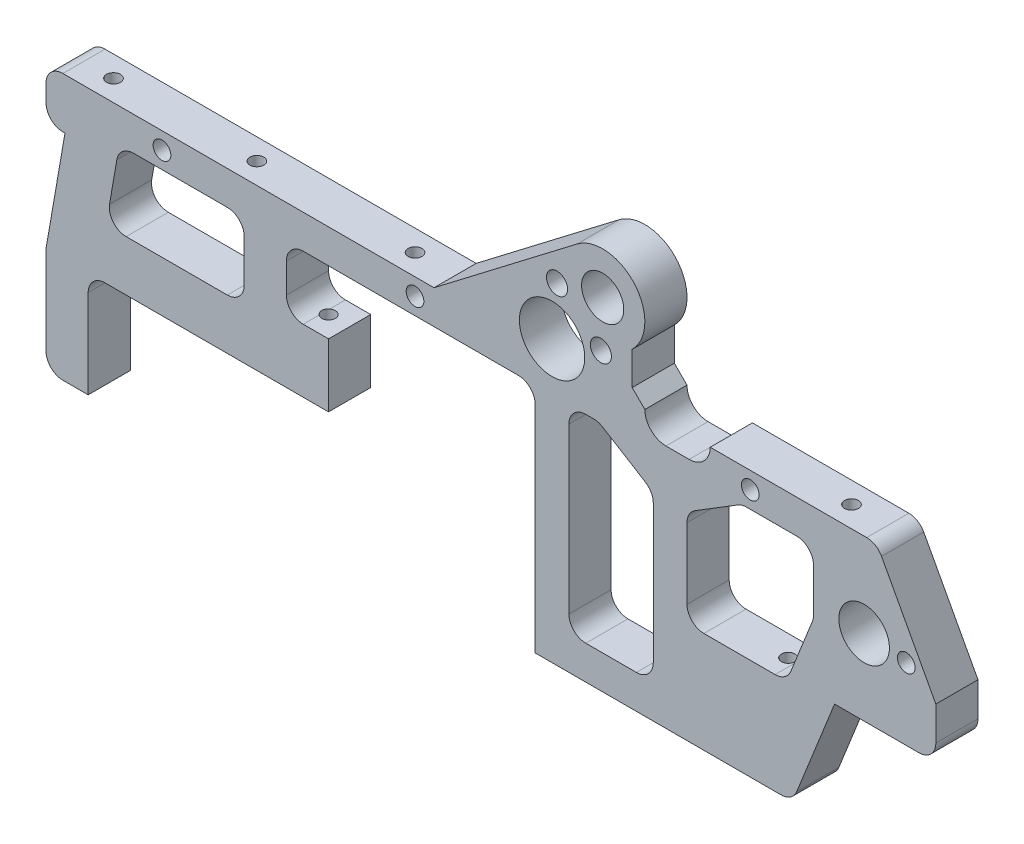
ISO-10303-21;
HEADER;
FILE_DESCRIPTION(('STEP AP214'),'2;1');
FILE_NAME('part.step','',(''),(''),'','','');
FILE_SCHEMA(('AUTOMOTIVE_DESIGN { 1 0 10303 214 1 1 1 1 }'));
ENDSEC;
DATA;
#1=APPLICATION_CONTEXT('core data for automotive mechanical design processes');
#2=APPLICATION_PROTOCOL_DEFINITION('international standard','automotive_design',2000,#1);
#3=PRODUCT_CONTEXT('',#1,'mechanical');
#4=PRODUCT('Part','Part','',(#3));
#5=PRODUCT_RELATED_PRODUCT_CATEGORY('part','',(#4));
#6=PRODUCT_DEFINITION_FORMATION('','',#4);
#7=PRODUCT_DEFINITION_CONTEXT('part definition',#1,'design');
#8=PRODUCT_DEFINITION('design','',#6,#7);
#9=PRODUCT_DEFINITION_SHAPE('','',#8);
#10=(LENGTH_UNIT() NAMED_UNIT(*) SI_UNIT(.MILLI.,.METRE.));
#11=(NAMED_UNIT(*) PLANE_ANGLE_UNIT() SI_UNIT($,.RADIAN.));
#12=(NAMED_UNIT(*) SI_UNIT($,.STERADIAN.) SOLID_ANGLE_UNIT());
#13=UNCERTAINTY_MEASURE_WITH_UNIT(LENGTH_MEASURE(1.E-05),#10,'distance_accuracy_value','');
#14=(GEOMETRIC_REPRESENTATION_CONTEXT(3) GLOBAL_UNCERTAINTY_ASSIGNED_CONTEXT((#13)) GLOBAL_UNIT_ASSIGNED_CONTEXT((#10,
#11,#12)) REPRESENTATION_CONTEXT('',''));
#15=CARTESIAN_POINT('',(0.,0.,0.));
#16=DIRECTION('',(0.,0.,1.));
#17=DIRECTION('',(1.,0.,0.));
#18=AXIS2_PLACEMENT_3D('',#15,#16,#17);
#19=CARTESIAN_POINT('',(-55.,41.,-5.));
#20=DIRECTION('',(0.,-1.,0.));
#21=DIRECTION('',(0.,0.,-1.));
#22=AXIS2_PLACEMENT_3D('',#19,#20,#21);
#23=PLANE('',#22);
#24=CARTESIAN_POINT('',(-115.,41.,0.));
#25=DIRECTION('',(0.,-1.,0.));
#26=DIRECTION('',(0.,0.,-1.));
#27=AXIS2_PLACEMENT_3D('',#24,#25,#26);
#28=CIRCLE('',#27,1.6);
#29=CARTESIAN_POINT('',(-115.,41.,-1.6));
#30=VERTEX_POINT('',#29);
#31=EDGE_CURVE('E20',#30,#30,#28,.T.);
#32=ORIENTED_EDGE('',*,*,#31,.T.);
#33=EDGE_LOOP('',(#32));
#34=FACE_BOUND('',#33,.T.);
#35=ADVANCED_FACE('F16',(#34),#23,.T.);
#36=CARTESIAN_POINT('',(-55.,40.,-5.));
#37=DIRECTION('',(0.,-1.,0.));
#38=DIRECTION('',(0.,0.,-1.));
#39=AXIS2_PLACEMENT_3D('',#36,#37,#38);
#40=PLANE('',#39);
#41=CARTESIAN_POINT('',(-111.,40.,0.));
#42=DIRECTION('',(0.,1.,0.));
#43=DIRECTION('',(0.,0.,1.));
#44=AXIS2_PLACEMENT_3D('',#41,#42,#43);
#45=CIRCLE('',#44,1.65);
#46=CARTESIAN_POINT('',(-111.,40.,1.65));
#47=VERTEX_POINT('',#46);
#48=EDGE_CURVE('E951',#47,#47,#45,.T.);
#49=ORIENTED_EDGE('',*,*,#48,.T.);
#50=EDGE_LOOP('',(#49));
#51=FACE_BOUND('',#50,.T.);
#52=ADVANCED_FACE('F1328',(#51),#40,.F.);
#53=CARTESIAN_POINT('',(-55.,40.,-5.));
#54=DIRECTION('',(0.,-1.,0.));
#55=DIRECTION('',(0.,0.,-1.));
#56=AXIS2_PLACEMENT_3D('',#53,#54,#55);
#57=PLANE('',#56);
#58=CARTESIAN_POINT('',(64.,40.,0.));
#59=DIRECTION('',(0.,1.,0.));
#60=DIRECTION('',(0.,0.,1.));
#61=AXIS2_PLACEMENT_3D('',#58,#59,#60);
#62=CIRCLE('',#61,1.65);
#63=CARTESIAN_POINT('',(64.,40.,1.65));
#64=VERTEX_POINT('',#63);
#65=EDGE_CURVE('E1323',#64,#64,#62,.T.);
#66=ORIENTED_EDGE('',*,*,#65,.T.);
#67=EDGE_LOOP('',(#66));
#68=FACE_BOUND('',#67,.T.);
#69=ADVANCED_FACE('F1647',(#68),#57,.F.);
#70=CARTESIAN_POINT('',(-55.,41.,-5.));
#71=DIRECTION('',(0.,-1.,0.));
#72=DIRECTION('',(0.,0.,-1.));
#73=AXIS2_PLACEMENT_3D('',#70,#71,#72);
#74=PLANE('',#73);
#75=CARTESIAN_POINT('',(0.,41.,0.));
#76=DIRECTION('',(0.,-1.,0.));
#77=DIRECTION('',(0.,0.,-1.));
#78=AXIS2_PLACEMENT_3D('',#75,#76,#77);
#79=CIRCLE('',#78,1.6);
#80=CARTESIAN_POINT('',(0.,41.,-1.6));
#81=VERTEX_POINT('',#80);
#82=EDGE_CURVE('E418',#81,#81,#79,.T.);
#83=ORIENTED_EDGE('',*,*,#82,.T.);
#84=EDGE_LOOP('',(#83));
#85=FACE_BOUND('',#84,.T.);
#86=ADVANCED_FACE('F1638',(#85),#74,.T.);
#87=CARTESIAN_POINT('',(-115.,46.52548339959,0.));
#88=DIRECTION('',(0.,-1.,0.));
#89=DIRECTION('',(0.,0.,-1.));
#90=AXIS2_PLACEMENT_3D('',#87,#88,#89);
#91=CYLINDRICAL_SURFACE('',#90,1.6);
#92=CARTESIAN_POINT('',(-115.,0.,0.));
#93=DIRECTION('',(0.,-1.,0.));
#94=DIRECTION('',(0.,0.,-1.));
#95=AXIS2_PLACEMENT_3D('',#92,#93,#94);
#96=CIRCLE('',#95,1.6);
#97=CARTESIAN_POINT('',(-115.,0.,-1.6));
#98=VERTEX_POINT('',#97);
#99=EDGE_CURVE('E965',#98,#98,#96,.T.);
#100=ORIENTED_EDGE('',*,*,#99,.T.);
#101=EDGE_LOOP('',(#100));
#102=FACE_BOUND('',#101,.T.);
#103=ORIENTED_EDGE('',*,*,#31,.F.);
#104=EDGE_LOOP('',(#103));
#105=FACE_BOUND('',#104,.T.);
#106=ADVANCED_FACE('F1343',(#102,#105),#91,.F.);
#107=CARTESIAN_POINT('',(-118.,51.,5.));
#108=DIRECTION('',(0.,1.,0.));
#109=DIRECTION('',(0.,0.,1.));
#110=AXIS2_PLACEMENT_3D('',#107,#108,#109);
#111=PLANE('',#110);
#112=DIRECTION('',(-1.,0.,0.));
#113=VECTOR('',#112,1.);
#114=CARTESIAN_POINT('',(-118.,51.,-5.));
#115=LINE('',#114,#113);
#116=CARTESIAN_POINT('',(-117.5,51.,-5.));
#117=VERTEX_POINT('',#116);
#118=CARTESIAN_POINT('',(-118.,51.,-5.));
#119=VERTEX_POINT('',#118);
#120=EDGE_CURVE('E1314',#117,#119,#115,.T.);
#121=ORIENTED_EDGE('',*,*,#120,.F.);
#122=DIRECTION('',(0.,0.,1.));
#123=VECTOR('',#122,1.);
#124=CARTESIAN_POINT('',(-117.5,51.,5.));
#125=LINE('',#124,#123);
#126=CARTESIAN_POINT('',(-117.5,51.,5.));
#127=VERTEX_POINT('',#126);
#128=EDGE_CURVE('E960',#117,#127,#125,.T.);
#129=ORIENTED_EDGE('',*,*,#128,.T.);
#130=DIRECTION('',(1.,0.,0.));
#131=VECTOR('',#130,1.);
#132=CARTESIAN_POINT('',(-118.,51.,5.));
#133=LINE('',#132,#131);
#134=CARTESIAN_POINT('',(-118.,51.,5.));
#135=VERTEX_POINT('',#134);
#136=EDGE_CURVE('E948',#135,#127,#133,.T.);
#137=ORIENTED_EDGE('',*,*,#136,.F.);
#138=DIRECTION('',(0.,0.,-1.));
#139=VECTOR('',#138,1.);
#140=CARTESIAN_POINT('',(-118.,51.,5.));
#141=LINE('',#140,#139);
#142=EDGE_CURVE('E838',#119,#135,#141,.F.);
#143=ORIENTED_EDGE('',*,*,#142,.F.);
#144=EDGE_LOOP('',(#121,#129,#137,#143));
#145=FACE_BOUND('',#144,.T.);
#146=ADVANCED_FACE('F1333',(#145),#111,.F.);
#147=CARTESIAN_POINT('',(-111.,35.33309524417,0.));
#148=DIRECTION('',(0.,1.,0.));
#149=DIRECTION('',(0.,0.,1.));
#150=AXIS2_PLACEMENT_3D('',#147,#148,#149);
#151=CYLINDRICAL_SURFACE('',#150,1.65);
#152=CARTESIAN_POINT('',(-111.,63.,0.));
#153=DIRECTION('',(0.,1.,0.));
#154=DIRECTION('',(0.,0.,1.));
#155=AXIS2_PLACEMENT_3D('',#152,#153,#154);
#156=CIRCLE('',#155,1.65);
#157=CARTESIAN_POINT('',(-111.,63.,1.65));
#158=VERTEX_POINT('',#157);
#159=EDGE_CURVE('E824',#158,#158,#156,.T.);
#160=ORIENTED_EDGE('',*,*,#159,.T.);
#161=EDGE_LOOP('',(#160));
#162=FACE_BOUND('',#161,.T.);
#163=ORIENTED_EDGE('',*,*,#48,.F.);
#164=EDGE_LOOP('',(#163));
#165=FACE_BOUND('',#164,.T.);
#166=ADVANCED_FACE('F1330',(#162,#165),#151,.F.);
#167=CARTESIAN_POINT('',(64.,35.33309524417,0.));
#168=DIRECTION('',(0.,1.,0.));
#169=DIRECTION('',(0.,0.,1.));
#170=AXIS2_PLACEMENT_3D('',#167,#168,#169);
#171=CYLINDRICAL_SURFACE('',#170,1.65);
#172=CARTESIAN_POINT('',(64.,63.,0.));
#173=DIRECTION('',(0.,1.,0.));
#174=DIRECTION('',(0.,0.,1.));
#175=AXIS2_PLACEMENT_3D('',#172,#173,#174);
#176=CIRCLE('',#175,1.65);
#177=CARTESIAN_POINT('',(64.,63.,1.65));
#178=VERTEX_POINT('',#177);
#179=EDGE_CURVE('E928',#178,#178,#176,.T.);
#180=ORIENTED_EDGE('',*,*,#179,.T.);
#181=EDGE_LOOP('',(#180));
#182=FACE_BOUND('',#181,.T.);
#183=ORIENTED_EDGE('',*,*,#65,.F.);
#184=EDGE_LOOP('',(#183));
#185=FACE_BOUND('',#184,.T.);
#186=ADVANCED_FACE('F1332',(#182,#185),#171,.F.);
#187=CARTESIAN_POINT('',(0.,46.52548339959,0.));
#188=DIRECTION('',(0.,-1.,0.));
#189=DIRECTION('',(0.,0.,-1.));
#190=AXIS2_PLACEMENT_3D('',#187,#188,#189);
#191=CYLINDRICAL_SURFACE('',#190,1.6);
#192=CARTESIAN_POINT('',(0.,0.,0.));
#193=DIRECTION('',(0.,-1.,0.));
#194=DIRECTION('',(0.,0.,-1.));
#195=AXIS2_PLACEMENT_3D('',#192,#193,#194);
#196=CIRCLE('',#195,1.6);
#197=CARTESIAN_POINT('',(0.,0.,-1.6));
#198=VERTEX_POINT('',#197);
#199=EDGE_CURVE('E753',#198,#198,#196,.T.);
#200=ORIENTED_EDGE('',*,*,#199,.T.);
#201=EDGE_LOOP('',(#200));
#202=FACE_BOUND('',#201,.T.);
#203=ORIENTED_EDGE('',*,*,#82,.F.);
#204=EDGE_LOOP('',(#203));
#205=FACE_BOUND('',#204,.T.);
#206=ADVANCED_FACE('F1340',(#202,#205),#191,.F.);
#207=CARTESIAN_POINT('',(-39.5,35.33309524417,0.));
#208=DIRECTION('',(0.,1.,0.));
#209=DIRECTION('',(0.,0.,1.));
#210=AXIS2_PLACEMENT_3D('',#207,#208,#209);
#211=CYLINDRICAL_SURFACE('',#210,1.65);
#212=CARTESIAN_POINT('',(-39.5,63.,0.));
#213=DIRECTION('',(0.,1.,0.));
#214=DIRECTION('',(0.,0.,1.));
#215=AXIS2_PLACEMENT_3D('',#212,#213,#214);
#216=CIRCLE('',#215,1.65);
#217=CARTESIAN_POINT('',(-39.5,63.,1.65));
#218=VERTEX_POINT('',#217);
#219=EDGE_CURVE('E943',#218,#218,#216,.T.);
#220=ORIENTED_EDGE('',*,*,#219,.T.);
#221=EDGE_LOOP('',(#220));
#222=FACE_BOUND('',#221,.T.);
#223=CARTESIAN_POINT('',(-39.5,55.,0.));
#224=DIRECTION('',(0.,1.,0.));
#225=DIRECTION('',(0.,0.,1.));
#226=AXIS2_PLACEMENT_3D('',#223,#224,#225);
#227=CIRCLE('',#226,1.65);
#228=CARTESIAN_POINT('',(-39.5,55.,1.65));
#229=VERTEX_POINT('',#228);
#230=EDGE_CURVE('E740',#229,#229,#227,.F.);
#231=ORIENTED_EDGE('',*,*,#230,.T.);
#232=EDGE_LOOP('',(#231));
#233=FACE_BOUND('',#232,.T.);
#234=ADVANCED_FACE('F1351',(#222,#233),#211,.F.);
#235=CARTESIAN_POINT('',(-60.,46.52548339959,0.));
#236=DIRECTION('',(0.,-1.,0.));
#237=DIRECTION('',(0.,0.,-1.));
#238=AXIS2_PLACEMENT_3D('',#235,#236,#237);
#239=CYLINDRICAL_SURFACE('',#238,1.6);
#240=CARTESIAN_POINT('',(-60.,25.,0.));
#241=DIRECTION('',(0.,-1.,0.));
#242=DIRECTION('',(0.,0.,-1.));
#243=AXIS2_PLACEMENT_3D('',#240,#241,#242);
#244=CIRCLE('',#243,1.6);
#245=CARTESIAN_POINT('',(-60.,25.,-1.6));
#246=VERTEX_POINT('',#245);
#247=EDGE_CURVE('E709',#246,#246,#244,.T.);
#248=ORIENTED_EDGE('',*,*,#247,.T.);
#249=EDGE_LOOP('',(#248));
#250=FACE_BOUND('',#249,.T.);
#251=CARTESIAN_POINT('',(-60.9999999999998,40.,-1.2489995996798));
#252=CARTESIAN_POINT('',(-61.0350151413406,39.9999992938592,-1.22096532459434));
#253=CARTESIAN_POINT('',(-61.0688309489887,40.0004598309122,-1.19147304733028));
#254=CARTESIAN_POINT('',(-61.1338543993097,40.002108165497,-1.12977171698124));
#255=CARTESIAN_POINT('',(-61.1650625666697,40.0032958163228,-1.09756321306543));
#256=CARTESIAN_POINT('',(-61.2543821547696,40.0076521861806,-0.99725631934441));
#257=CARTESIAN_POINT('',(-61.3083072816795,40.0116156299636,-0.92538134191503));
#258=CARTESIAN_POINT('',(-61.4033539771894,40.0201011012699,-0.773704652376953));
#259=CARTESIAN_POINT('',(-61.4444761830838,40.0246231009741,-0.69390333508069));
#260=CARTESIAN_POINT('',(-61.5128337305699,40.0328610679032,-0.528519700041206));
#261=CARTESIAN_POINT('',(-61.5400714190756,40.0365771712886,-0.442938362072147));
#262=CARTESIAN_POINT('',(-61.579974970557,40.0422173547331,-0.267913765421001));
#263=CARTESIAN_POINT('',(-61.5925645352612,40.0441320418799,-0.178452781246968));
#264=CARTESIAN_POINT('',(-61.6025300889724,40.0456373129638,0.00133603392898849));
#265=CARTESIAN_POINT('',(-61.5999059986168,40.0452278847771,0.0916638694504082));
#266=CARTESIAN_POINT('',(-61.5796396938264,40.0422079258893,0.26957027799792));
#267=CARTESIAN_POINT('',(-61.5621621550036,40.0396215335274,0.357168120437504));
#268=CARTESIAN_POINT('',(-61.5129119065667,40.0329440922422,0.528224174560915));
#269=CARTESIAN_POINT('',(-61.4811334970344,40.0288524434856,0.611680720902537));
#270=CARTESIAN_POINT('',(-61.4039076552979,40.020254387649,0.772710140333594));
#271=CARTESIAN_POINT('',(-61.3583634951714,40.015745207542,0.850236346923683));
#272=CARTESIAN_POINT('',(-61.254950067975,40.0077990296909,0.996542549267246));
#273=CARTESIAN_POINT('',(-61.1971009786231,40.0043602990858,1.06533657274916));
#274=CARTESIAN_POINT('',(-61.1127795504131,40.0015338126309,1.1500562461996));
#275=CARTESIAN_POINT('',(-61.0909899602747,40.000972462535,1.17074576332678));
#276=CARTESIAN_POINT('',(-61.0463113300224,40.000205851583,1.21083841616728));
#277=CARTESIAN_POINT('',(-61.0234239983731,40.0000000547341,1.23024344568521));
#278=CARTESIAN_POINT('',(-60.9999999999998,40.,1.2489995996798));
#279=B_SPLINE_CURVE_WITH_KNOTS('',3,(#251,#252,#253,#254,#255,#256,#257,#258,#259,#260,#261,
#262,#263,#264,#265,#266,#267,#268,#269,#270,#271,#272,#273,#274,#275,#276,#277,#278),
.UNSPECIFIED.,.F.,.F.,(4,2,2,2,2,2,2,2,2,2,2,2,2,4),(0.,0.13447577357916,0.268924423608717,
0.537371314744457,0.805804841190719,1.07419297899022,1.34397290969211,1.6137542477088,
1.88058304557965,2.14751828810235,2.4163746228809,2.68479343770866,2.77491438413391,
2.86489935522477),.UNSPECIFIED.);
#280=CARTESIAN_POINT('',(-60.9999999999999,40.,-1.24899959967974));
#281=VERTEX_POINT('',#280);
#282=CARTESIAN_POINT('',(-60.9999999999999,40.,1.24899959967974));
#283=VERTEX_POINT('',#282);
#284=EDGE_CURVE('E731',#281,#283,#279,.T.);
#285=ORIENTED_EDGE('',*,*,#284,.T.);
#286=CARTESIAN_POINT('',(-60.,40.,0.));
#287=DIRECTION('',(0.,-1.,0.));
#288=DIRECTION('',(0.,0.,-1.));
#289=AXIS2_PLACEMENT_3D('',#286,#287,#288);
#290=CIRCLE('',#289,1.6);
#291=EDGE_CURVE('E1161',#283,#281,#290,.F.);
#292=ORIENTED_EDGE('',*,*,#291,.T.);
#293=EDGE_LOOP('',(#285,#292));
#294=FACE_BOUND('',#293,.T.);
#295=ADVANCED_FACE('F1354',(#250,#294),#239,.F.);
#296=CARTESIAN_POINT('',(-77.,35.33309524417,0.));
#297=DIRECTION('',(0.,1.,0.));
#298=DIRECTION('',(0.,0.,1.));
#299=AXIS2_PLACEMENT_3D('',#296,#297,#298);
#300=CYLINDRICAL_SURFACE('',#299,1.65);
#301=CARTESIAN_POINT('',(-77.,63.,0.));
#302=DIRECTION('',(0.,1.,0.));
#303=DIRECTION('',(0.,0.,1.));
#304=AXIS2_PLACEMENT_3D('',#301,#302,#303);
#305=CIRCLE('',#304,1.65);
#306=CARTESIAN_POINT('',(-77.,63.,1.65));
#307=VERTEX_POINT('',#306);
#308=EDGE_CURVE('E1626',#307,#307,#305,.T.);
#309=ORIENTED_EDGE('',*,*,#308,.T.);
#310=EDGE_LOOP('',(#309));
#311=FACE_BOUND('',#310,.T.);
#312=CARTESIAN_POINT('',(-77.000000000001,54.4641016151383,-1.65));
#313=CARTESIAN_POINT('',(-76.9390279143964,54.4288989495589,-1.65000027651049));
#314=CARTESIAN_POINT('',(-76.8789908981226,54.3920817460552,-1.6466177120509));
#315=CARTESIAN_POINT('',(-76.761388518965,54.3156532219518,-1.63372877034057));
#316=CARTESIAN_POINT('',(-76.7038251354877,54.2760397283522,-1.62421758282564));
#317=CARTESIAN_POINT('',(-76.535157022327,54.1533845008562,-1.58735263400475));
#318=CARTESIAN_POINT('',(-76.4283876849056,54.0667103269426,-1.55167370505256));
#319=CARTESIAN_POINT('',(-76.2718901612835,53.926305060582,-1.48196189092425));
#320=CARTESIAN_POINT('',(-76.2174737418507,53.8745511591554,-1.45389948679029));
#321=CARTESIAN_POINT('',(-76.1130463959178,53.7696492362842,-1.39264877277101));
#322=CARTESIAN_POINT('',(-76.0630340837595,53.7165016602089,-1.35946208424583));
#323=CARTESIAN_POINT('',(-75.9674334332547,53.6093486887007,-1.2883562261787));
#324=CARTESIAN_POINT('',(-75.9218477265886,53.5553428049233,-1.25043427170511));
#325=CARTESIAN_POINT('',(-75.8351524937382,53.4471519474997,-1.17009294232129));
#326=CARTESIAN_POINT('',(-75.7940415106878,53.3929670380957,-1.12767504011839));
#327=CARTESIAN_POINT('',(-75.69846907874,53.2603622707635,-1.01784412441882));
#328=CARTESIAN_POINT('',(-75.6465040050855,53.1821955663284,-0.947873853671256));
#329=CARTESIAN_POINT('',(-75.5761171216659,53.0685801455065,-0.834869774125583));
#330=CARTESIAN_POINT('',(-75.5539363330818,53.0313552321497,-0.795910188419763));
#331=CARTESIAN_POINT('',(-75.5122177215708,52.9588553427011,-0.714900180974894));
#332=CARTESIAN_POINT('',(-75.4926779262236,52.9235789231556,-0.672852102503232));
#333=CARTESIAN_POINT('',(-75.4576519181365,52.8582402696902,-0.587909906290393));
#334=CARTESIAN_POINT('',(-75.4419877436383,52.8279894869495,-0.545236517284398));
#335=CARTESIAN_POINT('',(-75.4136313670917,52.7717079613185,-0.456196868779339));
#336=CARTESIAN_POINT('',(-75.4009380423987,52.7456756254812,-0.409832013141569));
#337=CARTESIAN_POINT('',(-75.3810862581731,52.7040843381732,-0.321404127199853));
#338=CARTESIAN_POINT('',(-75.3733517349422,52.6874946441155,-0.279968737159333));
#339=CARTESIAN_POINT('',(-75.3609617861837,52.6606092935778,-0.194680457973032));
#340=CARTESIAN_POINT('',(-75.3562994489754,52.6502995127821,-0.150833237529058));
#341=CARTESIAN_POINT('',(-75.3505208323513,52.6374854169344,-0.0612219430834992));
#342=CARTESIAN_POINT('',(-75.3494441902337,52.6350683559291,-0.0154420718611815));
#343=CARTESIAN_POINT('',(-75.3511060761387,52.6387724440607,0.0757036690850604));
#344=CARTESIAN_POINT('',(-75.3538469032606,52.6448987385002,0.121069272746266));
#345=CARTESIAN_POINT('',(-75.3631774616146,52.6654283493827,0.213726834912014));
#346=CARTESIAN_POINT('',(-75.3700913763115,52.6805269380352,0.260824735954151));
#347=CARTESIAN_POINT('',(-75.387273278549,52.7171536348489,0.35180571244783));
#348=CARTESIAN_POINT('',(-75.3975501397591,52.7386987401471,0.395679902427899));
#349=CARTESIAN_POINT('',(-75.4296704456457,52.8041259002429,0.512398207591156));
#350=CARTESIAN_POINT('',(-75.454363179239,52.8525257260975,0.581867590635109));
#351=CARTESIAN_POINT('',(-75.5102450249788,52.9557892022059,0.712889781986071));
#352=CARTESIAN_POINT('',(-75.5414546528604,53.0106730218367,0.774416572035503));
#353=CARTESIAN_POINT('',(-75.6066976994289,53.1187596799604,0.886005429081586));
#354=CARTESIAN_POINT('',(-75.6402601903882,53.1717037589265,0.936598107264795));
#355=CARTESIAN_POINT('',(-75.7119888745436,53.2788476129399,1.03302494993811));
#356=CARTESIAN_POINT('',(-75.7501582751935,53.3330482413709,1.07885575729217));
#357=CARTESIAN_POINT('',(-75.8310702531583,53.4418206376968,1.16603723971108));
#358=CARTESIAN_POINT('',(-75.8738198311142,53.4963928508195,1.20738085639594));
#359=CARTESIAN_POINT('',(-75.963826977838,53.6051170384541,1.28545461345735));
#360=CARTESIAN_POINT('',(-76.0110843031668,53.659269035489,1.32218500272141));
#361=CARTESIAN_POINT('',(-76.1113502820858,53.7679059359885,1.39162235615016));
#362=CARTESIAN_POINT('',(-76.1644737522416,53.8223649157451,1.42420479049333));
#363=CARTESIAN_POINT('',(-76.2754268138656,53.9296168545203,1.48373086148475));
#364=CARTESIAN_POINT('',(-76.3332580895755,53.9824092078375,1.51067246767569));
#365=CARTESIAN_POINT('',(-76.4531329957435,54.0853978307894,1.55806563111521));
#366=CARTESIAN_POINT('',(-76.5151525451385,54.1356064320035,1.57855099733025));
#367=CARTESIAN_POINT('',(-76.6433016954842,54.2330225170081,1.61234241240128));
#368=CARTESIAN_POINT('',(-76.7094262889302,54.28023352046,1.62565702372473));
#369=CARTESIAN_POINT('',(-76.8134927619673,54.3497886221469,1.63983183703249));
#370=CARTESIAN_POINT('',(-76.8501762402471,54.373450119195,1.64360447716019));
#371=CARTESIAN_POINT('',(-76.9244452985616,54.419647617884,1.64869024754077));
#372=CARTESIAN_POINT('',(-76.9620315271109,54.4421827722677,1.65000155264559));
#373=CARTESIAN_POINT('',(-77.0837361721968,54.5124417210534,1.64999657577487));
#374=CARTESIAN_POINT('',(-77.1693315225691,54.5577841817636,1.6436076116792));
#375=CARTESIAN_POINT('',(-77.3418327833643,54.6413842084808,1.61656279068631));
#376=CARTESIAN_POINT('',(-77.4287396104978,54.6796365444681,1.59589645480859));
#377=CARTESIAN_POINT('',(-77.6011031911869,54.7485642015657,1.53929474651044));
#378=CARTESIAN_POINT('',(-77.6865522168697,54.7792066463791,1.503294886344));
#379=CARTESIAN_POINT('',(-77.8519609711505,54.8326973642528,1.41611895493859));
#380=CARTESIAN_POINT('',(-77.9319229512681,54.8555488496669,1.36494915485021));
#381=CARTESIAN_POINT('',(-78.0773373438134,54.8928048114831,1.25285904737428));
#382=CARTESIAN_POINT('',(-78.1434221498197,54.9077029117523,1.19291906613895));
#383=CARTESIAN_POINT('',(-78.2654525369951,54.9324705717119,1.06259035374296));
#384=CARTESIAN_POINT('',(-78.321397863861,54.9423400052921,0.992201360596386));
#385=CARTESIAN_POINT('',(-78.420831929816,54.9581672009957,0.843602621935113));
#386=CARTESIAN_POINT('',(-78.4644210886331,54.9641570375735,0.765463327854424));
#387=CARTESIAN_POINT('',(-78.5384445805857,54.9734574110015,0.603038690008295));
#388=CARTESIAN_POINT('',(-78.5688779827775,54.9767677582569,0.518752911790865));
#389=CARTESIAN_POINT('',(-78.6162463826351,54.9816226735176,0.344373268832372));
#390=CARTESIAN_POINT('',(-78.6328616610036,54.9831257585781,0.254191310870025));
#391=CARTESIAN_POINT('',(-78.65094702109,54.9847516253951,0.0723060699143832));
#392=CARTESIAN_POINT('',(-78.652415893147,54.9848742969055,-0.0193973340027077));
#393=CARTESIAN_POINT('',(-78.6401004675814,54.98378097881,-0.202721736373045));
#394=CARTESIAN_POINT('',(-78.6261586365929,54.9825511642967,-0.29433212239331));
#395=CARTESIAN_POINT('',(-78.5831741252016,54.9782807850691,-0.473901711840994));
#396=CARTESIAN_POINT('',(-78.5541308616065,54.9752401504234,-0.561860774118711));
#397=CARTESIAN_POINT('',(-78.4818796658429,54.9664677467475,-0.731445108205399));
#398=CARTESIAN_POINT('',(-78.4386954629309,54.9607404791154,-0.813080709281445));
#399=CARTESIAN_POINT('',(-78.3395375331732,54.9454144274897,-0.967767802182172));
#400=CARTESIAN_POINT('',(-78.283566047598,54.9358163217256,-1.04082079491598));
#401=CARTESIAN_POINT('',(-78.1617858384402,54.91167185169,-1.17508903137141));
#402=CARTESIAN_POINT('',(-78.0961509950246,54.8972080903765,-1.23647673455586));
#403=CARTESIAN_POINT('',(-77.9568185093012,54.8622424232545,-1.34718659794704));
#404=CARTESIAN_POINT('',(-77.8831220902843,54.8417414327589,-1.39651058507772));
#405=CARTESIAN_POINT('',(-77.7319799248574,54.7945052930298,-1.48123994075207));
#406=CARTESIAN_POINT('',(-77.6546335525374,54.7678976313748,-1.51689476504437));
#407=CARTESIAN_POINT('',(-77.4977127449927,54.7081219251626,-1.57536945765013));
#408=CARTESIAN_POINT('',(-77.4181392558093,54.6749566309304,-1.59819469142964));
#409=CARTESIAN_POINT('',(-77.2816189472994,54.6126347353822,-1.62683990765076));
#410=CARTESIAN_POINT('',(-77.2245855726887,54.5849627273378,-1.6356338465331));
#411=CARTESIAN_POINT('',(-77.1114448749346,54.5266704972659,-1.64721301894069));
#412=CARTESIAN_POINT('',(-77.0553373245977,54.4960510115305,-1.64999974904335));
#413=CARTESIAN_POINT('',(-77.000000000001,54.4641016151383,-1.65));
#414=B_SPLINE_CURVE_WITH_KNOTS('',3,(#312,#313,#314,#315,#316,#317,#318,#319,#320,#321,#322,
#323,#324,#325,#326,#327,#328,#329,#330,#331,#332,#333,#334,#335,#336,#337,#338,#339,#340,#341,
#342,#343,#344,#345,#346,#347,#348,#349,#350,#351,#352,#353,#354,#355,#356,#357,#358,#359,#360,
#361,#362,#363,#364,#365,#366,#367,#368,#369,#370,#371,#372,#373,#374,#375,#376,#377,#378,#379,
#380,#381,#382,#383,#384,#385,#386,#387,#388,#389,#390,#391,#392,#393,#394,#395,#396,#397,#398,
#399,#400,#401,#402,#403,#404,#405,#406,#407,#408,#409,#410,#411,#412,#413),.UNSPECIFIED.,.T.,
.F.,(4,2,2,2,2,2,2,2,2,2,2,2,2,2,2,2,2,2,2,2,2,2,2,2,2,2,2,2,2,2,2,2,2,2,2,2,2,2,2,2,2,2,2,2,2,
2,2,2,2,2,4),(0.,0.211111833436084,0.422389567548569,0.846014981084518,1.08630023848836,
1.32650962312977,1.56686095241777,1.80713379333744,2.1573257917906,2.33201659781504,
2.50657620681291,2.67012324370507,2.833608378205,2.96903174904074,3.10414940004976,
3.2407558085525,3.37744452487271,3.52643452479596,3.67582087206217,3.93893913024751,
4.20289854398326,4.44424600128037,4.68576247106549,4.92765350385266,5.16953148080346,
5.41749713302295,5.66555188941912,5.91228521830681,6.15872327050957,6.29008442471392,
6.42154294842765,6.71146331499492,7.00159669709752,7.29296252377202,7.5842080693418,
7.85426283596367,8.12432437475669,8.39212368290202,8.65994193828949,8.93379688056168,
9.20767369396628,9.48437627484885,9.76108954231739,10.0373408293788,10.3135437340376,
10.5852762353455,10.8569675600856,11.1234333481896,11.3897876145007,11.5814372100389,
11.7730390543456),.UNSPECIFIED.);
#415=CARTESIAN_POINT('',(-77.000000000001,54.4641016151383,-1.65));
#416=VERTEX_POINT('',#415);
#417=EDGE_CURVE('E676',#416,#416,#414,.T.);
#418=ORIENTED_EDGE('',*,*,#417,.T.);
#419=EDGE_LOOP('',(#418));
#420=FACE_BOUND('',#419,.T.);
#421=ADVANCED_FACE('F1228',(#311,#420),#300,.F.);
#422=CARTESIAN_POINT('',(49.,46.52548339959,0.));
#423=DIRECTION('',(0.,-1.,0.));
#424=DIRECTION('',(0.,0.,-1.));
#425=AXIS2_PLACEMENT_3D('',#422,#423,#424);
#426=CYLINDRICAL_SURFACE('',#425,1.6);
#427=CARTESIAN_POINT('',(49.,0.,0.));
#428=DIRECTION('',(0.,-1.,0.));
#429=DIRECTION('',(0.,0.,-1.));
#430=AXIS2_PLACEMENT_3D('',#427,#428,#429);
#431=CIRCLE('',#430,1.6);
#432=CARTESIAN_POINT('',(49.,0.,-1.6));
#433=VERTEX_POINT('',#432);
#434=EDGE_CURVE('E759',#433,#433,#431,.T.);
#435=ORIENTED_EDGE('',*,*,#434,.T.);
#436=EDGE_LOOP('',(#435));
#437=FACE_BOUND('',#436,.T.);
#438=CARTESIAN_POINT('',(49.,24.,0.));
#439=DIRECTION('',(0.,-1.,0.));
#440=DIRECTION('',(0.,0.,-1.));
#441=AXIS2_PLACEMENT_3D('',#438,#439,#440);
#442=CIRCLE('',#441,1.6);
#443=CARTESIAN_POINT('',(49.,24.,-1.6));
#444=VERTEX_POINT('',#443);
#445=EDGE_CURVE('E615',#444,#444,#442,.F.);
#446=ORIENTED_EDGE('',*,*,#445,.T.);
#447=EDGE_LOOP('',(#446));
#448=FACE_BOUND('',#447,.T.);
#449=ADVANCED_FACE('F1699',(#437,#448),#426,.F.);
#450=CARTESIAN_POINT('',(56.,40.77032961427,-5.));
#451=DIRECTION('',(0.,0.,1.));
#452=DIRECTION('',(1.,0.,0.));
#453=AXIS2_PLACEMENT_3D('',#450,#451,#452);
#454=CYLINDRICAL_SURFACE('',#453,4.);
#455=DIRECTION('',(0.,0.,-1.));
#456=VECTOR('',#455,1.);
#457=CARTESIAN_POINT('',(60.,40.77032961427,-5.));
#458=LINE('',#457,#456);
#459=CARTESIAN_POINT('',(60.,40.77032961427,5.));
#460=VERTEX_POINT('',#459);
#461=CARTESIAN_POINT('',(60.,40.77032961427,-5.));
#462=VERTEX_POINT('',#461);
#463=EDGE_CURVE('E427',#460,#462,#458,.T.);
#464=ORIENTED_EDGE('',*,*,#463,.T.);
#465=CARTESIAN_POINT('',(56.,40.77032961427,-5.));
#466=DIRECTION('',(0.,0.,1.));
#467=DIRECTION('',(1.,0.,0.));
#468=AXIS2_PLACEMENT_3D('',#465,#466,#467);
#469=CIRCLE('',#468,4.);
#470=CARTESIAN_POINT('',(59.7139067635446,39.2847669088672,-5.));
#471=VERTEX_POINT('',#470);
#472=EDGE_CURVE('E423',#471,#462,#469,.T.);
#473=ORIENTED_EDGE('',*,*,#472,.F.);
#474=DIRECTION('',(0.,0.,1.));
#475=VECTOR('',#474,1.);
#476=CARTESIAN_POINT('',(59.7139067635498,39.2847669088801,-5.));
#477=LINE('',#476,#475);
#478=CARTESIAN_POINT('',(59.7139067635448,39.2847669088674,5.));
#479=VERTEX_POINT('',#478);
#480=EDGE_CURVE('E421',#471,#479,#477,.T.);
#481=ORIENTED_EDGE('',*,*,#480,.T.);
#482=CARTESIAN_POINT('',(56.,40.77032961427,5.));
#483=DIRECTION('',(0.,0.,1.));
#484=DIRECTION('',(1.,0.,0.));
#485=AXIS2_PLACEMENT_3D('',#482,#483,#484);
#486=CIRCLE('',#485,4.);
#487=EDGE_CURVE('E403',#460,#479,#486,.F.);
#488=ORIENTED_EDGE('',*,*,#487,.F.);
#489=EDGE_LOOP('',(#464,#473,#481,#488));
#490=FACE_BOUND('',#489,.T.);
#491=ADVANCED_FACE('F422',(#490),#454,.F.);
#492=CARTESIAN_POINT('',(80.,46.52548339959,0.));
#493=DIRECTION('',(0.,-1.,0.));
#494=DIRECTION('',(0.,0.,-1.));
#495=AXIS2_PLACEMENT_3D('',#492,#493,#494);
#496=CYLINDRICAL_SURFACE('',#495,1.6);
#497=CARTESIAN_POINT('',(80.,25.,0.));
#498=DIRECTION('',(0.,-1.,0.));
#499=DIRECTION('',(0.,0.,-1.));
#500=AXIS2_PLACEMENT_3D('',#497,#498,#499);
#501=CIRCLE('',#500,1.6);
#502=CARTESIAN_POINT('',(80.,25.,-1.6));
#503=VERTEX_POINT('',#502);
#504=EDGE_CURVE('E768',#503,#503,#501,.T.);
#505=ORIENTED_EDGE('',*,*,#504,.T.);
#506=EDGE_LOOP('',(#505));
#507=FACE_BOUND('',#506,.T.);
#508=CARTESIAN_POINT('',(80.1533814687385,40.9999999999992,1.5926311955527));
#509=CARTESIAN_POINT('',(80.1762287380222,40.9577941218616,1.59042559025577));
#510=CARTESIAN_POINT('',(80.2005281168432,40.9163926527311,1.58759410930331));
#511=CARTESIAN_POINT('',(80.2518481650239,40.8354156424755,1.58026884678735));
#512=CARTESIAN_POINT('',(80.2788712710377,40.795841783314,1.57577356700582));
#513=CARTESIAN_POINT('',(80.3356182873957,40.7185357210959,1.56467267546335));
#514=CARTESIAN_POINT('',(80.3653603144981,40.6808189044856,1.55805203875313));
#515=CARTESIAN_POINT('',(80.4270666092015,40.6078207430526,1.54228013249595));
#516=CARTESIAN_POINT('',(80.4590302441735,40.5725387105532,1.53312958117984));
#517=CARTESIAN_POINT('',(80.5250496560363,40.5044104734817,1.51179846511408));
#518=CARTESIAN_POINT('',(80.5591195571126,40.4715849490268,1.49959527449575));
#519=CARTESIAN_POINT('',(80.6286139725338,40.4089347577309,1.47181669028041));
#520=CARTESIAN_POINT('',(80.6640382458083,40.3791095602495,1.45624189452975));
#521=CARTESIAN_POINT('',(80.7354792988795,40.322786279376,1.42149170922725));
#522=CARTESIAN_POINT('',(80.771492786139,40.296274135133,1.40233246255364));
#523=CARTESIAN_POINT('',(80.8435525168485,40.2465606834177,1.3602077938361));
#524=CARTESIAN_POINT('',(80.8795987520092,40.2233586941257,1.33724315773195));
#525=CARTESIAN_POINT('',(80.976194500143,40.1651012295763,1.26985278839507));
#526=CARTESIAN_POINT('',(81.0361244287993,40.1332039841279,1.22170207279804));
#527=CARTESIAN_POINT('',(81.1504224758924,40.0784734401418,1.11475093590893));
#528=CARTESIAN_POINT('',(81.2047841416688,40.0556505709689,1.05593837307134));
#529=CARTESIAN_POINT('',(81.3020348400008,40.0187387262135,0.933001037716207));
#530=CARTESIAN_POINT('',(81.3454077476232,40.0042183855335,0.869385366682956));
#531=CARTESIAN_POINT('',(81.4228420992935,39.9804620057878,0.735853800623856));
#532=CARTESIAN_POINT('',(81.4569045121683,39.9712254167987,0.665938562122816));
#533=CARTESIAN_POINT('',(81.5164013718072,39.9561951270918,0.51705572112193));
#534=CARTESIAN_POINT('',(81.5411667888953,39.9506515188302,0.437795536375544));
#535=CARTESIAN_POINT('',(81.5781527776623,39.9427194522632,0.276239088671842));
#536=CARTESIAN_POINT('',(81.5903691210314,39.9403320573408,0.193941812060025));
#537=CARTESIAN_POINT('',(81.6021985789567,39.9380112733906,0.0240718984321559));
#538=CARTESIAN_POINT('',(81.6011193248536,39.9382127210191,-0.0635515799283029));
#539=CARTESIAN_POINT('',(81.5846960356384,39.9414592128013,-0.237414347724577));
#540=CARTESIAN_POINT('',(81.569349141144,39.9445048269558,-0.323653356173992));
#541=CARTESIAN_POINT('',(81.5246681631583,39.9543739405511,-0.493082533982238));
#542=CARTESIAN_POINT('',(81.4952054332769,39.9612322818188,-0.576236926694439));
#543=CARTESIAN_POINT('',(81.4233258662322,39.9803905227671,-0.736079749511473));
#544=CARTESIAN_POINT('',(81.3809124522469,39.9926889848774,-0.812769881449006));
#545=CARTESIAN_POINT('',(81.286594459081,40.0242888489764,-0.954831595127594));
#546=CARTESIAN_POINT('',(81.2350426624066,40.0433499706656,-1.02048977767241));
#547=CARTESIAN_POINT('',(81.124309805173,40.0903500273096,-1.14132796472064));
#548=CARTESIAN_POINT('',(81.0651347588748,40.1182819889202,-1.19651614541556));
#549=CARTESIAN_POINT('',(80.9470590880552,40.1819002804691,-1.29167689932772));
#550=CARTESIAN_POINT('',(80.8884300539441,40.216905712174,-1.33244492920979));
#551=CARTESIAN_POINT('',(80.7709262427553,40.29577625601,-1.40370869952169));
#552=CARTESIAN_POINT('',(80.7120514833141,40.3396407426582,-1.43420516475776));
#553=CARTESIAN_POINT('',(80.5972070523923,40.4354700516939,-1.48569929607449));
#554=CARTESIAN_POINT('',(80.5412292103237,40.4874102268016,-1.5067251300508));
#555=CARTESIAN_POINT('',(80.4341970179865,40.5984941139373,-1.54098609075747));
#556=CARTESIAN_POINT('',(80.3831476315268,40.65764495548,-1.55421343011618));
#557=CARTESIAN_POINT('',(80.3014782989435,40.7638271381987,-1.57172410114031));
#558=CARTESIAN_POINT('',(80.2692297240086,40.809392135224,-1.57748914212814));
#559=CARTESIAN_POINT('',(80.208469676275,40.9029456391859,-1.58665424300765));
#560=CARTESIAN_POINT('',(80.1799452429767,40.9509248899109,-1.59006269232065));
#561=CARTESIAN_POINT('',(80.1533814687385,40.9999999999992,-1.5926311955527));
#562=B_SPLINE_CURVE_WITH_KNOTS('',3,(#508,#509,#510,#511,#512,#513,#514,#515,#516,#517,#518,
#519,#520,#521,#522,#523,#524,#525,#526,#527,#528,#529,#530,#531,#532,#533,#534,#535,#536,#537,
#538,#539,#540,#541,#542,#543,#544,#545,#546,#547,#548,#549,#550,#551,#552,#553,#554,#555,#556,
#557,#558,#559,#560,#561),.UNSPECIFIED.,.F.,.F.,(4,2,2,2,2,2,2,2,2,2,2,2,2,2,2,2,2,2,2,2,2,2,2,
2,2,2,4),(0.,0.144118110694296,0.288366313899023,0.433657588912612,0.578907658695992,
0.725267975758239,0.871602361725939,1.01729292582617,1.16295343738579,1.4111855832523,
1.65970220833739,1.89374048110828,2.12775439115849,2.37633466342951,2.62499866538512,
2.88666429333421,3.14838237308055,3.41253238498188,3.67661263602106,3.93212061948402,
4.18742824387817,4.42483751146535,4.66223002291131,4.89891173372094,5.13582939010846,
5.30397249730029,5.47151389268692),.UNSPECIFIED.);
#563=CARTESIAN_POINT('',(80.1533814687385,40.9999999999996,1.5926311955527));
#564=VERTEX_POINT('',#563);
#565=CARTESIAN_POINT('',(80.1533814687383,40.9999999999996,-1.59263119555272));
#566=VERTEX_POINT('',#565);
#567=EDGE_CURVE('E1058',#564,#566,#562,.T.);
#568=ORIENTED_EDGE('',*,*,#567,.T.);
#569=CARTESIAN_POINT('',(80.,41.,0.));
#570=DIRECTION('',(0.,-1.,0.));
#571=DIRECTION('',(0.,0.,-1.));
#572=AXIS2_PLACEMENT_3D('',#569,#570,#571);
#573=CIRCLE('',#572,1.6);
#574=EDGE_CURVE('E417',#564,#566,#573,.T.);
#575=ORIENTED_EDGE('',*,*,#574,.F.);
#576=EDGE_LOOP('',(#568,#575));
#577=FACE_BOUND('',#576,.T.);
#578=ADVANCED_FACE('F1068',(#507,#577),#496,.F.);
#579=CARTESIAN_POINT('',(-55.,41.,-5.));
#580=DIRECTION('',(0.,-1.,0.));
#581=DIRECTION('',(0.,0.,-1.));
#582=AXIS2_PLACEMENT_3D('',#579,#580,#581);
#583=PLANE('',#582);
#584=DIRECTION('',(0.,0.,1.));
#585=VECTOR('',#584,1.);
#586=CARTESIAN_POINT('',(80.1533814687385,40.9999999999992,-5.));
#587=LINE('',#586,#585);
#588=EDGE_CURVE('E1057',#566,#564,#587,.T.);
#589=ORIENTED_EDGE('',*,*,#588,.T.);
#590=ORIENTED_EDGE('',*,*,#574,.T.);
#591=EDGE_LOOP('',(#589,#590));
#592=FACE_BOUND('',#591,.T.);
#593=ADVANCED_FACE('F1099',(#592),#583,.T.);
#594=CARTESIAN_POINT('',(-118.,59.,-5.));
#595=DIRECTION('',(0.,0.,-1.));
#596=DIRECTION('',(-1.,0.,0.));
#597=AXIS2_PLACEMENT_3D('',#594,#595,#596);
#598=PLANE('',#597);
#599=CARTESIAN_POINT('',(9.575838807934,69.90036114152,-5.));
#600=DIRECTION('',(0.,0.,1.));
#601=DIRECTION('',(1.,0.,0.));
#602=AXIS2_PLACEMENT_3D('',#599,#600,#601);
#603=CIRCLE('',#602,2.5);
#604=CARTESIAN_POINT('',(12.075838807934,69.90036114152,-5.));
#605=VERTEX_POINT('',#604);
#606=EDGE_CURVE('E1048',#605,#605,#603,.T.);
#607=ORIENTED_EDGE('',*,*,#606,.T.);
#608=EDGE_LOOP('',(#607));
#609=FACE_BOUND('',#608,.T.);
#610=CARTESIAN_POINT('',(-0.8244845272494,78.50752528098,-5.));
#611=DIRECTION('',(0.,0.,1.));
#612=DIRECTION('',(1.,0.,0.));
#613=AXIS2_PLACEMENT_3D('',#610,#611,#612);
#614=CIRCLE('',#613,2.5);
#615=CARTESIAN_POINT('',(1.6755154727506,78.50752528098,-5.));
#616=VERTEX_POINT('',#615);
#617=EDGE_CURVE('E1051',#616,#616,#614,.T.);
#618=ORIENTED_EDGE('',*,*,#617,.T.);
#619=EDGE_LOOP('',(#618));
#620=FACE_BOUND('',#619,.T.);
#621=CARTESIAN_POINT('',(82.,42.,-5.));
#622=DIRECTION('',(0.,0.,1.));
#623=DIRECTION('',(1.,0.,0.));
#624=AXIS2_PLACEMENT_3D('',#621,#622,#623);
#625=CIRCLE('',#624,2.1);
#626=CARTESIAN_POINT('',(84.1,42.,-5.));
#627=VERTEX_POINT('',#626);
#628=EDGE_CURVE('E1054',#627,#627,#625,.T.);
#629=ORIENTED_EDGE('',*,*,#628,.T.);
#630=EDGE_LOOP('',(#629));
#631=FACE_BOUND('',#630,.T.);
#632=CARTESIAN_POINT('',(45.,59.,-5.));
#633=DIRECTION('',(0.,0.,1.));
#634=DIRECTION('',(1.,0.,0.));
#635=AXIS2_PLACEMENT_3D('',#632,#633,#634);
#636=CIRCLE('',#635,2.1);
#637=CARTESIAN_POINT('',(47.1,59.,-5.));
#638=VERTEX_POINT('',#637);
#639=EDGE_CURVE('E1066',#638,#638,#636,.T.);
#640=ORIENTED_EDGE('',*,*,#639,.T.);
#641=EDGE_LOOP('',(#640));
#642=FACE_BOUND('',#641,.T.);
#643=CARTESIAN_POINT('',(-34.5,59.,-5.));
#644=DIRECTION('',(0.,0.,1.));
#645=DIRECTION('',(1.,0.,0.));
#646=AXIS2_PLACEMENT_3D('',#643,#644,#645);
#647=CIRCLE('',#646,2.1);
#648=CARTESIAN_POINT('',(-32.4,59.,-5.));
#649=VERTEX_POINT('',#648);
#650=EDGE_CURVE('E1111',#649,#649,#647,.T.);
#651=ORIENTED_EDGE('',*,*,#650,.T.);
#652=EDGE_LOOP('',(#651));
#653=FACE_BOUND('',#652,.T.);
#654=CARTESIAN_POINT('',(-94.5,59.,-5.));
#655=DIRECTION('',(0.,0.,1.));
#656=DIRECTION('',(1.,0.,0.));
#657=AXIS2_PLACEMENT_3D('',#654,#655,#656);
#658=CIRCLE('',#657,2.1);
#659=CARTESIAN_POINT('',(-92.4,59.,-5.));
#660=VERTEX_POINT('',#659);
#661=EDGE_CURVE('E597',#660,#660,#658,.T.);
#662=ORIENTED_EDGE('',*,*,#661,.T.);
#663=EDGE_LOOP('',(#662));
#664=FACE_BOUND('',#663,.T.);
#665=DIRECTION('',(0.,1.,0.));
#666=VECTOR('',#665,1.);
#667=CARTESIAN_POINT('',(60.,40.77032961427,-5.));
#668=LINE('',#667,#666);
#669=CARTESIAN_POINT('',(60.,51.,-5.));
#670=VERTEX_POINT('',#669);
#671=EDGE_CURVE('E608',#462,#670,#668,.T.);
#672=ORIENTED_EDGE('',*,*,#671,.T.);
#673=CARTESIAN_POINT('',(56.,51.,-5.));
#674=DIRECTION('',(0.,0.,1.));
#675=DIRECTION('',(1.,0.,0.));
#676=AXIS2_PLACEMENT_3D('',#673,#674,#675);
#677=CIRCLE('',#676,4.);
#678=CARTESIAN_POINT('',(56.,55.,-5.));
#679=VERTEX_POINT('',#678);
#680=EDGE_CURVE('E607',#670,#679,#677,.T.);
#681=ORIENTED_EDGE('',*,*,#680,.T.);
#682=DIRECTION('',(1.,0.,0.));
#683=VECTOR('',#682,1.);
#684=CARTESIAN_POINT('',(56.,55.,-5.));
#685=LINE('',#684,#683);
#686=CARTESIAN_POINT('',(44.13216876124,55.,-5.));
#687=VERTEX_POINT('',#686);
#688=EDGE_CURVE('E603',#679,#687,#685,.F.);
#689=ORIENTED_EDGE('',*,*,#688,.T.);
#690=CARTESIAN_POINT('',(44.13216876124,51.,-5.));
#691=DIRECTION('',(0.,0.,-1.));
#692=DIRECTION('',(-1.,0.,0.));
#693=AXIS2_PLACEMENT_3D('',#690,#691,#692);
#694=CIRCLE('',#693,4.);
#695=CARTESIAN_POINT('',(42.0357790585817,54.4066332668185,-5.));
#696=VERTEX_POINT('',#695);
#697=EDGE_CURVE('E598',#687,#696,#694,.F.);
#698=ORIENTED_EDGE('',*,*,#697,.T.);
#699=DIRECTION('',(-0.851658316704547,-0.524097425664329,0.));
#700=VECTOR('',#699,1.);
#701=CARTESIAN_POINT('',(43.,55.,-5.));
#702=LINE('',#701,#700);
#703=CARTESIAN_POINT('',(31.903610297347,48.171452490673,-5.));
#704=VERTEX_POINT('',#703);
#705=EDGE_CURVE('E632',#696,#704,#702,.T.);
#706=ORIENTED_EDGE('',*,*,#705,.T.);
#707=CARTESIAN_POINT('',(34.,44.76481922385,-5.));
#708=DIRECTION('',(0.,0.,-1.));
#709=DIRECTION('',(-1.,0.,0.));
#710=AXIS2_PLACEMENT_3D('',#707,#708,#709);
#711=CIRCLE('',#710,4.);
#712=CARTESIAN_POINT('',(30.,44.76481922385,-5.));
#713=VERTEX_POINT('',#712);
#714=EDGE_CURVE('E628',#704,#713,#711,.F.);
#715=ORIENTED_EDGE('',*,*,#714,.T.);
#716=DIRECTION('',(0.,1.,0.));
#717=VECTOR('',#716,1.);
#718=CARTESIAN_POINT('',(30.,47.,-5.));
#719=LINE('',#718,#717);
#720=CARTESIAN_POINT('',(30.,28.,-5.));
#721=VERTEX_POINT('',#720);
#722=EDGE_CURVE('E624',#713,#721,#719,.F.);
#723=ORIENTED_EDGE('',*,*,#722,.T.);
#724=CARTESIAN_POINT('',(34.,28.,-5.));
#725=DIRECTION('',(0.,0.,1.));
#726=DIRECTION('',(1.,0.,0.));
#727=AXIS2_PLACEMENT_3D('',#724,#725,#726);
#728=CIRCLE('',#727,4.);
#729=CARTESIAN_POINT('',(34.,24.,-5.));
#730=VERTEX_POINT('',#729);
#731=EDGE_CURVE('E620',#721,#730,#728,.T.);
#732=ORIENTED_EDGE('',*,*,#731,.T.);
#733=DIRECTION('',(1.,0.,0.));
#734=VECTOR('',#733,1.);
#735=CARTESIAN_POINT('',(34.,24.,-5.));
#736=LINE('',#735,#734);
#737=CARTESIAN_POINT('',(50.89186815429,24.,-5.));
#738=VERTEX_POINT('',#737);
#739=EDGE_CURVE('E619',#730,#738,#736,.T.);
#740=ORIENTED_EDGE('',*,*,#739,.T.);
#741=CARTESIAN_POINT('',(50.89186815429,28.,-5.));
#742=DIRECTION('',(0.,0.,1.));
#743=DIRECTION('',(1.,0.,0.));
#744=AXIS2_PLACEMENT_3D('',#741,#742,#743);
#745=CIRCLE('',#744,4.);
#746=CARTESIAN_POINT('',(54.6057749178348,26.5144372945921,-5.));
#747=VERTEX_POINT('',#746);
#748=EDGE_CURVE('E610',#738,#747,#745,.T.);
#749=ORIENTED_EDGE('',*,*,#748,.T.);
#750=DIRECTION('',(0.371390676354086,0.928476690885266,0.));
#751=VECTOR('',#750,1.);
#752=CARTESIAN_POINT('',(54.60577491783,26.51443729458,-5.));
#753=LINE('',#752,#751);
#754=EDGE_CURVE('E428',#747,#471,#753,.T.);
#755=ORIENTED_EDGE('',*,*,#754,.T.);
#756=ORIENTED_EDGE('',*,*,#472,.T.);
#757=EDGE_LOOP('',(#672,#681,#689,#698,#706,#715,#723,#732,#740,#749,#755,#756));
#758=FACE_BOUND('',#757,.T.);
#759=DIRECTION('',(1.,0.,0.));
#760=VECTOR('',#759,1.);
#761=CARTESIAN_POINT('',(18.,8.,-5.));
#762=LINE('',#761,#760);
#763=CARTESIAN_POINT('',(6.,8.,-5.));
#764=VERTEX_POINT('',#763);
#765=CARTESIAN_POINT('',(18.,8.,-5.));
#766=VERTEX_POINT('',#765);
#767=EDGE_CURVE('E648',#764,#766,#762,.T.);
#768=ORIENTED_EDGE('',*,*,#767,.T.);
#769=CARTESIAN_POINT('',(18.,12.,-5.));
#770=DIRECTION('',(0.,0.,1.));
#771=DIRECTION('',(1.,0.,0.));
#772=AXIS2_PLACEMENT_3D('',#769,#770,#771);
#773=CIRCLE('',#772,4.);
#774=CARTESIAN_POINT('',(22.,12.,-5.));
#775=VERTEX_POINT('',#774);
#776=EDGE_CURVE('E647',#766,#775,#773,.T.);
#777=ORIENTED_EDGE('',*,*,#776,.T.);
#778=DIRECTION('',(0.,1.,0.));
#779=VECTOR('',#778,1.);
#780=CARTESIAN_POINT('',(22.,47.,-5.));
#781=LINE('',#780,#779);
#782=CARTESIAN_POINT('',(22.,44.76481922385,-5.));
#783=VERTEX_POINT('',#782);
#784=EDGE_CURVE('E643',#775,#783,#781,.T.);
#785=ORIENTED_EDGE('',*,*,#784,.T.);
#786=CARTESIAN_POINT('',(18.,44.76481922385,-5.));
#787=DIRECTION('',(0.,0.,-1.));
#788=DIRECTION('',(-1.,0.,0.));
#789=AXIS2_PLACEMENT_3D('',#786,#787,#788);
#790=CIRCLE('',#789,4.);
#791=CARTESIAN_POINT('',(20.0963897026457,48.1714524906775,-5.));
#792=VERTEX_POINT('',#791);
#793=EDGE_CURVE('E636',#783,#792,#790,.F.);
#794=ORIENTED_EDGE('',*,*,#793,.T.);
#795=DIRECTION('',(-0.851658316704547,0.524097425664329,0.));
#796=VECTOR('',#795,1.);
#797=CARTESIAN_POINT('',(9.,55.,-5.));
#798=LINE('',#797,#796);
#799=CARTESIAN_POINT('',(9.96422094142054,54.4066332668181,-5.));
#800=VERTEX_POINT('',#799);
#801=EDGE_CURVE('E672',#792,#800,#798,.T.);
#802=ORIENTED_EDGE('',*,*,#801,.T.);
#803=CARTESIAN_POINT('',(7.867831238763,51.,-5.));
#804=DIRECTION('',(0.,0.,-1.));
#805=DIRECTION('',(-1.,0.,0.));
#806=AXIS2_PLACEMENT_3D('',#803,#804,#805);
#807=CIRCLE('',#806,4.);
#808=CARTESIAN_POINT('',(7.867831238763,55.,-5.));
#809=VERTEX_POINT('',#808);
#810=EDGE_CURVE('E668',#800,#809,#807,.F.);
#811=ORIENTED_EDGE('',*,*,#810,.T.);
#812=DIRECTION('',(1.,0.,0.));
#813=VECTOR('',#812,1.);
#814=CARTESIAN_POINT('',(6.,55.,-5.));
#815=LINE('',#814,#813);
#816=CARTESIAN_POINT('',(6.,55.,-5.));
#817=VERTEX_POINT('',#816);
#818=EDGE_CURVE('E664',#809,#817,#815,.F.);
#819=ORIENTED_EDGE('',*,*,#818,.T.);
#820=CARTESIAN_POINT('',(6.,51.,-5.));
#821=DIRECTION('',(0.,0.,1.));
#822=DIRECTION('',(1.,0.,0.));
#823=AXIS2_PLACEMENT_3D('',#820,#821,#822);
#824=CIRCLE('',#823,4.);
#825=CARTESIAN_POINT('',(2.,51.,-5.));
#826=VERTEX_POINT('',#825);
#827=EDGE_CURVE('E660',#817,#826,#824,.T.);
#828=ORIENTED_EDGE('',*,*,#827,.T.);
#829=DIRECTION('',(0.,1.,0.));
#830=VECTOR('',#829,1.);
#831=CARTESIAN_POINT('',(2.,12.,-5.));
#832=LINE('',#831,#830);
#833=CARTESIAN_POINT('',(2.,12.,-5.));
#834=VERTEX_POINT('',#833);
#835=EDGE_CURVE('E656',#826,#834,#832,.F.);
#836=ORIENTED_EDGE('',*,*,#835,.T.);
#837=CARTESIAN_POINT('',(6.,12.,-5.));
#838=DIRECTION('',(0.,0.,1.));
#839=DIRECTION('',(1.,0.,0.));
#840=AXIS2_PLACEMENT_3D('',#837,#838,#839);
#841=CIRCLE('',#840,4.);
#842=EDGE_CURVE('E652',#834,#764,#841,.T.);
#843=ORIENTED_EDGE('',*,*,#842,.T.);
#844=EDGE_LOOP('',(#768,#777,#785,#794,#802,#811,#819,#828,#836,#843));
#845=FACE_BOUND('',#844,.T.);
#846=CARTESIAN_POINT('',(-79.,51.,-5.));
#847=DIRECTION('',(0.,0.,1.));
#848=DIRECTION('',(1.,0.,0.));
#849=AXIS2_PLACEMENT_3D('',#846,#847,#848);
#850=CIRCLE('',#849,4.);
#851=CARTESIAN_POINT('',(-75.,51.,-5.));
#852=VERTEX_POINT('',#851);
#853=CARTESIAN_POINT('',(-79.,55.,-5.));
#854=VERTEX_POINT('',#853);
#855=EDGE_CURVE('E677',#852,#854,#850,.T.);
#856=ORIENTED_EDGE('',*,*,#855,.T.);
#857=DIRECTION('',(1.,0.,0.));
#858=VECTOR('',#857,1.);
#859=CARTESIAN_POINT('',(-79.,55.,-5.));
#860=LINE('',#859,#858);
#861=CARTESIAN_POINT('',(-101.2621233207,55.,-5.));
#862=VERTEX_POINT('',#861);
#863=EDGE_CURVE('E705',#854,#862,#860,.F.);
#864=ORIENTED_EDGE('',*,*,#863,.T.);
#865=CARTESIAN_POINT('',(-101.2621233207,51.,-5.));
#866=DIRECTION('',(0.,0.,1.));
#867=DIRECTION('',(1.,0.,0.));
#868=AXIS2_PLACEMENT_3D('',#865,#866,#867);
#869=CIRCLE('',#868,4.);
#870=CARTESIAN_POINT('',(-105.203525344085,51.6821657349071,-5.));
#871=VERTEX_POINT('',#870);
#872=EDGE_CURVE('E701',#862,#871,#869,.T.);
#873=ORIENTED_EDGE('',*,*,#872,.T.);
#874=DIRECTION('',(-0.170541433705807,-0.985350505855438,0.));
#875=VECTOR('',#874,1.);
#876=CARTESIAN_POINT('',(-105.2035253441,51.68216573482,-5.));
#877=LINE('',#876,#875);
#878=CARTESIAN_POINT('',(-106.934294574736,41.682165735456,-5.));
#879=VERTEX_POINT('',#878);
#880=EDGE_CURVE('E697',#871,#879,#877,.T.);
#881=ORIENTED_EDGE('',*,*,#880,.T.);
#882=CARTESIAN_POINT('',(-102.9928925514,41.,-5.));
#883=DIRECTION('',(0.,0.,1.));
#884=DIRECTION('',(1.,0.,0.));
#885=AXIS2_PLACEMENT_3D('',#882,#883,#884);
#886=CIRCLE('',#885,4.);
#887=CARTESIAN_POINT('',(-102.9928925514,37.,-5.));
#888=VERTEX_POINT('',#887);
#889=EDGE_CURVE('E693',#879,#888,#886,.T.);
#890=ORIENTED_EDGE('',*,*,#889,.T.);
#891=DIRECTION('',(1.,0.,0.));
#892=VECTOR('',#891,1.);
#893=CARTESIAN_POINT('',(-102.9928925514,37.,-5.));
#894=LINE('',#893,#892);
#895=CARTESIAN_POINT('',(-79.,37.,-5.));
#896=VERTEX_POINT('',#895);
#897=EDGE_CURVE('E689',#888,#896,#894,.T.);
#898=ORIENTED_EDGE('',*,*,#897,.T.);
#899=CARTESIAN_POINT('',(-79.,41.,-5.));
#900=DIRECTION('',(0.,0.,1.));
#901=DIRECTION('',(1.,0.,0.));
#902=AXIS2_PLACEMENT_3D('',#899,#900,#901);
#903=CIRCLE('',#902,4.);
#904=CARTESIAN_POINT('',(-75.,41.,-5.));
#905=VERTEX_POINT('',#904);
#906=EDGE_CURVE('E685',#896,#905,#903,.T.);
#907=ORIENTED_EDGE('',*,*,#906,.T.);
#908=DIRECTION('',(0.,1.,0.));
#909=VECTOR('',#908,1.);
#910=CARTESIAN_POINT('',(-75.,41.,-5.));
#911=LINE('',#910,#909);
#912=EDGE_CURVE('E681',#905,#852,#911,.T.);
#913=ORIENTED_EDGE('',*,*,#912,.T.);
#914=EDGE_LOOP('',(#856,#864,#873,#881,#890,#898,#907,#913));
#915=FACE_BOUND('',#914,.T.);
#916=CARTESIAN_POINT('',(10.,81.,-5.));
#917=DIRECTION('',(0.,0.,-1.));
#918=DIRECTION('',(-1.,0.,0.));
#919=AXIS2_PLACEMENT_3D('',#916,#917,#918);
#920=CIRCLE('',#919,5.);
#921=CARTESIAN_POINT('',(5.,81.,-5.));
#922=VERTEX_POINT('',#921);
#923=EDGE_CURVE('E882',#922,#922,#920,.F.);
#924=ORIENTED_EDGE('',*,*,#923,.T.);
#925=EDGE_LOOP('',(#924));
#926=FACE_BOUND('',#925,.T.);
#927=CARTESIAN_POINT('',(-2.,66.5,-5.));
#928=DIRECTION('',(0.,0.,-1.));
#929=DIRECTION('',(-1.,0.,0.));
#930=AXIS2_PLACEMENT_3D('',#927,#928,#929);
#931=CIRCLE('',#930,7.75);
#932=CARTESIAN_POINT('',(-9.75,66.5,-5.));
#933=VERTEX_POINT('',#932);
#934=EDGE_CURVE('E1132',#933,#933,#931,.F.);
#935=ORIENTED_EDGE('',*,*,#934,.T.);
#936=EDGE_LOOP('',(#935));
#937=FACE_BOUND('',#936,.T.);
#938=CARTESIAN_POINT('',(72.,43.,-5.));
#939=DIRECTION('',(0.,0.,-1.));
#940=DIRECTION('',(-1.,0.,0.));
#941=AXIS2_PLACEMENT_3D('',#938,#939,#940);
#942=CIRCLE('',#941,6.);
#943=CARTESIAN_POINT('',(66.,43.,-5.));
#944=VERTEX_POINT('',#943);
#945=EDGE_CURVE('E1136',#944,#944,#942,.F.);
#946=ORIENTED_EDGE('',*,*,#945,.T.);
#947=EDGE_LOOP('',(#946));
#948=FACE_BOUND('',#947,.T.);
#949=DIRECTION('',(1.,0.,0.));
#950=VECTOR('',#949,1.);
#951=CARTESIAN_POINT('',(-108.,25.,-5.));
#952=LINE('',#951,#950);
#953=CARTESIAN_POINT('',(-55.,25.,-5.));
#954=VERTEX_POINT('',#953);
#955=CARTESIAN_POINT('',(-108.,25.,-5.));
#956=VERTEX_POINT('',#955);
#957=EDGE_CURVE('E710',#954,#956,#952,.F.);
#958=ORIENTED_EDGE('',*,*,#957,.T.);
#959=CARTESIAN_POINT('',(-108.,21.,-5.));
#960=DIRECTION('',(0.,0.,1.));
#961=DIRECTION('',(1.,0.,0.));
#962=AXIS2_PLACEMENT_3D('',#959,#960,#961);
#963=CIRCLE('',#962,4.);
#964=CARTESIAN_POINT('',(-112.,21.,-5.));
#965=VERTEX_POINT('',#964);
#966=EDGE_CURVE('E869',#956,#965,#963,.T.);
#967=ORIENTED_EDGE('',*,*,#966,.T.);
#968=DIRECTION('',(0.,1.,0.));
#969=VECTOR('',#968,1.);
#970=CARTESIAN_POINT('',(-112.,0.,-5.));
#971=LINE('',#970,#969);
#972=CARTESIAN_POINT('',(-112.,0.,-5.));
#973=VERTEX_POINT('',#972);
#974=EDGE_CURVE('E863',#965,#973,#971,.F.);
#975=ORIENTED_EDGE('',*,*,#974,.T.);
#976=DIRECTION('',(1.,0.,0.));
#977=VECTOR('',#976,1.);
#978=CARTESIAN_POINT('',(-118.,0.,-5.));
#979=LINE('',#978,#977);
#980=CARTESIAN_POINT('',(-118.,0.,-5.));
#981=VERTEX_POINT('',#980);
#982=EDGE_CURVE('E862',#973,#981,#979,.F.);
#983=ORIENTED_EDGE('',*,*,#982,.T.);
#984=CARTESIAN_POINT('',(-118.,4.,-5.));
#985=DIRECTION('',(0.,0.,-1.));
#986=DIRECTION('',(-1.,0.,0.));
#987=AXIS2_PLACEMENT_3D('',#984,#985,#986);
#988=CIRCLE('',#987,4.);
#989=CARTESIAN_POINT('',(-122.,4.,-5.));
#990=VERTEX_POINT('',#989);
#991=EDGE_CURVE('E858',#990,#981,#988,.F.);
#992=ORIENTED_EDGE('',*,*,#991,.F.);
#993=DIRECTION('',(0.,1.,0.));
#994=VECTOR('',#993,1.);
#995=CARTESIAN_POINT('',(-122.,25.,-5.));
#996=LINE('',#995,#994);
#997=CARTESIAN_POINT('',(-122.000000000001,25.0000000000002,-5.));
#998=VERTEX_POINT('',#997);
#999=EDGE_CURVE('E845',#990,#998,#996,.T.);
#1000=ORIENTED_EDGE('',*,*,#999,.T.);
#1001=DIRECTION('',(0.170541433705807,0.985350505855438,0.));
#1002=VECTOR('',#1001,1.);
#1003=CARTESIAN_POINT('',(-117.5,51.,-5.));
#1004=LINE('',#1003,#1002);
#1005=EDGE_CURVE('E854',#998,#117,#1004,.T.);
#1006=ORIENTED_EDGE('',*,*,#1005,.T.);
#1007=ORIENTED_EDGE('',*,*,#120,.T.);
#1008=CARTESIAN_POINT('',(-118.,55.,-5.));
#1009=DIRECTION('',(0.,0.,-1.));
#1010=DIRECTION('',(-1.,0.,0.));
#1011=AXIS2_PLACEMENT_3D('',#1008,#1009,#1010);
#1012=CIRCLE('',#1011,4.);
#1013=CARTESIAN_POINT('',(-122.,55.,-5.));
#1014=VERTEX_POINT('',#1013);
#1015=EDGE_CURVE('E841',#1014,#119,#1012,.F.);
#1016=ORIENTED_EDGE('',*,*,#1015,.F.);
#1017=DIRECTION('',(0.,1.,0.));
#1018=VECTOR('',#1017,1.);
#1019=CARTESIAN_POINT('',(-122.,55.,-5.));
#1020=LINE('',#1019,#1018);
#1021=CARTESIAN_POINT('',(-122.,59.,-5.));
#1022=VERTEX_POINT('',#1021);
#1023=EDGE_CURVE('E837',#1014,#1022,#1020,.T.);
#1024=ORIENTED_EDGE('',*,*,#1023,.T.);
#1025=CARTESIAN_POINT('',(-118.,59.,-5.));
#1026=DIRECTION('',(0.,0.,-1.));
#1027=DIRECTION('',(-1.,0.,0.));
#1028=AXIS2_PLACEMENT_3D('',#1025,#1026,#1027);
#1029=CIRCLE('',#1028,4.);
#1030=CARTESIAN_POINT('',(-118.,63.,-5.));
#1031=VERTEX_POINT('',#1030);
#1032=EDGE_CURVE('E833',#1031,#1022,#1029,.F.);
#1033=ORIENTED_EDGE('',*,*,#1032,.F.);
#1034=DIRECTION('',(1.,0.,0.));
#1035=VECTOR('',#1034,1.);
#1036=CARTESIAN_POINT('',(-118.,63.,-5.));
#1037=LINE('',#1036,#1035);
#1038=CARTESIAN_POINT('',(-30.,63.,-5.));
#1039=VERTEX_POINT('',#1038);
#1040=EDGE_CURVE('E830',#1031,#1039,#1037,.T.);
#1041=ORIENTED_EDGE('',*,*,#1040,.T.);
#1042=DIRECTION('',(0.794351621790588,0.607458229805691,0.));
#1043=VECTOR('',#1042,1.);
#1044=CARTESIAN_POINT('',(-30.,63.,-5.));
#1045=LINE('',#1044,#1043);
#1046=CARTESIAN_POINT('',(3.92541770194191,88.9435162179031,-5.));
#1047=VERTEX_POINT('',#1046);
#1048=EDGE_CURVE('E823',#1039,#1047,#1045,.T.);
#1049=ORIENTED_EDGE('',*,*,#1048,.T.);
#1050=CARTESIAN_POINT('',(10.,81.,-5.));
#1051=DIRECTION('',(0.,0.,-1.));
#1052=DIRECTION('',(-1.,0.,0.));
#1053=AXIS2_PLACEMENT_3D('',#1050,#1051,#1052);
#1054=CIRCLE('',#1053,10.);
#1055=CARTESIAN_POINT('',(17.,73.8585715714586,-5.));
#1056=VERTEX_POINT('',#1055);
#1057=EDGE_CURVE('E819',#1056,#1047,#1054,.F.);
#1058=ORIENTED_EDGE('',*,*,#1057,.F.);
#1059=DIRECTION('',(0.,1.,0.));
#1060=VECTOR('',#1059,1.);
#1061=CARTESIAN_POINT('',(17.,66.,-5.));
#1062=LINE('',#1061,#1060);
#1063=CARTESIAN_POINT('',(17.,66.,-5.));
#1064=VERTEX_POINT('',#1063);
#1065=EDGE_CURVE('E811',#1056,#1064,#1062,.F.);
#1066=ORIENTED_EDGE('',*,*,#1065,.T.);
#1067=DIRECTION('',(0.707106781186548,-0.707106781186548,0.));
#1068=VECTOR('',#1067,1.);
#1069=CARTESIAN_POINT('',(17.,66.,-5.));
#1070=LINE('',#1069,#1068);
#1071=CARTESIAN_POINT('',(20.,63.,-5.));
#1072=VERTEX_POINT('',#1071);
#1073=EDGE_CURVE('E807',#1064,#1072,#1070,.T.);
#1074=ORIENTED_EDGE('',*,*,#1073,.T.);
#1075=CARTESIAN_POINT('',(25.,63.,-5.));
#1076=DIRECTION('',(0.,0.,-1.));
#1077=DIRECTION('',(-1.,0.,0.));
#1078=AXIS2_PLACEMENT_3D('',#1075,#1076,#1077);
#1079=CIRCLE('',#1078,5.);
#1080=CARTESIAN_POINT('',(25.,58.,-5.));
#1081=VERTEX_POINT('',#1080);
#1082=EDGE_CURVE('E803',#1072,#1081,#1079,.F.);
#1083=ORIENTED_EDGE('',*,*,#1082,.T.);
#1084=DIRECTION('',(1.,0.,0.));
#1085=VECTOR('',#1084,1.);
#1086=CARTESIAN_POINT('',(25.,58.,-5.));
#1087=LINE('',#1086,#1085);
#1088=CARTESIAN_POINT('',(30.5,58.,-5.));
#1089=VERTEX_POINT('',#1088);
#1090=EDGE_CURVE('E799',#1081,#1089,#1087,.T.);
#1091=ORIENTED_EDGE('',*,*,#1090,.T.);
#1092=CARTESIAN_POINT('',(30.5,63.,-5.));
#1093=DIRECTION('',(0.,0.,-1.));
#1094=DIRECTION('',(-1.,0.,0.));
#1095=AXIS2_PLACEMENT_3D('',#1092,#1093,#1094);
#1096=CIRCLE('',#1095,5.);
#1097=CARTESIAN_POINT('',(35.5,63.,-5.));
#1098=VERTEX_POINT('',#1097);
#1099=EDGE_CURVE('E795',#1089,#1098,#1096,.F.);
#1100=ORIENTED_EDGE('',*,*,#1099,.T.);
#1101=DIRECTION('',(1.,0.,0.));
#1102=VECTOR('',#1101,1.);
#1103=CARTESIAN_POINT('',(35.5,63.,-5.));
#1104=LINE('',#1103,#1102);
#1105=CARTESIAN_POINT('',(72.61082367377,63.,-5.));
#1106=VERTEX_POINT('',#1105);
#1107=EDGE_CURVE('E794',#1098,#1106,#1104,.T.);
#1108=ORIENTED_EDGE('',*,*,#1107,.T.);
#1109=CARTESIAN_POINT('',(72.61082367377,59.,-5.));
#1110=DIRECTION('',(0.,0.,-1.));
#1111=DIRECTION('',(-1.,0.,0.));
#1112=AXIS2_PLACEMENT_3D('',#1109,#1110,#1111);
#1113=CIRCLE('',#1112,4.);
#1114=CARTESIAN_POINT('',(76.1327080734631,60.8963992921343,-5.));
#1115=VERTEX_POINT('',#1114);
#1116=EDGE_CURVE('E790',#1115,#1106,#1113,.F.);
#1117=ORIENTED_EDGE('',*,*,#1116,.F.);
#1118=DIRECTION('',(0.474099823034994,-0.880471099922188,0.));
#1119=VECTOR('',#1118,1.);
#1120=CARTESIAN_POINT('',(76.13270807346,60.89639929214,-5.));
#1121=LINE('',#1120,#1119);
#1122=CARTESIAN_POINT('',(88.999999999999,36.9999999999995,-5.));
#1123=VERTEX_POINT('',#1122);
#1124=EDGE_CURVE('E782',#1115,#1123,#1121,.T.);
#1125=ORIENTED_EDGE('',*,*,#1124,.T.);
#1126=DIRECTION('',(0.,1.,0.));
#1127=VECTOR('',#1126,1.);
#1128=CARTESIAN_POINT('',(89.,29.,-5.));
#1129=LINE('',#1128,#1127);
#1130=CARTESIAN_POINT('',(89.,29.,-5.));
#1131=VERTEX_POINT('',#1130);
#1132=EDGE_CURVE('E781',#1123,#1131,#1129,.F.);
#1133=ORIENTED_EDGE('',*,*,#1132,.T.);
#1134=CARTESIAN_POINT('',(85.,29.,-5.));
#1135=DIRECTION('',(0.,0.,-1.));
#1136=DIRECTION('',(-1.,0.,0.));
#1137=AXIS2_PLACEMENT_3D('',#1134,#1135,#1136);
#1138=CIRCLE('',#1137,4.);
#1139=CARTESIAN_POINT('',(85.,25.,-5.));
#1140=VERTEX_POINT('',#1139);
#1141=EDGE_CURVE('E777',#1140,#1131,#1138,.F.);
#1142=ORIENTED_EDGE('',*,*,#1141,.F.);
#1143=DIRECTION('',(1.,0.,0.));
#1144=VECTOR('',#1143,1.);
#1145=CARTESIAN_POINT('',(85.,25.,-5.));
#1146=LINE('',#1145,#1144);
#1147=CARTESIAN_POINT('',(65.,25.,-5.));
#1148=VERTEX_POINT('',#1147);
#1149=EDGE_CURVE('E774',#1140,#1148,#1146,.F.);
#1150=ORIENTED_EDGE('',*,*,#1149,.T.);
#1151=DIRECTION('',(-0.371390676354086,-0.928476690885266,0.));
#1152=VECTOR('',#1151,1.);
#1153=CARTESIAN_POINT('',(65.,25.,-5.));
#1154=LINE('',#1153,#1152);
#1155=CARTESIAN_POINT('',(56.0057749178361,2.51443729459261,-5.));
#1156=VERTEX_POINT('',#1155);
#1157=EDGE_CURVE('E767',#1148,#1156,#1154,.T.);
#1158=ORIENTED_EDGE('',*,*,#1157,.T.);
#1159=CARTESIAN_POINT('',(52.29186815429,4.,-5.));
#1160=DIRECTION('',(0.,0.,-1.));
#1161=DIRECTION('',(-1.,0.,0.));
#1162=AXIS2_PLACEMENT_3D('',#1159,#1160,#1161);
#1163=CIRCLE('',#1162,4.);
#1164=CARTESIAN_POINT('',(52.29186815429,0.,-5.));
#1165=VERTEX_POINT('',#1164);
#1166=EDGE_CURVE('E763',#1165,#1156,#1163,.F.);
#1167=ORIENTED_EDGE('',*,*,#1166,.F.);
#1168=DIRECTION('',(1.,0.,0.));
#1169=VECTOR('',#1168,1.);
#1170=CARTESIAN_POINT('',(-118.,0.,-5.));
#1171=LINE('',#1170,#1169);
#1172=CARTESIAN_POINT('',(-6.,0.,-5.));
#1173=VERTEX_POINT('',#1172);
#1174=EDGE_CURVE('E760',#1165,#1173,#1171,.F.);
#1175=ORIENTED_EDGE('',*,*,#1174,.T.);
#1176=DIRECTION('',(0.,1.,0.));
#1177=VECTOR('',#1176,1.);
#1178=CARTESIAN_POINT('',(-6.,51.,-5.));
#1179=LINE('',#1178,#1177);
#1180=CARTESIAN_POINT('',(-6.,51.,-5.));
#1181=VERTEX_POINT('',#1180);
#1182=EDGE_CURVE('E749',#1173,#1181,#1179,.T.);
#1183=ORIENTED_EDGE('',*,*,#1182,.T.);
#1184=CARTESIAN_POINT('',(-10.,51.,-5.));
#1185=DIRECTION('',(0.,0.,1.));
#1186=DIRECTION('',(1.,0.,0.));
#1187=AXIS2_PLACEMENT_3D('',#1184,#1185,#1186);
#1188=CIRCLE('',#1187,4.);
#1189=CARTESIAN_POINT('',(-10.,55.,-5.));
#1190=VERTEX_POINT('',#1189);
#1191=EDGE_CURVE('E745',#1181,#1190,#1188,.T.);
#1192=ORIENTED_EDGE('',*,*,#1191,.T.);
#1193=DIRECTION('',(1.,0.,0.));
#1194=VECTOR('',#1193,1.);
#1195=CARTESIAN_POINT('',(-61.,55.,-5.));
#1196=LINE('',#1195,#1194);
#1197=CARTESIAN_POINT('',(-61.,55.,-5.));
#1198=VERTEX_POINT('',#1197);
#1199=EDGE_CURVE('E744',#1190,#1198,#1196,.F.);
#1200=ORIENTED_EDGE('',*,*,#1199,.T.);
#1201=CARTESIAN_POINT('',(-61.,51.,-5.));
#1202=DIRECTION('',(0.,0.,1.));
#1203=DIRECTION('',(1.,0.,0.));
#1204=AXIS2_PLACEMENT_3D('',#1201,#1202,#1203);
#1205=CIRCLE('',#1204,4.);
#1206=CARTESIAN_POINT('',(-65.,51.,-5.));
#1207=VERTEX_POINT('',#1206);
#1208=EDGE_CURVE('E736',#1198,#1207,#1205,.T.);
#1209=ORIENTED_EDGE('',*,*,#1208,.T.);
#1210=DIRECTION('',(0.,1.,0.));
#1211=VECTOR('',#1210,1.);
#1212=CARTESIAN_POINT('',(-65.,44.,-5.));
#1213=LINE('',#1212,#1211);
#1214=CARTESIAN_POINT('',(-65.,44.,-5.));
#1215=VERTEX_POINT('',#1214);
#1216=EDGE_CURVE('E735',#1207,#1215,#1213,.F.);
#1217=ORIENTED_EDGE('',*,*,#1216,.T.);
#1218=CARTESIAN_POINT('',(-61.,44.,-5.));
#1219=DIRECTION('',(0.,0.,1.));
#1220=DIRECTION('',(1.,0.,0.));
#1221=AXIS2_PLACEMENT_3D('',#1218,#1219,#1220);
#1222=CIRCLE('',#1221,4.);
#1223=CARTESIAN_POINT('',(-61.,40.,-5.));
#1224=VERTEX_POINT('',#1223);
#1225=EDGE_CURVE('E901',#1215,#1224,#1222,.T.);
#1226=ORIENTED_EDGE('',*,*,#1225,.T.);
#1227=DIRECTION('',(1.,0.,0.));
#1228=VECTOR('',#1227,1.);
#1229=CARTESIAN_POINT('',(-55.,40.,-5.));
#1230=LINE('',#1229,#1228);
#1231=CARTESIAN_POINT('',(-55.,40.,-5.));
#1232=VERTEX_POINT('',#1231);
#1233=EDGE_CURVE('E724',#1224,#1232,#1230,.T.);
#1234=ORIENTED_EDGE('',*,*,#1233,.T.);
#1235=DIRECTION('',(0.,1.,0.));
#1236=VECTOR('',#1235,1.);
#1237=CARTESIAN_POINT('',(-55.,25.,-5.));
#1238=LINE('',#1237,#1236);
#1239=EDGE_CURVE('E714',#1232,#954,#1238,.F.);
#1240=ORIENTED_EDGE('',*,*,#1239,.T.);
#1241=EDGE_LOOP('',(#958,#967,#975,#983,#992,#1000,#1006,#1007,#1016,#1024,#1033,#1041,#1049,
#1058,#1066,#1074,#1083,#1091,#1100,#1108,#1117,#1125,#1133,#1142,#1150,#1158,#1167,#1175,#1183,
#1192,#1200,#1209,#1217,#1226,#1234,#1240));
#1242=FACE_BOUND('',#1241,.T.);
#1243=ADVANCED_FACE('F1095',(#609,#620,#631,#642,#653,#664,#758,#845,#915,#926,#937,#948,#1242),
#598,.T.);
#1244=CARTESIAN_POINT('',(-108.,21.,-5.));
#1245=DIRECTION('',(0.,0.,1.));
#1246=DIRECTION('',(1.,0.,0.));
#1247=AXIS2_PLACEMENT_3D('',#1244,#1245,#1246);
#1248=CYLINDRICAL_SURFACE('',#1247,4.);
#1249=DIRECTION('',(0.,0.,1.));
#1250=VECTOR('',#1249,1.);
#1251=CARTESIAN_POINT('',(-112.,21.,-5.));
#1252=LINE('',#1251,#1250);
#1253=CARTESIAN_POINT('',(-112.,21.,5.));
#1254=VERTEX_POINT('',#1253);
#1255=EDGE_CURVE('E866',#1254,#965,#1252,.F.);
#1256=ORIENTED_EDGE('',*,*,#1255,.T.);
#1257=ORIENTED_EDGE('',*,*,#966,.F.);
#1258=DIRECTION('',(0.,0.,1.));
#1259=VECTOR('',#1258,1.);
#1260=CARTESIAN_POINT('',(-108.,25.,-5.));
#1261=LINE('',#1260,#1259);
#1262=CARTESIAN_POINT('',(-108.,25.,5.));
#1263=VERTEX_POINT('',#1262);
#1264=EDGE_CURVE('E706',#956,#1263,#1261,.T.);
#1265=ORIENTED_EDGE('',*,*,#1264,.T.);
#1266=CARTESIAN_POINT('',(-108.,21.,5.));
#1267=DIRECTION('',(0.,0.,1.));
#1268=DIRECTION('',(1.,0.,0.));
#1269=AXIS2_PLACEMENT_3D('',#1266,#1267,#1268);
#1270=CIRCLE('',#1269,4.);
#1271=EDGE_CURVE('E591',#1263,#1254,#1270,.T.);
#1272=ORIENTED_EDGE('',*,*,#1271,.T.);
#1273=EDGE_LOOP('',(#1256,#1257,#1265,#1272));
#1274=FACE_BOUND('',#1273,.T.);
#1275=ADVANCED_FACE('F1098',(#1274),#1248,.F.);
#1276=CARTESIAN_POINT('',(-112.,0.,-5.));
#1277=DIRECTION('',(-1.,0.,0.));
#1278=DIRECTION('',(0.,0.,1.));
#1279=AXIS2_PLACEMENT_3D('',#1276,#1277,#1278);
#1280=PLANE('',#1279);
#1281=DIRECTION('',(0.,0.,1.));
#1282=VECTOR('',#1281,1.);
#1283=CARTESIAN_POINT('',(-112.,0.,5.));
#1284=LINE('',#1283,#1282);
#1285=CARTESIAN_POINT('',(-112.,0.,5.));
#1286=VERTEX_POINT('',#1285);
#1287=EDGE_CURVE('E859',#1286,#973,#1284,.F.);
#1288=ORIENTED_EDGE('',*,*,#1287,.T.);
#1289=ORIENTED_EDGE('',*,*,#974,.F.);
#1290=ORIENTED_EDGE('',*,*,#1255,.F.);
#1291=DIRECTION('',(0.,1.,0.));
#1292=VECTOR('',#1291,1.);
#1293=CARTESIAN_POINT('',(-112.,59.,5.));
#1294=LINE('',#1293,#1292);
#1295=EDGE_CURVE('E586',#1254,#1286,#1294,.F.);
#1296=ORIENTED_EDGE('',*,*,#1295,.T.);
#1297=EDGE_LOOP('',(#1288,#1289,#1290,#1296));
#1298=FACE_BOUND('',#1297,.T.);
#1299=ADVANCED_FACE('F1485',(#1298),#1280,.F.);
#1300=CARTESIAN_POINT('',(-118.,0.,5.));
#1301=DIRECTION('',(0.,1.,0.));
#1302=DIRECTION('',(0.,0.,1.));
#1303=AXIS2_PLACEMENT_3D('',#1300,#1301,#1302);
#1304=PLANE('',#1303);
#1305=ORIENTED_EDGE('',*,*,#99,.F.);
#1306=EDGE_LOOP('',(#1305));
#1307=FACE_BOUND('',#1306,.T.);
#1308=ORIENTED_EDGE('',*,*,#982,.F.);
#1309=ORIENTED_EDGE('',*,*,#1287,.F.);
#1310=DIRECTION('',(-1.,0.,0.));
#1311=VECTOR('',#1310,1.);
#1312=CARTESIAN_POINT('',(-118.,0.,5.));
#1313=LINE('',#1312,#1311);
#1314=CARTESIAN_POINT('',(-118.,0.,5.));
#1315=VERTEX_POINT('',#1314);
#1316=EDGE_CURVE('E583',#1286,#1315,#1313,.T.);
#1317=ORIENTED_EDGE('',*,*,#1316,.T.);
#1318=DIRECTION('',(0.,0.,-1.));
#1319=VECTOR('',#1318,1.);
#1320=CARTESIAN_POINT('',(-118.,0.,5.));
#1321=LINE('',#1320,#1319);
#1322=EDGE_CURVE('E846',#981,#1315,#1321,.F.);
#1323=ORIENTED_EDGE('',*,*,#1322,.F.);
#1324=EDGE_LOOP('',(#1308,#1309,#1317,#1323));
#1325=FACE_BOUND('',#1324,.T.);
#1326=ADVANCED_FACE('F1483',(#1307,#1325),#1304,.F.);
#1327=CARTESIAN_POINT('',(-118.,4.,5.));
#1328=DIRECTION('',(0.,0.,-1.));
#1329=DIRECTION('',(-1.,0.,0.));
#1330=AXIS2_PLACEMENT_3D('',#1327,#1328,#1329);
#1331=CYLINDRICAL_SURFACE('',#1330,4.);
#1332=CARTESIAN_POINT('',(-118.,4.,5.));
#1333=DIRECTION('',(0.,0.,-1.));
#1334=DIRECTION('',(-1.,0.,0.));
#1335=AXIS2_PLACEMENT_3D('',#1332,#1333,#1334);
#1336=CIRCLE('',#1335,4.);
#1337=CARTESIAN_POINT('',(-122.,4.,5.));
#1338=VERTEX_POINT('',#1337);
#1339=EDGE_CURVE('E580',#1315,#1338,#1336,.T.);
#1340=ORIENTED_EDGE('',*,*,#1339,.T.);
#1341=DIRECTION('',(0.,0.,-1.));
#1342=VECTOR('',#1341,1.);
#1343=CARTESIAN_POINT('',(-122.,4.,5.));
#1344=LINE('',#1343,#1342);
#1345=EDGE_CURVE('E842',#1338,#990,#1344,.T.);
#1346=ORIENTED_EDGE('',*,*,#1345,.T.);
#1347=ORIENTED_EDGE('',*,*,#991,.T.);
#1348=ORIENTED_EDGE('',*,*,#1322,.T.);
#1349=EDGE_LOOP('',(#1340,#1346,#1347,#1348));
#1350=FACE_BOUND('',#1349,.T.);
#1351=ADVANCED_FACE('F1476',(#1350),#1331,.T.);
#1352=CARTESIAN_POINT('',(-122.,25.,5.));
#1353=DIRECTION('',(1.,0.,0.));
#1354=DIRECTION('',(0.,0.,-1.));
#1355=AXIS2_PLACEMENT_3D('',#1352,#1353,#1354);
#1356=PLANE('',#1355);
#1357=ORIENTED_EDGE('',*,*,#999,.F.);
#1358=ORIENTED_EDGE('',*,*,#1345,.F.);
#1359=DIRECTION('',(0.,1.,0.));
#1360=VECTOR('',#1359,1.);
#1361=CARTESIAN_POINT('',(-122.,59.,5.));
#1362=LINE('',#1361,#1360);
#1363=CARTESIAN_POINT('',(-122.,25.0000000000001,5.));
#1364=VERTEX_POINT('',#1363);
#1365=EDGE_CURVE('E576',#1338,#1364,#1362,.T.);
#1366=ORIENTED_EDGE('',*,*,#1365,.T.);
#1367=DIRECTION('',(0.,0.,1.));
#1368=VECTOR('',#1367,1.);
#1369=CARTESIAN_POINT('',(-122.000000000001,25.0000000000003,5.));
#1370=LINE('',#1369,#1368);
#1371=EDGE_CURVE('E851',#1364,#998,#1370,.F.);
#1372=ORIENTED_EDGE('',*,*,#1371,.T.);
#1373=EDGE_LOOP('',(#1357,#1358,#1366,#1372));
#1374=FACE_BOUND('',#1373,.T.);
#1375=ADVANCED_FACE('F1473',(#1374),#1356,.F.);
#1376=CARTESIAN_POINT('',(-117.5,51.,5.));
#1377=DIRECTION('',(0.985350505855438,-0.170541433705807,0.));
#1378=DIRECTION('',(0.170541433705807,0.985350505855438,0.));
#1379=AXIS2_PLACEMENT_3D('',#1376,#1377,#1378);
#1380=PLANE('',#1379);
#1381=ORIENTED_EDGE('',*,*,#1005,.F.);
#1382=ORIENTED_EDGE('',*,*,#1371,.F.);
#1383=DIRECTION('',(0.17054143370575,0.985350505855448,0.));
#1384=VECTOR('',#1383,1.);
#1385=CARTESIAN_POINT('',(-122.,25.,5.));
#1386=LINE('',#1385,#1384);
#1387=EDGE_CURVE('E579',#1364,#127,#1386,.T.);
#1388=ORIENTED_EDGE('',*,*,#1387,.T.);
#1389=ORIENTED_EDGE('',*,*,#128,.F.);
#1390=EDGE_LOOP('',(#1381,#1382,#1388,#1389));
#1391=FACE_BOUND('',#1390,.T.);
#1392=ADVANCED_FACE('F1469',(#1391),#1380,.F.);
#1393=CARTESIAN_POINT('',(-118.,55.,5.));
#1394=DIRECTION('',(0.,0.,-1.));
#1395=DIRECTION('',(-1.,0.,0.));
#1396=AXIS2_PLACEMENT_3D('',#1393,#1394,#1395);
#1397=CYLINDRICAL_SURFACE('',#1396,4.);
#1398=CARTESIAN_POINT('',(-118.,55.,5.));
#1399=DIRECTION('',(0.,0.,-1.));
#1400=DIRECTION('',(-1.,0.,0.));
#1401=AXIS2_PLACEMENT_3D('',#1398,#1399,#1400);
#1402=CIRCLE('',#1401,4.);
#1403=CARTESIAN_POINT('',(-122.,55.,5.));
#1404=VERTEX_POINT('',#1403);
#1405=EDGE_CURVE('E575',#135,#1404,#1402,.T.);
#1406=ORIENTED_EDGE('',*,*,#1405,.T.);
#1407=DIRECTION('',(0.,0.,-1.));
#1408=VECTOR('',#1407,1.);
#1409=CARTESIAN_POINT('',(-122.,55.,5.));
#1410=LINE('',#1409,#1408);
#1411=EDGE_CURVE('E834',#1404,#1014,#1410,.T.);
#1412=ORIENTED_EDGE('',*,*,#1411,.T.);
#1413=ORIENTED_EDGE('',*,*,#1015,.T.);
#1414=ORIENTED_EDGE('',*,*,#142,.T.);
#1415=EDGE_LOOP('',(#1406,#1412,#1413,#1414));
#1416=FACE_BOUND('',#1415,.T.);
#1417=ADVANCED_FACE('F1503',(#1416),#1397,.T.);
#1418=CARTESIAN_POINT('',(-122.,55.,5.));
#1419=DIRECTION('',(1.,0.,0.));
#1420=DIRECTION('',(0.,0.,-1.));
#1421=AXIS2_PLACEMENT_3D('',#1418,#1419,#1420);
#1422=PLANE('',#1421);
#1423=ORIENTED_EDGE('',*,*,#1023,.F.);
#1424=ORIENTED_EDGE('',*,*,#1411,.F.);
#1425=DIRECTION('',(0.,1.,0.));
#1426=VECTOR('',#1425,1.);
#1427=CARTESIAN_POINT('',(-122.,59.,5.));
#1428=LINE('',#1427,#1426);
#1429=CARTESIAN_POINT('',(-122.,59.,5.));
#1430=VERTEX_POINT('',#1429);
#1431=EDGE_CURVE('E572',#1404,#1430,#1428,.T.);
#1432=ORIENTED_EDGE('',*,*,#1431,.T.);
#1433=DIRECTION('',(0.,0.,-1.));
#1434=VECTOR('',#1433,1.);
#1435=CARTESIAN_POINT('',(-122.,59.,5.));
#1436=LINE('',#1435,#1434);
#1437=EDGE_CURVE('E831',#1022,#1430,#1436,.F.);
#1438=ORIENTED_EDGE('',*,*,#1437,.F.);
#1439=EDGE_LOOP('',(#1423,#1424,#1432,#1438));
#1440=FACE_BOUND('',#1439,.T.);
#1441=ADVANCED_FACE('F1506',(#1440),#1422,.F.);
#1442=CARTESIAN_POINT('',(-118.,59.,5.));
#1443=DIRECTION('',(0.,0.,-1.));
#1444=DIRECTION('',(-1.,0.,0.));
#1445=AXIS2_PLACEMENT_3D('',#1442,#1443,#1444);
#1446=CYLINDRICAL_SURFACE('',#1445,4.);
#1447=CARTESIAN_POINT('',(-118.,59.,5.));
#1448=DIRECTION('',(0.,0.,-1.));
#1449=DIRECTION('',(-1.,0.,0.));
#1450=AXIS2_PLACEMENT_3D('',#1447,#1448,#1449);
#1451=CIRCLE('',#1450,4.);
#1452=CARTESIAN_POINT('',(-118.,63.,5.));
#1453=VERTEX_POINT('',#1452);
#1454=EDGE_CURVE('E569',#1430,#1453,#1451,.T.);
#1455=ORIENTED_EDGE('',*,*,#1454,.T.);
#1456=DIRECTION('',(0.,0.,-1.));
#1457=VECTOR('',#1456,1.);
#1458=CARTESIAN_POINT('',(-118.,63.,5.));
#1459=LINE('',#1458,#1457);
#1460=EDGE_CURVE('E827',#1453,#1031,#1459,.T.);
#1461=ORIENTED_EDGE('',*,*,#1460,.T.);
#1462=ORIENTED_EDGE('',*,*,#1032,.T.);
#1463=ORIENTED_EDGE('',*,*,#1437,.T.);
#1464=EDGE_LOOP('',(#1455,#1461,#1462,#1463));
#1465=FACE_BOUND('',#1464,.T.);
#1466=ADVANCED_FACE('F1510',(#1465),#1446,.T.);
#1467=CARTESIAN_POINT('',(-118.,63.,5.));
#1468=DIRECTION('',(0.,-1.,0.));
#1469=DIRECTION('',(0.,0.,-1.));
#1470=AXIS2_PLACEMENT_3D('',#1467,#1468,#1469);
#1471=PLANE('',#1470);
#1472=ORIENTED_EDGE('',*,*,#159,.F.);
#1473=EDGE_LOOP('',(#1472));
#1474=FACE_BOUND('',#1473,.T.);
#1475=ORIENTED_EDGE('',*,*,#308,.F.);
#1476=EDGE_LOOP('',(#1475));
#1477=FACE_BOUND('',#1476,.T.);
#1478=ORIENTED_EDGE('',*,*,#219,.F.);
#1479=EDGE_LOOP('',(#1478));
#1480=FACE_BOUND('',#1479,.T.);
#1481=ORIENTED_EDGE('',*,*,#1040,.F.);
#1482=ORIENTED_EDGE('',*,*,#1460,.F.);
#1483=DIRECTION('',(-1.,0.,0.));
#1484=VECTOR('',#1483,1.);
#1485=CARTESIAN_POINT('',(-118.,63.,5.));
#1486=LINE('',#1485,#1484);
#1487=CARTESIAN_POINT('',(-30.,63.,5.));
#1488=VERTEX_POINT('',#1487);
#1489=EDGE_CURVE('E564',#1453,#1488,#1486,.F.);
#1490=ORIENTED_EDGE('',*,*,#1489,.T.);
#1491=DIRECTION('',(0.,0.,1.));
#1492=VECTOR('',#1491,1.);
#1493=CARTESIAN_POINT('',(-30.,63.,5.));
#1494=LINE('',#1493,#1492);
#1495=EDGE_CURVE('E820',#1488,#1039,#1494,.F.);
#1496=ORIENTED_EDGE('',*,*,#1495,.T.);
#1497=EDGE_LOOP('',(#1481,#1482,#1490,#1496));
#1498=FACE_BOUND('',#1497,.T.);
#1499=ADVANCED_FACE('F1514',(#1474,#1477,#1480,#1498),#1471,.F.);
#1500=CARTESIAN_POINT('',(-30.,63.,5.));
#1501=DIRECTION('',(0.607458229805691,-0.794351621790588,0.));
#1502=DIRECTION('',(0.794351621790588,0.607458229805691,0.));
#1503=AXIS2_PLACEMENT_3D('',#1500,#1501,#1502);
#1504=PLANE('',#1503);
#1505=ORIENTED_EDGE('',*,*,#1048,.F.);
#1506=ORIENTED_EDGE('',*,*,#1495,.F.);
#1507=DIRECTION('',(0.794351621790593,0.607458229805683,0.));
#1508=VECTOR('',#1507,1.);
#1509=CARTESIAN_POINT('',(-30.,63.,5.));
#1510=LINE('',#1509,#1508);
#1511=CARTESIAN_POINT('',(3.92541770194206,88.943516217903,5.));
#1512=VERTEX_POINT('',#1511);
#1513=EDGE_CURVE('E561',#1488,#1512,#1510,.T.);
#1514=ORIENTED_EDGE('',*,*,#1513,.T.);
#1515=DIRECTION('',(0.,0.,-1.));
#1516=VECTOR('',#1515,1.);
#1517=CARTESIAN_POINT('',(3.92541770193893,88.9435162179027,5.));
#1518=LINE('',#1517,#1516);
#1519=EDGE_CURVE('E817',#1047,#1512,#1518,.F.);
#1520=ORIENTED_EDGE('',*,*,#1519,.F.);
#1521=EDGE_LOOP('',(#1505,#1506,#1514,#1520));
#1522=FACE_BOUND('',#1521,.T.);
#1523=ADVANCED_FACE('F1518',(#1522),#1504,.F.);
#1524=CARTESIAN_POINT('',(10.,81.,5.));
#1525=DIRECTION('',(0.,0.,-1.));
#1526=DIRECTION('',(-1.,0.,0.));
#1527=AXIS2_PLACEMENT_3D('',#1524,#1525,#1526);
#1528=CYLINDRICAL_SURFACE('',#1527,10.);
#1529=CARTESIAN_POINT('',(10.,81.,5.));
#1530=DIRECTION('',(0.,0.,-1.));
#1531=DIRECTION('',(-1.,0.,0.));
#1532=AXIS2_PLACEMENT_3D('',#1529,#1530,#1531);
#1533=CIRCLE('',#1532,10.);
#1534=CARTESIAN_POINT('',(17.,73.8585715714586,5.));
#1535=VERTEX_POINT('',#1534);
#1536=EDGE_CURVE('E558',#1512,#1535,#1533,.T.);
#1537=ORIENTED_EDGE('',*,*,#1536,.T.);
#1538=DIRECTION('',(0.,0.,1.));
#1539=VECTOR('',#1538,1.);
#1540=CARTESIAN_POINT('',(17.,73.85857157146,5.));
#1541=LINE('',#1540,#1539);
#1542=EDGE_CURVE('E814',#1535,#1056,#1541,.F.);
#1543=ORIENTED_EDGE('',*,*,#1542,.T.);
#1544=ORIENTED_EDGE('',*,*,#1057,.T.);
#1545=ORIENTED_EDGE('',*,*,#1519,.T.);
#1546=EDGE_LOOP('',(#1537,#1543,#1544,#1545));
#1547=FACE_BOUND('',#1546,.T.);
#1548=ADVANCED_FACE('F1522',(#1547),#1528,.T.);
#1549=CARTESIAN_POINT('',(17.,66.,5.));
#1550=DIRECTION('',(-1.,0.,0.));
#1551=DIRECTION('',(0.,0.,1.));
#1552=AXIS2_PLACEMENT_3D('',#1549,#1550,#1551);
#1553=PLANE('',#1552);
#1554=ORIENTED_EDGE('',*,*,#1065,.F.);
#1555=ORIENTED_EDGE('',*,*,#1542,.F.);
#1556=DIRECTION('',(0.,1.,0.));
#1557=VECTOR('',#1556,1.);
#1558=CARTESIAN_POINT('',(17.,59.,5.));
#1559=LINE('',#1558,#1557);
#1560=CARTESIAN_POINT('',(17.,66.,5.));
#1561=VERTEX_POINT('',#1560);
#1562=EDGE_CURVE('E553',#1535,#1561,#1559,.F.);
#1563=ORIENTED_EDGE('',*,*,#1562,.T.);
#1564=DIRECTION('',(0.,0.,1.));
#1565=VECTOR('',#1564,1.);
#1566=CARTESIAN_POINT('',(17.,66.,5.));
#1567=LINE('',#1566,#1565);
#1568=EDGE_CURVE('E808',#1561,#1064,#1567,.F.);
#1569=ORIENTED_EDGE('',*,*,#1568,.T.);
#1570=EDGE_LOOP('',(#1554,#1555,#1563,#1569));
#1571=FACE_BOUND('',#1570,.T.);
#1572=ADVANCED_FACE('F1526',(#1571),#1553,.F.);
#1573=CARTESIAN_POINT('',(17.,66.,5.));
#1574=DIRECTION('',(-0.707106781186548,-0.707106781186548,0.));
#1575=DIRECTION('',(0.707106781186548,-0.707106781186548,0.));
#1576=AXIS2_PLACEMENT_3D('',#1573,#1574,#1575);
#1577=PLANE('',#1576);
#1578=ORIENTED_EDGE('',*,*,#1073,.F.);
#1579=ORIENTED_EDGE('',*,*,#1568,.F.);
#1580=DIRECTION('',(0.707106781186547,-0.707106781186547,0.));
#1581=VECTOR('',#1580,1.);
#1582=CARTESIAN_POINT('',(17.,66.,5.));
#1583=LINE('',#1582,#1581);
#1584=CARTESIAN_POINT('',(20.,63.,5.));
#1585=VERTEX_POINT('',#1584);
#1586=EDGE_CURVE('E550',#1561,#1585,#1583,.T.);
#1587=ORIENTED_EDGE('',*,*,#1586,.T.);
#1588=DIRECTION('',(0.,0.,-1.));
#1589=VECTOR('',#1588,1.);
#1590=CARTESIAN_POINT('',(20.,63.,5.));
#1591=LINE('',#1590,#1589);
#1592=EDGE_CURVE('E804',#1585,#1072,#1591,.T.);
#1593=ORIENTED_EDGE('',*,*,#1592,.T.);
#1594=EDGE_LOOP('',(#1578,#1579,#1587,#1593));
#1595=FACE_BOUND('',#1594,.T.);
#1596=ADVANCED_FACE('F1530',(#1595),#1577,.F.);
#1597=CARTESIAN_POINT('',(25.,63.,5.));
#1598=DIRECTION('',(0.,0.,-1.));
#1599=DIRECTION('',(-1.,0.,0.));
#1600=AXIS2_PLACEMENT_3D('',#1597,#1598,#1599);
#1601=CYLINDRICAL_SURFACE('',#1600,5.);
#1602=ORIENTED_EDGE('',*,*,#1082,.F.);
#1603=ORIENTED_EDGE('',*,*,#1592,.F.);
#1604=CARTESIAN_POINT('',(25.,63.,5.));
#1605=DIRECTION('',(0.,0.,-1.));
#1606=DIRECTION('',(-1.,0.,0.));
#1607=AXIS2_PLACEMENT_3D('',#1604,#1605,#1606);
#1608=CIRCLE('',#1607,5.);
#1609=CARTESIAN_POINT('',(25.,58.,5.));
#1610=VERTEX_POINT('',#1609);
#1611=EDGE_CURVE('E549',#1585,#1610,#1608,.F.);
#1612=ORIENTED_EDGE('',*,*,#1611,.T.);
#1613=DIRECTION('',(0.,0.,-1.));
#1614=VECTOR('',#1613,1.);
#1615=CARTESIAN_POINT('',(25.,58.,5.));
#1616=LINE('',#1615,#1614);
#1617=EDGE_CURVE('E800',#1610,#1081,#1616,.T.);
#1618=ORIENTED_EDGE('',*,*,#1617,.T.);
#1619=EDGE_LOOP('',(#1602,#1603,#1612,#1618));
#1620=FACE_BOUND('',#1619,.T.);
#1621=ADVANCED_FACE('F1534',(#1620),#1601,.F.);
#1622=CARTESIAN_POINT('',(25.,58.,5.));
#1623=DIRECTION('',(0.,-1.,0.));
#1624=DIRECTION('',(0.,0.,-1.));
#1625=AXIS2_PLACEMENT_3D('',#1622,#1623,#1624);
#1626=PLANE('',#1625);
#1627=ORIENTED_EDGE('',*,*,#1090,.F.);
#1628=ORIENTED_EDGE('',*,*,#1617,.F.);
#1629=DIRECTION('',(-1.,0.,0.));
#1630=VECTOR('',#1629,1.);
#1631=CARTESIAN_POINT('',(-118.,58.,5.));
#1632=LINE('',#1631,#1630);
#1633=CARTESIAN_POINT('',(30.5,58.,5.));
#1634=VERTEX_POINT('',#1633);
#1635=EDGE_CURVE('E546',#1610,#1634,#1632,.F.);
#1636=ORIENTED_EDGE('',*,*,#1635,.T.);
#1637=DIRECTION('',(0.,0.,-1.));
#1638=VECTOR('',#1637,1.);
#1639=CARTESIAN_POINT('',(30.5,58.,5.));
#1640=LINE('',#1639,#1638);
#1641=EDGE_CURVE('E796',#1634,#1089,#1640,.T.);
#1642=ORIENTED_EDGE('',*,*,#1641,.T.);
#1643=EDGE_LOOP('',(#1627,#1628,#1636,#1642));
#1644=FACE_BOUND('',#1643,.T.);
#1645=ADVANCED_FACE('F1538',(#1644),#1626,.F.);
#1646=CARTESIAN_POINT('',(30.5,63.,5.));
#1647=DIRECTION('',(0.,0.,-1.));
#1648=DIRECTION('',(-1.,0.,0.));
#1649=AXIS2_PLACEMENT_3D('',#1646,#1647,#1648);
#1650=CYLINDRICAL_SURFACE('',#1649,5.);
#1651=ORIENTED_EDGE('',*,*,#1099,.F.);
#1652=ORIENTED_EDGE('',*,*,#1641,.F.);
#1653=CARTESIAN_POINT('',(30.5,63.,5.));
#1654=DIRECTION('',(0.,0.,-1.));
#1655=DIRECTION('',(-1.,0.,0.));
#1656=AXIS2_PLACEMENT_3D('',#1653,#1654,#1655);
#1657=CIRCLE('',#1656,5.);
#1658=CARTESIAN_POINT('',(35.5,63.,5.));
#1659=VERTEX_POINT('',#1658);
#1660=EDGE_CURVE('E545',#1634,#1659,#1657,.F.);
#1661=ORIENTED_EDGE('',*,*,#1660,.T.);
#1662=DIRECTION('',(0.,0.,-1.));
#1663=VECTOR('',#1662,1.);
#1664=CARTESIAN_POINT('',(35.5,63.,5.));
#1665=LINE('',#1664,#1663);
#1666=EDGE_CURVE('E791',#1659,#1098,#1665,.T.);
#1667=ORIENTED_EDGE('',*,*,#1666,.T.);
#1668=EDGE_LOOP('',(#1651,#1652,#1661,#1667));
#1669=FACE_BOUND('',#1668,.T.);
#1670=ADVANCED_FACE('F1542',(#1669),#1650,.F.);
#1671=CARTESIAN_POINT('',(35.5,63.,5.));
#1672=DIRECTION('',(0.,-1.,0.));
#1673=DIRECTION('',(0.,0.,-1.));
#1674=AXIS2_PLACEMENT_3D('',#1671,#1672,#1673);
#1675=PLANE('',#1674);
#1676=ORIENTED_EDGE('',*,*,#179,.F.);
#1677=EDGE_LOOP('',(#1676));
#1678=FACE_BOUND('',#1677,.T.);
#1679=ORIENTED_EDGE('',*,*,#1107,.F.);
#1680=ORIENTED_EDGE('',*,*,#1666,.F.);
#1681=DIRECTION('',(-1.,0.,0.));
#1682=VECTOR('',#1681,1.);
#1683=CARTESIAN_POINT('',(-118.,63.,5.));
#1684=LINE('',#1683,#1682);
#1685=CARTESIAN_POINT('',(72.61082367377,63.,5.));
#1686=VERTEX_POINT('',#1685);
#1687=EDGE_CURVE('E542',#1659,#1686,#1684,.F.);
#1688=ORIENTED_EDGE('',*,*,#1687,.T.);
#1689=DIRECTION('',(0.,0.,-1.));
#1690=VECTOR('',#1689,1.);
#1691=CARTESIAN_POINT('',(72.61082367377,63.,5.));
#1692=LINE('',#1691,#1690);
#1693=EDGE_CURVE('E788',#1106,#1686,#1692,.F.);
#1694=ORIENTED_EDGE('',*,*,#1693,.F.);
#1695=EDGE_LOOP('',(#1679,#1680,#1688,#1694));
#1696=FACE_BOUND('',#1695,.T.);
#1697=ADVANCED_FACE('F1546',(#1678,#1696),#1675,.F.);
#1698=CARTESIAN_POINT('',(72.61082367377,59.,5.));
#1699=DIRECTION('',(0.,0.,-1.));
#1700=DIRECTION('',(-1.,0.,0.));
#1701=AXIS2_PLACEMENT_3D('',#1698,#1699,#1700);
#1702=CYLINDRICAL_SURFACE('',#1701,4.);
#1703=CARTESIAN_POINT('',(72.61082367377,59.,5.));
#1704=DIRECTION('',(0.,0.,-1.));
#1705=DIRECTION('',(-1.,0.,0.));
#1706=AXIS2_PLACEMENT_3D('',#1703,#1704,#1705);
#1707=CIRCLE('',#1706,4.);
#1708=CARTESIAN_POINT('',(76.1327080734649,60.8963992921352,5.));
#1709=VERTEX_POINT('',#1708);
#1710=EDGE_CURVE('E539',#1686,#1709,#1707,.T.);
#1711=ORIENTED_EDGE('',*,*,#1710,.T.);
#1712=DIRECTION('',(0.,0.,1.));
#1713=VECTOR('',#1712,1.);
#1714=CARTESIAN_POINT('',(76.1327080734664,60.8963992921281,5.));
#1715=LINE('',#1714,#1713);
#1716=EDGE_CURVE('E785',#1709,#1115,#1715,.F.);
#1717=ORIENTED_EDGE('',*,*,#1716,.T.);
#1718=ORIENTED_EDGE('',*,*,#1116,.T.);
#1719=ORIENTED_EDGE('',*,*,#1693,.T.);
#1720=EDGE_LOOP('',(#1711,#1717,#1718,#1719));
#1721=FACE_BOUND('',#1720,.T.);
#1722=ADVANCED_FACE('F1550',(#1721),#1702,.T.);
#1723=CARTESIAN_POINT('',(76.13270807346,60.89639929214,5.));
#1724=DIRECTION('',(-0.880471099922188,-0.474099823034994,0.));
#1725=DIRECTION('',(0.474099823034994,-0.880471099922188,0.));
#1726=AXIS2_PLACEMENT_3D('',#1723,#1724,#1725);
#1727=PLANE('',#1726);
#1728=ORIENTED_EDGE('',*,*,#1124,.F.);
#1729=ORIENTED_EDGE('',*,*,#1716,.F.);
#1730=DIRECTION('',(0.474099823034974,-0.880471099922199,0.));
#1731=VECTOR('',#1730,1.);
#1732=CARTESIAN_POINT('',(76.13270807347,60.89639929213,5.));
#1733=LINE('',#1732,#1731);
#1734=CARTESIAN_POINT('',(89.,37.,5.));
#1735=VERTEX_POINT('',#1734);
#1736=EDGE_CURVE('E534',#1709,#1735,#1733,.T.);
#1737=ORIENTED_EDGE('',*,*,#1736,.T.);
#1738=DIRECTION('',(0.,0.,1.));
#1739=VECTOR('',#1738,1.);
#1740=CARTESIAN_POINT('',(89.,37.,5.));
#1741=LINE('',#1740,#1739);
#1742=EDGE_CURVE('E778',#1735,#1123,#1741,.F.);
#1743=ORIENTED_EDGE('',*,*,#1742,.T.);
#1744=EDGE_LOOP('',(#1728,#1729,#1737,#1743));
#1745=FACE_BOUND('',#1744,.T.);
#1746=ADVANCED_FACE('F1554',(#1745),#1727,.F.);
#1747=CARTESIAN_POINT('',(89.,29.,5.));
#1748=DIRECTION('',(-1.,0.,0.));
#1749=DIRECTION('',(0.,0.,1.));
#1750=AXIS2_PLACEMENT_3D('',#1747,#1748,#1749);
#1751=PLANE('',#1750);
#1752=ORIENTED_EDGE('',*,*,#1132,.F.);
#1753=ORIENTED_EDGE('',*,*,#1742,.F.);
#1754=DIRECTION('',(0.,1.,0.));
#1755=VECTOR('',#1754,1.);
#1756=CARTESIAN_POINT('',(89.,59.,5.));
#1757=LINE('',#1756,#1755);
#1758=CARTESIAN_POINT('',(89.,29.,5.));
#1759=VERTEX_POINT('',#1758);
#1760=EDGE_CURVE('E531',#1735,#1759,#1757,.F.);
#1761=ORIENTED_EDGE('',*,*,#1760,.T.);
#1762=DIRECTION('',(0.,0.,-1.));
#1763=VECTOR('',#1762,1.);
#1764=CARTESIAN_POINT('',(89.,29.,5.));
#1765=LINE('',#1764,#1763);
#1766=EDGE_CURVE('E775',#1131,#1759,#1765,.F.);
#1767=ORIENTED_EDGE('',*,*,#1766,.F.);
#1768=EDGE_LOOP('',(#1752,#1753,#1761,#1767));
#1769=FACE_BOUND('',#1768,.T.);
#1770=ADVANCED_FACE('F1558',(#1769),#1751,.F.);
#1771=CARTESIAN_POINT('',(85.,29.,5.));
#1772=DIRECTION('',(0.,0.,-1.));
#1773=DIRECTION('',(-1.,0.,0.));
#1774=AXIS2_PLACEMENT_3D('',#1771,#1772,#1773);
#1775=CYLINDRICAL_SURFACE('',#1774,4.);
#1776=CARTESIAN_POINT('',(85.,29.,5.));
#1777=DIRECTION('',(0.,0.,-1.));
#1778=DIRECTION('',(-1.,0.,0.));
#1779=AXIS2_PLACEMENT_3D('',#1776,#1777,#1778);
#1780=CIRCLE('',#1779,4.);
#1781=CARTESIAN_POINT('',(85.,25.,5.));
#1782=VERTEX_POINT('',#1781);
#1783=EDGE_CURVE('E528',#1759,#1782,#1780,.T.);
#1784=ORIENTED_EDGE('',*,*,#1783,.T.);
#1785=DIRECTION('',(0.,0.,1.));
#1786=VECTOR('',#1785,1.);
#1787=CARTESIAN_POINT('',(85.,25.,5.));
#1788=LINE('',#1787,#1786);
#1789=EDGE_CURVE('E771',#1782,#1140,#1788,.F.);
#1790=ORIENTED_EDGE('',*,*,#1789,.T.);
#1791=ORIENTED_EDGE('',*,*,#1141,.T.);
#1792=ORIENTED_EDGE('',*,*,#1766,.T.);
#1793=EDGE_LOOP('',(#1784,#1790,#1791,#1792));
#1794=FACE_BOUND('',#1793,.T.);
#1795=ADVANCED_FACE('F1562',(#1794),#1775,.T.);
#1796=CARTESIAN_POINT('',(85.,25.,5.));
#1797=DIRECTION('',(0.,1.,0.));
#1798=DIRECTION('',(0.,0.,1.));
#1799=AXIS2_PLACEMENT_3D('',#1796,#1797,#1798);
#1800=PLANE('',#1799);
#1801=ORIENTED_EDGE('',*,*,#504,.F.);
#1802=EDGE_LOOP('',(#1801));
#1803=FACE_BOUND('',#1802,.T.);
#1804=ORIENTED_EDGE('',*,*,#1149,.F.);
#1805=ORIENTED_EDGE('',*,*,#1789,.F.);
#1806=DIRECTION('',(-1.,0.,0.));
#1807=VECTOR('',#1806,1.);
#1808=CARTESIAN_POINT('',(-118.,25.,5.));
#1809=LINE('',#1808,#1807);
#1810=CARTESIAN_POINT('',(65.,25.,5.));
#1811=VERTEX_POINT('',#1810);
#1812=EDGE_CURVE('E523',#1782,#1811,#1809,.T.);
#1813=ORIENTED_EDGE('',*,*,#1812,.T.);
#1814=DIRECTION('',(0.,0.,1.));
#1815=VECTOR('',#1814,1.);
#1816=CARTESIAN_POINT('',(65.,25.,5.));
#1817=LINE('',#1816,#1815);
#1818=EDGE_CURVE('E764',#1811,#1148,#1817,.F.);
#1819=ORIENTED_EDGE('',*,*,#1818,.T.);
#1820=EDGE_LOOP('',(#1804,#1805,#1813,#1819));
#1821=FACE_BOUND('',#1820,.T.);
#1822=ADVANCED_FACE('F1566',(#1803,#1821),#1800,.F.);
#1823=CARTESIAN_POINT('',(65.,25.,5.));
#1824=DIRECTION('',(-0.928476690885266,0.371390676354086,0.));
#1825=DIRECTION('',(-0.371390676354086,-0.928476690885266,0.));
#1826=AXIS2_PLACEMENT_3D('',#1823,#1824,#1825);
#1827=PLANE('',#1826);
#1828=ORIENTED_EDGE('',*,*,#1157,.F.);
#1829=ORIENTED_EDGE('',*,*,#1818,.F.);
#1830=DIRECTION('',(-0.371390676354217,-0.928476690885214,0.));
#1831=VECTOR('',#1830,1.);
#1832=CARTESIAN_POINT('',(65.,25.,5.));
#1833=LINE('',#1832,#1831);
#1834=CARTESIAN_POINT('',(56.0057749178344,2.51443729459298,5.));
#1835=VERTEX_POINT('',#1834);
#1836=EDGE_CURVE('E520',#1811,#1835,#1833,.T.);
#1837=ORIENTED_EDGE('',*,*,#1836,.T.);
#1838=DIRECTION('',(0.,0.,-1.));
#1839=VECTOR('',#1838,1.);
#1840=CARTESIAN_POINT('',(56.0057749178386,2.51443729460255,5.));
#1841=LINE('',#1840,#1839);
#1842=EDGE_CURVE('E761',#1156,#1835,#1841,.F.);
#1843=ORIENTED_EDGE('',*,*,#1842,.F.);
#1844=EDGE_LOOP('',(#1828,#1829,#1837,#1843));
#1845=FACE_BOUND('',#1844,.T.);
#1846=ADVANCED_FACE('F1570',(#1845),#1827,.F.);
#1847=CARTESIAN_POINT('',(52.29186815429,4.,5.));
#1848=DIRECTION('',(0.,0.,-1.));
#1849=DIRECTION('',(-1.,0.,0.));
#1850=AXIS2_PLACEMENT_3D('',#1847,#1848,#1849);
#1851=CYLINDRICAL_SURFACE('',#1850,4.);
#1852=CARTESIAN_POINT('',(52.29186815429,4.,5.));
#1853=DIRECTION('',(0.,0.,-1.));
#1854=DIRECTION('',(-1.,0.,0.));
#1855=AXIS2_PLACEMENT_3D('',#1852,#1853,#1854);
#1856=CIRCLE('',#1855,4.);
#1857=CARTESIAN_POINT('',(52.29186815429,0.,5.));
#1858=VERTEX_POINT('',#1857);
#1859=EDGE_CURVE('E517',#1835,#1858,#1856,.T.);
#1860=ORIENTED_EDGE('',*,*,#1859,.T.);
#1861=DIRECTION('',(0.,0.,1.));
#1862=VECTOR('',#1861,1.);
#1863=CARTESIAN_POINT('',(52.29186815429,0.,5.));
#1864=LINE('',#1863,#1862);
#1865=EDGE_CURVE('E756',#1858,#1165,#1864,.F.);
#1866=ORIENTED_EDGE('',*,*,#1865,.T.);
#1867=ORIENTED_EDGE('',*,*,#1166,.T.);
#1868=ORIENTED_EDGE('',*,*,#1842,.T.);
#1869=EDGE_LOOP('',(#1860,#1866,#1867,#1868));
#1870=FACE_BOUND('',#1869,.T.);
#1871=ADVANCED_FACE('F1574',(#1870),#1851,.T.);
#1872=CARTESIAN_POINT('',(-118.,0.,5.));
#1873=DIRECTION('',(0.,1.,0.));
#1874=DIRECTION('',(0.,0.,1.));
#1875=AXIS2_PLACEMENT_3D('',#1872,#1873,#1874);
#1876=PLANE('',#1875);
#1877=ORIENTED_EDGE('',*,*,#199,.F.);
#1878=EDGE_LOOP('',(#1877));
#1879=FACE_BOUND('',#1878,.T.);
#1880=ORIENTED_EDGE('',*,*,#434,.F.);
#1881=EDGE_LOOP('',(#1880));
#1882=FACE_BOUND('',#1881,.T.);
#1883=DIRECTION('',(-1.,0.,0.));
#1884=VECTOR('',#1883,1.);
#1885=CARTESIAN_POINT('',(-118.,0.,5.));
#1886=LINE('',#1885,#1884);
#1887=CARTESIAN_POINT('',(-6.,0.,5.));
#1888=VERTEX_POINT('',#1887);
#1889=EDGE_CURVE('E512',#1858,#1888,#1886,.T.);
#1890=ORIENTED_EDGE('',*,*,#1889,.T.);
#1891=DIRECTION('',(0.,0.,-1.));
#1892=VECTOR('',#1891,1.);
#1893=CARTESIAN_POINT('',(-6.,0.,-5.));
#1894=LINE('',#1893,#1892);
#1895=EDGE_CURVE('E750',#1888,#1173,#1894,.T.);
#1896=ORIENTED_EDGE('',*,*,#1895,.T.);
#1897=ORIENTED_EDGE('',*,*,#1174,.F.);
#1898=ORIENTED_EDGE('',*,*,#1865,.F.);
#1899=EDGE_LOOP('',(#1890,#1896,#1897,#1898));
#1900=FACE_BOUND('',#1899,.T.);
#1901=ADVANCED_FACE('F1578',(#1879,#1882,#1900),#1876,.F.);
#1902=CARTESIAN_POINT('',(-6.,51.,-5.));
#1903=DIRECTION('',(1.,0.,0.));
#1904=DIRECTION('',(0.,0.,-1.));
#1905=AXIS2_PLACEMENT_3D('',#1902,#1903,#1904);
#1906=PLANE('',#1905);
#1907=DIRECTION('',(0.,0.,1.));
#1908=VECTOR('',#1907,1.);
#1909=CARTESIAN_POINT('',(-6.,51.,-5.));
#1910=LINE('',#1909,#1908);
#1911=CARTESIAN_POINT('',(-6.,51.,5.));
#1912=VERTEX_POINT('',#1911);
#1913=EDGE_CURVE('E746',#1912,#1181,#1910,.F.);
#1914=ORIENTED_EDGE('',*,*,#1913,.T.);
#1915=ORIENTED_EDGE('',*,*,#1182,.F.);
#1916=ORIENTED_EDGE('',*,*,#1895,.F.);
#1917=DIRECTION('',(0.,1.,0.));
#1918=VECTOR('',#1917,1.);
#1919=CARTESIAN_POINT('',(-6.00000000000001,59.,5.));
#1920=LINE('',#1919,#1918);
#1921=EDGE_CURVE('E509',#1888,#1912,#1920,.T.);
#1922=ORIENTED_EDGE('',*,*,#1921,.T.);
#1923=EDGE_LOOP('',(#1914,#1915,#1916,#1922));
#1924=FACE_BOUND('',#1923,.T.);
#1925=ADVANCED_FACE('F1582',(#1924),#1906,.F.);
#1926=CARTESIAN_POINT('',(-10.,51.,-5.));
#1927=DIRECTION('',(0.,0.,1.));
#1928=DIRECTION('',(1.,0.,0.));
#1929=AXIS2_PLACEMENT_3D('',#1926,#1927,#1928);
#1930=CYLINDRICAL_SURFACE('',#1929,4.);
#1931=DIRECTION('',(0.,0.,1.));
#1932=VECTOR('',#1931,1.);
#1933=CARTESIAN_POINT('',(-10.,55.,-5.));
#1934=LINE('',#1933,#1932);
#1935=CARTESIAN_POINT('',(-10.,55.,5.));
#1936=VERTEX_POINT('',#1935);
#1937=EDGE_CURVE('E741',#1936,#1190,#1934,.F.);
#1938=ORIENTED_EDGE('',*,*,#1937,.T.);
#1939=ORIENTED_EDGE('',*,*,#1191,.F.);
#1940=ORIENTED_EDGE('',*,*,#1913,.F.);
#1941=CARTESIAN_POINT('',(-10.,51.,5.));
#1942=DIRECTION('',(0.,0.,1.));
#1943=DIRECTION('',(1.,0.,0.));
#1944=AXIS2_PLACEMENT_3D('',#1941,#1942,#1943);
#1945=CIRCLE('',#1944,4.);
#1946=EDGE_CURVE('E508',#1912,#1936,#1945,.T.);
#1947=ORIENTED_EDGE('',*,*,#1946,.T.);
#1948=EDGE_LOOP('',(#1938,#1939,#1940,#1947));
#1949=FACE_BOUND('',#1948,.T.);
#1950=ADVANCED_FACE('F1586',(#1949),#1930,.F.);
#1951=CARTESIAN_POINT('',(-61.,55.,-5.));
#1952=DIRECTION('',(0.,1.,0.));
#1953=DIRECTION('',(0.,0.,1.));
#1954=AXIS2_PLACEMENT_3D('',#1951,#1952,#1953);
#1955=PLANE('',#1954);
#1956=ORIENTED_EDGE('',*,*,#230,.F.);
#1957=EDGE_LOOP('',(#1956));
#1958=FACE_BOUND('',#1957,.T.);
#1959=DIRECTION('',(0.,0.,1.));
#1960=VECTOR('',#1959,1.);
#1961=CARTESIAN_POINT('',(-61.,55.,-5.));
#1962=LINE('',#1961,#1960);
#1963=CARTESIAN_POINT('',(-61.,55.,5.));
#1964=VERTEX_POINT('',#1963);
#1965=EDGE_CURVE('E737',#1964,#1198,#1962,.F.);
#1966=ORIENTED_EDGE('',*,*,#1965,.T.);
#1967=ORIENTED_EDGE('',*,*,#1199,.F.);
#1968=ORIENTED_EDGE('',*,*,#1937,.F.);
#1969=DIRECTION('',(-1.,0.,0.));
#1970=VECTOR('',#1969,1.);
#1971=CARTESIAN_POINT('',(-118.,55.,5.));
#1972=LINE('',#1971,#1970);
#1973=EDGE_CURVE('E505',#1936,#1964,#1972,.T.);
#1974=ORIENTED_EDGE('',*,*,#1973,.T.);
#1975=EDGE_LOOP('',(#1966,#1967,#1968,#1974));
#1976=FACE_BOUND('',#1975,.T.);
#1977=ADVANCED_FACE('F1590',(#1958,#1976),#1955,.F.);
#1978=CARTESIAN_POINT('',(-61.,51.,-5.));
#1979=DIRECTION('',(0.,0.,1.));
#1980=DIRECTION('',(1.,0.,0.));
#1981=AXIS2_PLACEMENT_3D('',#1978,#1979,#1980);
#1982=CYLINDRICAL_SURFACE('',#1981,4.);
#1983=DIRECTION('',(0.,0.,1.));
#1984=VECTOR('',#1983,1.);
#1985=CARTESIAN_POINT('',(-65.,51.,-5.));
#1986=LINE('',#1985,#1984);
#1987=CARTESIAN_POINT('',(-65.,51.,5.));
#1988=VERTEX_POINT('',#1987);
#1989=EDGE_CURVE('E732',#1988,#1207,#1986,.F.);
#1990=ORIENTED_EDGE('',*,*,#1989,.T.);
#1991=ORIENTED_EDGE('',*,*,#1208,.F.);
#1992=ORIENTED_EDGE('',*,*,#1965,.F.);
#1993=CARTESIAN_POINT('',(-61.,51.,5.));
#1994=DIRECTION('',(0.,0.,1.));
#1995=DIRECTION('',(1.,0.,0.));
#1996=AXIS2_PLACEMENT_3D('',#1993,#1994,#1995);
#1997=CIRCLE('',#1996,4.);
#1998=EDGE_CURVE('E504',#1964,#1988,#1997,.T.);
#1999=ORIENTED_EDGE('',*,*,#1998,.T.);
#2000=EDGE_LOOP('',(#1990,#1991,#1992,#1999));
#2001=FACE_BOUND('',#2000,.T.);
#2002=ADVANCED_FACE('F1593',(#2001),#1982,.F.);
#2003=CARTESIAN_POINT('',(-65.,44.,-5.));
#2004=DIRECTION('',(-1.,0.,0.));
#2005=DIRECTION('',(0.,0.,1.));
#2006=AXIS2_PLACEMENT_3D('',#2003,#2004,#2005);
#2007=PLANE('',#2006);
#2008=DIRECTION('',(0.,0.,1.));
#2009=VECTOR('',#2008,1.);
#2010=CARTESIAN_POINT('',(-65.,44.,-5.));
#2011=LINE('',#2010,#2009);
#2012=CARTESIAN_POINT('',(-65.,44.,5.));
#2013=VERTEX_POINT('',#2012);
#2014=EDGE_CURVE('E727',#2013,#1215,#2011,.F.);
#2015=ORIENTED_EDGE('',*,*,#2014,.T.);
#2016=ORIENTED_EDGE('',*,*,#1216,.F.);
#2017=ORIENTED_EDGE('',*,*,#1989,.F.);
#2018=DIRECTION('',(0.,1.,0.));
#2019=VECTOR('',#2018,1.);
#2020=CARTESIAN_POINT('',(-65.,59.,5.));
#2021=LINE('',#2020,#2019);
#2022=EDGE_CURVE('E501',#1988,#2013,#2021,.F.);
#2023=ORIENTED_EDGE('',*,*,#2022,.T.);
#2024=EDGE_LOOP('',(#2015,#2016,#2017,#2023));
#2025=FACE_BOUND('',#2024,.T.);
#2026=ADVANCED_FACE('F1372',(#2025),#2007,.F.);
#2027=CARTESIAN_POINT('',(-61.,44.,-5.));
#2028=DIRECTION('',(0.,0.,1.));
#2029=DIRECTION('',(1.,0.,0.));
#2030=AXIS2_PLACEMENT_3D('',#2027,#2028,#2029);
#2031=CYLINDRICAL_SURFACE('',#2030,4.);
#2032=CARTESIAN_POINT('',(-61.,44.,5.));
#2033=DIRECTION('',(0.,0.,1.));
#2034=DIRECTION('',(1.,0.,0.));
#2035=AXIS2_PLACEMENT_3D('',#2032,#2033,#2034);
#2036=CIRCLE('',#2035,4.);
#2037=CARTESIAN_POINT('',(-61.,40.,5.));
#2038=VERTEX_POINT('',#2037);
#2039=EDGE_CURVE('E498',#2013,#2038,#2036,.T.);
#2040=ORIENTED_EDGE('',*,*,#2039,.T.);
#2041=DIRECTION('',(0.,0.,-1.));
#2042=VECTOR('',#2041,1.);
#2043=CARTESIAN_POINT('',(-61.,40.,-5.));
#2044=LINE('',#2043,#2042);
#2045=EDGE_CURVE('E730',#2038,#283,#2044,.T.);
#2046=ORIENTED_EDGE('',*,*,#2045,.T.);
#2047=ORIENTED_EDGE('',*,*,#284,.F.);
#2048=DIRECTION('',(0.,0.,-1.));
#2049=VECTOR('',#2048,1.);
#2050=CARTESIAN_POINT('',(-61.,40.,-5.));
#2051=LINE('',#2050,#2049);
#2052=EDGE_CURVE('E896',#281,#1224,#2051,.T.);
#2053=ORIENTED_EDGE('',*,*,#2052,.T.);
#2054=ORIENTED_EDGE('',*,*,#1225,.F.);
#2055=ORIENTED_EDGE('',*,*,#2014,.F.);
#2056=EDGE_LOOP('',(#2040,#2046,#2047,#2053,#2054,#2055));
#2057=FACE_BOUND('',#2056,.T.);
#2058=ADVANCED_FACE('F1367',(#2057),#2031,.F.);
#2059=CARTESIAN_POINT('',(-55.,40.,-5.));
#2060=DIRECTION('',(0.,-1.,0.));
#2061=DIRECTION('',(0.,0.,-1.));
#2062=AXIS2_PLACEMENT_3D('',#2059,#2060,#2061);
#2063=PLANE('',#2062);
#2064=ORIENTED_EDGE('',*,*,#1233,.F.);
#2065=ORIENTED_EDGE('',*,*,#2052,.F.);
#2066=ORIENTED_EDGE('',*,*,#291,.F.);
#2067=ORIENTED_EDGE('',*,*,#2045,.F.);
#2068=DIRECTION('',(-1.,0.,0.));
#2069=VECTOR('',#2068,1.);
#2070=CARTESIAN_POINT('',(-118.,40.,5.));
#2071=LINE('',#2070,#2069);
#2072=CARTESIAN_POINT('',(-55.,40.,5.));
#2073=VERTEX_POINT('',#2072);
#2074=EDGE_CURVE('E495',#2038,#2073,#2071,.F.);
#2075=ORIENTED_EDGE('',*,*,#2074,.T.);
#2076=DIRECTION('',(0.,0.,1.));
#2077=VECTOR('',#2076,1.);
#2078=CARTESIAN_POINT('',(-55.,40.,-5.));
#2079=LINE('',#2078,#2077);
#2080=EDGE_CURVE('E721',#2073,#1232,#2079,.F.);
#2081=ORIENTED_EDGE('',*,*,#2080,.T.);
#2082=EDGE_LOOP('',(#2064,#2065,#2066,#2067,#2075,#2081));
#2083=FACE_BOUND('',#2082,.T.);
#2084=ADVANCED_FACE('F1157',(#2083),#2063,.F.);
#2085=CARTESIAN_POINT('',(-55.,25.,-5.));
#2086=DIRECTION('',(-1.,0.,0.));
#2087=DIRECTION('',(0.,0.,1.));
#2088=AXIS2_PLACEMENT_3D('',#2085,#2086,#2087);
#2089=PLANE('',#2088);
#2090=DIRECTION('',(0.,0.,1.));
#2091=VECTOR('',#2090,1.);
#2092=CARTESIAN_POINT('',(-55.,25.,-5.));
#2093=LINE('',#2092,#2091);
#2094=CARTESIAN_POINT('',(-55.,25.,5.));
#2095=VERTEX_POINT('',#2094);
#2096=EDGE_CURVE('E711',#2095,#954,#2093,.F.);
#2097=ORIENTED_EDGE('',*,*,#2096,.T.);
#2098=ORIENTED_EDGE('',*,*,#1239,.F.);
#2099=ORIENTED_EDGE('',*,*,#2080,.F.);
#2100=DIRECTION('',(0.,1.,0.));
#2101=VECTOR('',#2100,1.);
#2102=CARTESIAN_POINT('',(-55.,59.,5.));
#2103=LINE('',#2102,#2101);
#2104=EDGE_CURVE('E492',#2073,#2095,#2103,.F.);
#2105=ORIENTED_EDGE('',*,*,#2104,.T.);
#2106=EDGE_LOOP('',(#2097,#2098,#2099,#2105));
#2107=FACE_BOUND('',#2106,.T.);
#2108=ADVANCED_FACE('F1147',(#2107),#2089,.F.);
#2109=CARTESIAN_POINT('',(-108.,25.,-5.));
#2110=DIRECTION('',(0.,1.,0.));
#2111=DIRECTION('',(0.,0.,1.));
#2112=AXIS2_PLACEMENT_3D('',#2109,#2110,#2111);
#2113=PLANE('',#2112);
#2114=ORIENTED_EDGE('',*,*,#247,.F.);
#2115=EDGE_LOOP('',(#2114));
#2116=FACE_BOUND('',#2115,.T.);
#2117=ORIENTED_EDGE('',*,*,#1264,.F.);
#2118=ORIENTED_EDGE('',*,*,#957,.F.);
#2119=ORIENTED_EDGE('',*,*,#2096,.F.);
#2120=DIRECTION('',(-1.,0.,0.));
#2121=VECTOR('',#2120,1.);
#2122=CARTESIAN_POINT('',(-118.,25.,5.));
#2123=LINE('',#2122,#2121);
#2124=EDGE_CURVE('E488',#2095,#1263,#2123,.T.);
#2125=ORIENTED_EDGE('',*,*,#2124,.T.);
#2126=EDGE_LOOP('',(#2117,#2118,#2119,#2125));
#2127=FACE_BOUND('',#2126,.T.);
#2128=ADVANCED_FACE('F1143',(#2116,#2127),#2113,.F.);
#2129=CARTESIAN_POINT('',(72.,43.,5.));
#2130=DIRECTION('',(0.,0.,-1.));
#2131=DIRECTION('',(-1.,0.,0.));
#2132=AXIS2_PLACEMENT_3D('',#2129,#2130,#2131);
#2133=CYLINDRICAL_SURFACE('',#2132,6.);
#2134=ORIENTED_EDGE('',*,*,#945,.F.);
#2135=EDGE_LOOP('',(#2134));
#2136=FACE_BOUND('',#2135,.T.);
#2137=CARTESIAN_POINT('',(72.,43.,5.));
#2138=DIRECTION('',(0.,0.,-1.));
#2139=DIRECTION('',(-1.,0.,0.));
#2140=AXIS2_PLACEMENT_3D('',#2137,#2138,#2139);
#2141=CIRCLE('',#2140,6.);
#2142=CARTESIAN_POINT('',(66.,43.,5.));
#2143=VERTEX_POINT('',#2142);
#2144=EDGE_CURVE('E491',#2143,#2143,#2141,.F.);
#2145=ORIENTED_EDGE('',*,*,#2144,.T.);
#2146=EDGE_LOOP('',(#2145));
#2147=FACE_BOUND('',#2146,.T.);
#2148=ADVANCED_FACE('F1380',(#2136,#2147),#2133,.F.);
#2149=CARTESIAN_POINT('',(-2.,66.5,5.));
#2150=DIRECTION('',(0.,0.,-1.));
#2151=DIRECTION('',(-1.,0.,0.));
#2152=AXIS2_PLACEMENT_3D('',#2149,#2150,#2151);
#2153=CYLINDRICAL_SURFACE('',#2152,7.75);
#2154=ORIENTED_EDGE('',*,*,#934,.F.);
#2155=EDGE_LOOP('',(#2154));
#2156=FACE_BOUND('',#2155,.T.);
#2157=CARTESIAN_POINT('',(-2.,66.5,5.));
#2158=DIRECTION('',(0.,0.,-1.));
#2159=DIRECTION('',(-1.,0.,0.));
#2160=AXIS2_PLACEMENT_3D('',#2157,#2158,#2159);
#2161=CIRCLE('',#2160,7.75);
#2162=CARTESIAN_POINT('',(-9.75,66.5,5.));
#2163=VERTEX_POINT('',#2162);
#2164=EDGE_CURVE('E1018',#2163,#2163,#2161,.F.);
#2165=ORIENTED_EDGE('',*,*,#2164,.T.);
#2166=EDGE_LOOP('',(#2165));
#2167=FACE_BOUND('',#2166,.T.);
#2168=ADVANCED_FACE('F1384',(#2156,#2167),#2153,.F.);
#2169=CARTESIAN_POINT('',(10.,81.,5.));
#2170=DIRECTION('',(0.,0.,-1.));
#2171=DIRECTION('',(-1.,0.,0.));
#2172=AXIS2_PLACEMENT_3D('',#2169,#2170,#2171);
#2173=CYLINDRICAL_SURFACE('',#2172,5.);
#2174=ORIENTED_EDGE('',*,*,#923,.F.);
#2175=EDGE_LOOP('',(#2174));
#2176=FACE_BOUND('',#2175,.T.);
#2177=CARTESIAN_POINT('',(10.,81.,5.));
#2178=DIRECTION('',(0.,0.,-1.));
#2179=DIRECTION('',(-1.,0.,0.));
#2180=AXIS2_PLACEMENT_3D('',#2177,#2178,#2179);
#2181=CIRCLE('',#2180,5.);
#2182=CARTESIAN_POINT('',(5.,81.,5.));
#2183=VERTEX_POINT('',#2182);
#2184=EDGE_CURVE('E487',#2183,#2183,#2181,.F.);
#2185=ORIENTED_EDGE('',*,*,#2184,.T.);
#2186=EDGE_LOOP('',(#2185));
#2187=FACE_BOUND('',#2186,.T.);
#2188=ADVANCED_FACE('F1388',(#2176,#2187),#2173,.F.);
#2189=CARTESIAN_POINT('',(-79.,55.,-5.));
#2190=DIRECTION('',(0.,1.,0.));
#2191=DIRECTION('',(0.,0.,1.));
#2192=AXIS2_PLACEMENT_3D('',#2189,#2190,#2191);
#2193=PLANE('',#2192);
#2194=DIRECTION('',(0.,0.,1.));
#2195=VECTOR('',#2194,1.);
#2196=CARTESIAN_POINT('',(-101.2621233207,55.,-5.));
#2197=LINE('',#2196,#2195);
#2198=CARTESIAN_POINT('',(-101.2621233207,55.,5.));
#2199=VERTEX_POINT('',#2198);
#2200=EDGE_CURVE('E702',#2199,#862,#2197,.F.);
#2201=ORIENTED_EDGE('',*,*,#2200,.T.);
#2202=ORIENTED_EDGE('',*,*,#863,.F.);
#2203=DIRECTION('',(0.,0.,1.));
#2204=VECTOR('',#2203,1.);
#2205=CARTESIAN_POINT('',(-79.,55.,-5.));
#2206=LINE('',#2205,#2204);
#2207=CARTESIAN_POINT('',(-79.,55.,5.));
#2208=VERTEX_POINT('',#2207);
#2209=EDGE_CURVE('E673',#854,#2208,#2206,.T.);
#2210=ORIENTED_EDGE('',*,*,#2209,.T.);
#2211=DIRECTION('',(-1.,0.,0.));
#2212=VECTOR('',#2211,1.);
#2213=CARTESIAN_POINT('',(-118.,55.,5.));
#2214=LINE('',#2213,#2212);
#2215=EDGE_CURVE('E484',#2208,#2199,#2214,.T.);
#2216=ORIENTED_EDGE('',*,*,#2215,.T.);
#2217=EDGE_LOOP('',(#2201,#2202,#2210,#2216));
#2218=FACE_BOUND('',#2217,.T.);
#2219=ADVANCED_FACE('F1392',(#2218),#2193,.F.);
#2220=CARTESIAN_POINT('',(-101.2621233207,51.,-5.));
#2221=DIRECTION('',(0.,0.,1.));
#2222=DIRECTION('',(1.,0.,0.));
#2223=AXIS2_PLACEMENT_3D('',#2220,#2221,#2222);
#2224=CYLINDRICAL_SURFACE('',#2223,4.);
#2225=DIRECTION('',(0.,0.,1.));
#2226=VECTOR('',#2225,1.);
#2227=CARTESIAN_POINT('',(-105.20352534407,51.6821657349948,-5.));
#2228=LINE('',#2227,#2226);
#2229=CARTESIAN_POINT('',(-105.203525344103,51.6821657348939,5.));
#2230=VERTEX_POINT('',#2229);
#2231=EDGE_CURVE('E698',#2230,#871,#2228,.F.);
#2232=ORIENTED_EDGE('',*,*,#2231,.T.);
#2233=ORIENTED_EDGE('',*,*,#872,.F.);
#2234=ORIENTED_EDGE('',*,*,#2200,.F.);
#2235=CARTESIAN_POINT('',(-101.2621233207,51.,5.));
#2236=DIRECTION('',(0.,0.,1.));
#2237=DIRECTION('',(1.,0.,0.));
#2238=AXIS2_PLACEMENT_3D('',#2235,#2236,#2237);
#2239=CIRCLE('',#2238,4.);
#2240=EDGE_CURVE('E483',#2199,#2230,#2239,.T.);
#2241=ORIENTED_EDGE('',*,*,#2240,.T.);
#2242=EDGE_LOOP('',(#2232,#2233,#2234,#2241));
#2243=FACE_BOUND('',#2242,.T.);
#2244=ADVANCED_FACE('F1396',(#2243),#2224,.F.);
#2245=CARTESIAN_POINT('',(-105.2035253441,51.68216573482,-5.));
#2246=DIRECTION('',(-0.985350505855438,0.170541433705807,0.));
#2247=DIRECTION('',(-0.170541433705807,-0.985350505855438,0.));
#2248=AXIS2_PLACEMENT_3D('',#2245,#2246,#2247);
#2249=PLANE('',#2248);
#2250=DIRECTION('',(0.,0.,1.));
#2251=VECTOR('',#2250,1.);
#2252=CARTESIAN_POINT('',(-106.934294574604,41.6821657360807,-5.));
#2253=LINE('',#2252,#2251);
#2254=CARTESIAN_POINT('',(-106.934294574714,41.6821657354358,5.));
#2255=VERTEX_POINT('',#2254);
#2256=EDGE_CURVE('E694',#2255,#879,#2253,.F.);
#2257=ORIENTED_EDGE('',*,*,#2256,.T.);
#2258=ORIENTED_EDGE('',*,*,#880,.F.);
#2259=ORIENTED_EDGE('',*,*,#2231,.F.);
#2260=DIRECTION('',(-0.170541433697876,-0.985350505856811,0.));
#2261=VECTOR('',#2260,1.);
#2262=CARTESIAN_POINT('',(-105.2035253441,51.682165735,5.));
#2263=LINE('',#2262,#2261);
#2264=EDGE_CURVE('E480',#2230,#2255,#2263,.T.);
#2265=ORIENTED_EDGE('',*,*,#2264,.T.);
#2266=EDGE_LOOP('',(#2257,#2258,#2259,#2265));
#2267=FACE_BOUND('',#2266,.T.);
#2268=ADVANCED_FACE('F1400',(#2267),#2249,.F.);
#2269=CARTESIAN_POINT('',(-102.9928925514,41.,-5.));
#2270=DIRECTION('',(0.,0.,1.));
#2271=DIRECTION('',(1.,0.,0.));
#2272=AXIS2_PLACEMENT_3D('',#2269,#2270,#2271);
#2273=CYLINDRICAL_SURFACE('',#2272,4.);
#2274=ORIENTED_EDGE('',*,*,#2256,.F.);
#2275=CARTESIAN_POINT('',(-102.9928925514,41.,5.));
#2276=DIRECTION('',(0.,0.,1.));
#2277=DIRECTION('',(1.,0.,0.));
#2278=AXIS2_PLACEMENT_3D('',#2275,#2276,#2277);
#2279=CIRCLE('',#2278,4.);
#2280=CARTESIAN_POINT('',(-102.9928925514,37.,5.));
#2281=VERTEX_POINT('',#2280);
#2282=EDGE_CURVE('E479',#2255,#2281,#2279,.T.);
#2283=ORIENTED_EDGE('',*,*,#2282,.T.);
#2284=DIRECTION('',(0.,0.,-1.));
#2285=VECTOR('',#2284,1.);
#2286=CARTESIAN_POINT('',(-102.9928925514,37.,-5.));
#2287=LINE('',#2286,#2285);
#2288=EDGE_CURVE('E690',#2281,#888,#2287,.T.);
#2289=ORIENTED_EDGE('',*,*,#2288,.T.);
#2290=ORIENTED_EDGE('',*,*,#889,.F.);
#2291=EDGE_LOOP('',(#2274,#2283,#2289,#2290));
#2292=FACE_BOUND('',#2291,.T.);
#2293=ADVANCED_FACE('F1404',(#2292),#2273,.F.);
#2294=CARTESIAN_POINT('',(-102.9928925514,37.,-5.));
#2295=DIRECTION('',(0.,-1.,0.));
#2296=DIRECTION('',(0.,0.,-1.));
#2297=AXIS2_PLACEMENT_3D('',#2294,#2295,#2296);
#2298=PLANE('',#2297);
#2299=DIRECTION('',(0.,0.,1.));
#2300=VECTOR('',#2299,1.);
#2301=CARTESIAN_POINT('',(-79.,37.,-5.));
#2302=LINE('',#2301,#2300);
#2303=CARTESIAN_POINT('',(-79.,37.,5.));
#2304=VERTEX_POINT('',#2303);
#2305=EDGE_CURVE('E686',#2304,#896,#2302,.F.);
#2306=ORIENTED_EDGE('',*,*,#2305,.T.);
#2307=ORIENTED_EDGE('',*,*,#897,.F.);
#2308=ORIENTED_EDGE('',*,*,#2288,.F.);
#2309=DIRECTION('',(-1.,0.,0.));
#2310=VECTOR('',#2309,1.);
#2311=CARTESIAN_POINT('',(-118.,37.,5.));
#2312=LINE('',#2311,#2310);
#2313=EDGE_CURVE('E476',#2281,#2304,#2312,.F.);
#2314=ORIENTED_EDGE('',*,*,#2313,.T.);
#2315=EDGE_LOOP('',(#2306,#2307,#2308,#2314));
#2316=FACE_BOUND('',#2315,.T.);
#2317=ADVANCED_FACE('F1408',(#2316),#2298,.F.);
#2318=CARTESIAN_POINT('',(-79.,41.,-5.));
#2319=DIRECTION('',(0.,0.,1.));
#2320=DIRECTION('',(1.,0.,0.));
#2321=AXIS2_PLACEMENT_3D('',#2318,#2319,#2320);
#2322=CYLINDRICAL_SURFACE('',#2321,4.);
#2323=DIRECTION('',(0.,0.,-1.));
#2324=VECTOR('',#2323,1.);
#2325=CARTESIAN_POINT('',(-75.,41.,-5.));
#2326=LINE('',#2325,#2324);
#2327=CARTESIAN_POINT('',(-75.,41.,5.));
#2328=VERTEX_POINT('',#2327);
#2329=EDGE_CURVE('E682',#2328,#905,#2326,.T.);
#2330=ORIENTED_EDGE('',*,*,#2329,.T.);
#2331=ORIENTED_EDGE('',*,*,#906,.F.);
#2332=ORIENTED_EDGE('',*,*,#2305,.F.);
#2333=CARTESIAN_POINT('',(-79.,41.,5.));
#2334=DIRECTION('',(0.,0.,1.));
#2335=DIRECTION('',(1.,0.,0.));
#2336=AXIS2_PLACEMENT_3D('',#2333,#2334,#2335);
#2337=CIRCLE('',#2336,4.);
#2338=EDGE_CURVE('E475',#2304,#2328,#2337,.T.);
#2339=ORIENTED_EDGE('',*,*,#2338,.T.);
#2340=EDGE_LOOP('',(#2330,#2331,#2332,#2339));
#2341=FACE_BOUND('',#2340,.T.);
#2342=ADVANCED_FACE('F1411',(#2341),#2322,.F.);
#2343=CARTESIAN_POINT('',(-75.,41.,-5.));
#2344=DIRECTION('',(1.,0.,0.));
#2345=DIRECTION('',(0.,0.,-1.));
#2346=AXIS2_PLACEMENT_3D('',#2343,#2344,#2345);
#2347=PLANE('',#2346);
#2348=DIRECTION('',(0.,0.,1.));
#2349=VECTOR('',#2348,1.);
#2350=CARTESIAN_POINT('',(-75.,51.,-5.));
#2351=LINE('',#2350,#2349);
#2352=CARTESIAN_POINT('',(-75.,51.,5.));
#2353=VERTEX_POINT('',#2352);
#2354=EDGE_CURVE('E678',#2353,#852,#2351,.F.);
#2355=ORIENTED_EDGE('',*,*,#2354,.T.);
#2356=ORIENTED_EDGE('',*,*,#912,.F.);
#2357=ORIENTED_EDGE('',*,*,#2329,.F.);
#2358=DIRECTION('',(0.,1.,0.));
#2359=VECTOR('',#2358,1.);
#2360=CARTESIAN_POINT('',(-75.,59.,5.));
#2361=LINE('',#2360,#2359);
#2362=EDGE_CURVE('E472',#2328,#2353,#2361,.T.);
#2363=ORIENTED_EDGE('',*,*,#2362,.T.);
#2364=EDGE_LOOP('',(#2355,#2356,#2357,#2363));
#2365=FACE_BOUND('',#2364,.T.);
#2366=ADVANCED_FACE('F1238',(#2365),#2347,.F.);
#2367=CARTESIAN_POINT('',(-79.,51.,-5.));
#2368=DIRECTION('',(0.,0.,1.));
#2369=DIRECTION('',(1.,0.,0.));
#2370=AXIS2_PLACEMENT_3D('',#2367,#2368,#2369);
#2371=CYLINDRICAL_SURFACE('',#2370,4.);
#2372=ORIENTED_EDGE('',*,*,#417,.F.);
#2373=EDGE_LOOP('',(#2372));
#2374=FACE_BOUND('',#2373,.T.);
#2375=ORIENTED_EDGE('',*,*,#2209,.F.);
#2376=ORIENTED_EDGE('',*,*,#855,.F.);
#2377=ORIENTED_EDGE('',*,*,#2354,.F.);
#2378=CARTESIAN_POINT('',(-79.,51.,5.));
#2379=DIRECTION('',(0.,0.,1.));
#2380=DIRECTION('',(1.,0.,0.));
#2381=AXIS2_PLACEMENT_3D('',#2378,#2379,#2380);
#2382=CIRCLE('',#2381,4.);
#2383=EDGE_CURVE('E471',#2353,#2208,#2382,.T.);
#2384=ORIENTED_EDGE('',*,*,#2383,.T.);
#2385=EDGE_LOOP('',(#2375,#2376,#2377,#2384));
#2386=FACE_BOUND('',#2385,.T.);
#2387=ADVANCED_FACE('F1232',(#2374,#2386),#2371,.F.);
#2388=CARTESIAN_POINT('',(9.,55.,-5.));
#2389=DIRECTION('',(0.524097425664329,0.851658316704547,0.));
#2390=DIRECTION('',(-0.851658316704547,0.524097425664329,0.));
#2391=AXIS2_PLACEMENT_3D('',#2388,#2389,#2390);
#2392=PLANE('',#2391);
#2393=DIRECTION('',(-0.851658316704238,0.524097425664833,0.));
#2394=VECTOR('',#2393,1.);
#2395=CARTESIAN_POINT('',(20.09638970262,48.17145249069,5.));
#2396=LINE('',#2395,#2394);
#2397=CARTESIAN_POINT('',(20.0963897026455,48.1714524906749,5.));
#2398=VERTEX_POINT('',#2397);
#2399=CARTESIAN_POINT('',(9.96422094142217,54.4066332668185,5.));
#2400=VERTEX_POINT('',#2399);
#2401=EDGE_CURVE('E468',#2398,#2400,#2396,.T.);
#2402=ORIENTED_EDGE('',*,*,#2401,.T.);
#2403=DIRECTION('',(0.,0.,-1.));
#2404=VECTOR('',#2403,1.);
#2405=CARTESIAN_POINT('',(9.96422094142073,54.4066332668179,-5.));
#2406=LINE('',#2405,#2404);
#2407=EDGE_CURVE('E669',#2400,#800,#2406,.T.);
#2408=ORIENTED_EDGE('',*,*,#2407,.T.);
#2409=ORIENTED_EDGE('',*,*,#801,.F.);
#2410=DIRECTION('',(0.,0.,-1.));
#2411=VECTOR('',#2410,1.);
#2412=CARTESIAN_POINT('',(20.0963897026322,48.1714524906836,-5.));
#2413=LINE('',#2412,#2411);
#2414=EDGE_CURVE('E633',#792,#2398,#2413,.F.);
#2415=ORIENTED_EDGE('',*,*,#2414,.T.);
#2416=EDGE_LOOP('',(#2402,#2408,#2409,#2415));
#2417=FACE_BOUND('',#2416,.T.);
#2418=ADVANCED_FACE('F1237',(#2417),#2392,.F.);
#2419=CARTESIAN_POINT('',(7.867831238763,51.,-5.));
#2420=DIRECTION('',(0.,0.,-1.));
#2421=DIRECTION('',(-1.,0.,0.));
#2422=AXIS2_PLACEMENT_3D('',#2419,#2420,#2421);
#2423=CYLINDRICAL_SURFACE('',#2422,4.);
#2424=ORIENTED_EDGE('',*,*,#810,.F.);
#2425=ORIENTED_EDGE('',*,*,#2407,.F.);
#2426=CARTESIAN_POINT('',(7.867831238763,51.,5.));
#2427=DIRECTION('',(0.,0.,-1.));
#2428=DIRECTION('',(-1.,0.,0.));
#2429=AXIS2_PLACEMENT_3D('',#2426,#2427,#2428);
#2430=CIRCLE('',#2429,4.);
#2431=CARTESIAN_POINT('',(7.867831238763,55.,5.));
#2432=VERTEX_POINT('',#2431);
#2433=EDGE_CURVE('E467',#2400,#2432,#2430,.F.);
#2434=ORIENTED_EDGE('',*,*,#2433,.T.);
#2435=DIRECTION('',(0.,0.,1.));
#2436=VECTOR('',#2435,1.);
#2437=CARTESIAN_POINT('',(7.867831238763,55.,-5.));
#2438=LINE('',#2437,#2436);
#2439=EDGE_CURVE('E665',#2432,#809,#2438,.F.);
#2440=ORIENTED_EDGE('',*,*,#2439,.T.);
#2441=EDGE_LOOP('',(#2424,#2425,#2434,#2440));
#2442=FACE_BOUND('',#2441,.T.);
#2443=ADVANCED_FACE('F1243',(#2442),#2423,.F.);
#2444=CARTESIAN_POINT('',(6.,55.,-5.));
#2445=DIRECTION('',(0.,1.,0.));
#2446=DIRECTION('',(0.,0.,1.));
#2447=AXIS2_PLACEMENT_3D('',#2444,#2445,#2446);
#2448=PLANE('',#2447);
#2449=ORIENTED_EDGE('',*,*,#818,.F.);
#2450=ORIENTED_EDGE('',*,*,#2439,.F.);
#2451=DIRECTION('',(-1.,0.,0.));
#2452=VECTOR('',#2451,1.);
#2453=CARTESIAN_POINT('',(-118.,55.,5.));
#2454=LINE('',#2453,#2452);
#2455=CARTESIAN_POINT('',(6.,55.,5.));
#2456=VERTEX_POINT('',#2455);
#2457=EDGE_CURVE('E464',#2432,#2456,#2454,.T.);
#2458=ORIENTED_EDGE('',*,*,#2457,.T.);
#2459=DIRECTION('',(0.,0.,1.));
#2460=VECTOR('',#2459,1.);
#2461=CARTESIAN_POINT('',(6.,55.,-5.));
#2462=LINE('',#2461,#2460);
#2463=EDGE_CURVE('E661',#2456,#817,#2462,.F.);
#2464=ORIENTED_EDGE('',*,*,#2463,.T.);
#2465=EDGE_LOOP('',(#2449,#2450,#2458,#2464));
#2466=FACE_BOUND('',#2465,.T.);
#2467=ADVANCED_FACE('F1247',(#2466),#2448,.F.);
#2468=CARTESIAN_POINT('',(6.,51.,-5.));
#2469=DIRECTION('',(0.,0.,1.));
#2470=DIRECTION('',(1.,0.,0.));
#2471=AXIS2_PLACEMENT_3D('',#2468,#2469,#2470);
#2472=CYLINDRICAL_SURFACE('',#2471,4.);
#2473=DIRECTION('',(0.,0.,1.));
#2474=VECTOR('',#2473,1.);
#2475=CARTESIAN_POINT('',(2.,51.,-5.));
#2476=LINE('',#2475,#2474);
#2477=CARTESIAN_POINT('',(2.,51.,5.));
#2478=VERTEX_POINT('',#2477);
#2479=EDGE_CURVE('E657',#2478,#826,#2476,.F.);
#2480=ORIENTED_EDGE('',*,*,#2479,.T.);
#2481=ORIENTED_EDGE('',*,*,#827,.F.);
#2482=ORIENTED_EDGE('',*,*,#2463,.F.);
#2483=CARTESIAN_POINT('',(6.,51.,5.));
#2484=DIRECTION('',(0.,0.,1.));
#2485=DIRECTION('',(1.,0.,0.));
#2486=AXIS2_PLACEMENT_3D('',#2483,#2484,#2485);
#2487=CIRCLE('',#2486,4.);
#2488=EDGE_CURVE('E463',#2456,#2478,#2487,.T.);
#2489=ORIENTED_EDGE('',*,*,#2488,.T.);
#2490=EDGE_LOOP('',(#2480,#2481,#2482,#2489));
#2491=FACE_BOUND('',#2490,.T.);
#2492=ADVANCED_FACE('F1251',(#2491),#2472,.F.);
#2493=CARTESIAN_POINT('',(2.,12.,-5.));
#2494=DIRECTION('',(-1.,0.,0.));
#2495=DIRECTION('',(0.,0.,1.));
#2496=AXIS2_PLACEMENT_3D('',#2493,#2494,#2495);
#2497=PLANE('',#2496);
#2498=DIRECTION('',(0.,0.,1.));
#2499=VECTOR('',#2498,1.);
#2500=CARTESIAN_POINT('',(2.,12.,-5.));
#2501=LINE('',#2500,#2499);
#2502=CARTESIAN_POINT('',(2.,12.,5.));
#2503=VERTEX_POINT('',#2502);
#2504=EDGE_CURVE('E653',#2503,#834,#2501,.F.);
#2505=ORIENTED_EDGE('',*,*,#2504,.T.);
#2506=ORIENTED_EDGE('',*,*,#835,.F.);
#2507=ORIENTED_EDGE('',*,*,#2479,.F.);
#2508=DIRECTION('',(0.,1.,0.));
#2509=VECTOR('',#2508,1.);
#2510=CARTESIAN_POINT('',(2.,59.,5.));
#2511=LINE('',#2510,#2509);
#2512=EDGE_CURVE('E460',#2478,#2503,#2511,.F.);
#2513=ORIENTED_EDGE('',*,*,#2512,.T.);
#2514=EDGE_LOOP('',(#2505,#2506,#2507,#2513));
#2515=FACE_BOUND('',#2514,.T.);
#2516=ADVANCED_FACE('F1255',(#2515),#2497,.F.);
#2517=CARTESIAN_POINT('',(6.,12.,-5.));
#2518=DIRECTION('',(0.,0.,1.));
#2519=DIRECTION('',(1.,0.,0.));
#2520=AXIS2_PLACEMENT_3D('',#2517,#2518,#2519);
#2521=CYLINDRICAL_SURFACE('',#2520,4.);
#2522=DIRECTION('',(0.,0.,-1.));
#2523=VECTOR('',#2522,1.);
#2524=CARTESIAN_POINT('',(6.,8.,-5.));
#2525=LINE('',#2524,#2523);
#2526=CARTESIAN_POINT('',(6.,8.,5.));
#2527=VERTEX_POINT('',#2526);
#2528=EDGE_CURVE('E649',#2527,#764,#2525,.T.);
#2529=ORIENTED_EDGE('',*,*,#2528,.T.);
#2530=ORIENTED_EDGE('',*,*,#842,.F.);
#2531=ORIENTED_EDGE('',*,*,#2504,.F.);
#2532=CARTESIAN_POINT('',(6.,12.,5.));
#2533=DIRECTION('',(0.,0.,1.));
#2534=DIRECTION('',(1.,0.,0.));
#2535=AXIS2_PLACEMENT_3D('',#2532,#2533,#2534);
#2536=CIRCLE('',#2535,4.);
#2537=EDGE_CURVE('E459',#2503,#2527,#2536,.T.);
#2538=ORIENTED_EDGE('',*,*,#2537,.T.);
#2539=EDGE_LOOP('',(#2529,#2530,#2531,#2538));
#2540=FACE_BOUND('',#2539,.T.);
#2541=ADVANCED_FACE('F1259',(#2540),#2521,.F.);
#2542=CARTESIAN_POINT('',(18.,8.,-5.));
#2543=DIRECTION('',(0.,-1.,0.));
#2544=DIRECTION('',(0.,0.,-1.));
#2545=AXIS2_PLACEMENT_3D('',#2542,#2543,#2544);
#2546=PLANE('',#2545);
#2547=DIRECTION('',(0.,0.,1.));
#2548=VECTOR('',#2547,1.);
#2549=CARTESIAN_POINT('',(18.,8.,-5.));
#2550=LINE('',#2549,#2548);
#2551=CARTESIAN_POINT('',(18.,8.,5.));
#2552=VERTEX_POINT('',#2551);
#2553=EDGE_CURVE('E644',#2552,#766,#2550,.F.);
#2554=ORIENTED_EDGE('',*,*,#2553,.T.);
#2555=ORIENTED_EDGE('',*,*,#767,.F.);
#2556=ORIENTED_EDGE('',*,*,#2528,.F.);
#2557=DIRECTION('',(-1.,0.,0.));
#2558=VECTOR('',#2557,1.);
#2559=CARTESIAN_POINT('',(-118.,8.,5.));
#2560=LINE('',#2559,#2558);
#2561=EDGE_CURVE('E456',#2527,#2552,#2560,.F.);
#2562=ORIENTED_EDGE('',*,*,#2561,.T.);
#2563=EDGE_LOOP('',(#2554,#2555,#2556,#2562));
#2564=FACE_BOUND('',#2563,.T.);
#2565=ADVANCED_FACE('F1263',(#2564),#2546,.F.);
#2566=CARTESIAN_POINT('',(18.,12.,-5.));
#2567=DIRECTION('',(0.,0.,1.));
#2568=DIRECTION('',(1.,0.,0.));
#2569=AXIS2_PLACEMENT_3D('',#2566,#2567,#2568);
#2570=CYLINDRICAL_SURFACE('',#2569,4.);
#2571=DIRECTION('',(0.,0.,-1.));
#2572=VECTOR('',#2571,1.);
#2573=CARTESIAN_POINT('',(22.,12.,-5.));
#2574=LINE('',#2573,#2572);
#2575=CARTESIAN_POINT('',(22.,12.,5.));
#2576=VERTEX_POINT('',#2575);
#2577=EDGE_CURVE('E640',#2576,#775,#2574,.T.);
#2578=ORIENTED_EDGE('',*,*,#2577,.T.);
#2579=ORIENTED_EDGE('',*,*,#776,.F.);
#2580=ORIENTED_EDGE('',*,*,#2553,.F.);
#2581=CARTESIAN_POINT('',(18.,12.,5.));
#2582=DIRECTION('',(0.,0.,1.));
#2583=DIRECTION('',(1.,0.,0.));
#2584=AXIS2_PLACEMENT_3D('',#2581,#2582,#2583);
#2585=CIRCLE('',#2584,4.);
#2586=EDGE_CURVE('E455',#2552,#2576,#2585,.T.);
#2587=ORIENTED_EDGE('',*,*,#2586,.T.);
#2588=EDGE_LOOP('',(#2578,#2579,#2580,#2587));
#2589=FACE_BOUND('',#2588,.T.);
#2590=ADVANCED_FACE('F1267',(#2589),#2570,.F.);
#2591=CARTESIAN_POINT('',(22.,47.,-5.));
#2592=DIRECTION('',(1.,0.,0.));
#2593=DIRECTION('',(0.,0.,-1.));
#2594=AXIS2_PLACEMENT_3D('',#2591,#2592,#2593);
#2595=PLANE('',#2594);
#2596=DIRECTION('',(0.,1.,0.));
#2597=VECTOR('',#2596,1.);
#2598=CARTESIAN_POINT('',(22.,59.,5.));
#2599=LINE('',#2598,#2597);
#2600=CARTESIAN_POINT('',(22.,44.76481922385,5.));
#2601=VERTEX_POINT('',#2600);
#2602=EDGE_CURVE('E452',#2576,#2601,#2599,.T.);
#2603=ORIENTED_EDGE('',*,*,#2602,.T.);
#2604=DIRECTION('',(0.,0.,-1.));
#2605=VECTOR('',#2604,1.);
#2606=CARTESIAN_POINT('',(22.,44.76481922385,-5.));
#2607=LINE('',#2606,#2605);
#2608=EDGE_CURVE('E637',#2601,#783,#2607,.T.);
#2609=ORIENTED_EDGE('',*,*,#2608,.T.);
#2610=ORIENTED_EDGE('',*,*,#784,.F.);
#2611=ORIENTED_EDGE('',*,*,#2577,.F.);
#2612=EDGE_LOOP('',(#2603,#2609,#2610,#2611));
#2613=FACE_BOUND('',#2612,.T.);
#2614=ADVANCED_FACE('F1271',(#2613),#2595,.F.);
#2615=CARTESIAN_POINT('',(18.,44.76481922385,-5.));
#2616=DIRECTION('',(0.,0.,-1.));
#2617=DIRECTION('',(-1.,0.,0.));
#2618=AXIS2_PLACEMENT_3D('',#2615,#2616,#2617);
#2619=CYLINDRICAL_SURFACE('',#2618,4.);
#2620=ORIENTED_EDGE('',*,*,#793,.F.);
#2621=ORIENTED_EDGE('',*,*,#2608,.F.);
#2622=CARTESIAN_POINT('',(18.,44.76481922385,5.));
#2623=DIRECTION('',(0.,0.,-1.));
#2624=DIRECTION('',(-1.,0.,0.));
#2625=AXIS2_PLACEMENT_3D('',#2622,#2623,#2624);
#2626=CIRCLE('',#2625,4.);
#2627=EDGE_CURVE('E451',#2601,#2398,#2626,.F.);
#2628=ORIENTED_EDGE('',*,*,#2627,.T.);
#2629=ORIENTED_EDGE('',*,*,#2414,.F.);
#2630=EDGE_LOOP('',(#2620,#2621,#2628,#2629));
#2631=FACE_BOUND('',#2630,.T.);
#2632=ADVANCED_FACE('F1275',(#2631),#2619,.F.);
#2633=CARTESIAN_POINT('',(43.,55.,-5.));
#2634=DIRECTION('',(-0.524097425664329,0.851658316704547,0.));
#2635=DIRECTION('',(-0.851658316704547,-0.524097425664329,0.));
#2636=AXIS2_PLACEMENT_3D('',#2633,#2634,#2635);
#2637=PLANE('',#2636);
#2638=ORIENTED_EDGE('',*,*,#705,.F.);
#2639=DIRECTION('',(0.,0.,-1.));
#2640=VECTOR('',#2639,1.);
#2641=CARTESIAN_POINT('',(42.0357790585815,54.4066332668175,-5.));
#2642=LINE('',#2641,#2640);
#2643=CARTESIAN_POINT('',(42.0357790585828,54.4066332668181,5.));
#2644=VERTEX_POINT('',#2643);
#2645=EDGE_CURVE('E594',#696,#2644,#2642,.F.);
#2646=ORIENTED_EDGE('',*,*,#2645,.T.);
#2647=DIRECTION('',(-0.851658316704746,-0.524097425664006,0.));
#2648=VECTOR('',#2647,1.);
#2649=CARTESIAN_POINT('',(42.03577905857,54.40663326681,5.));
#2650=LINE('',#2649,#2648);
#2651=CARTESIAN_POINT('',(31.903610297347,48.1714524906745,5.));
#2652=VERTEX_POINT('',#2651);
#2653=EDGE_CURVE('E448',#2644,#2652,#2650,.T.);
#2654=ORIENTED_EDGE('',*,*,#2653,.T.);
#2655=DIRECTION('',(0.,0.,-1.));
#2656=VECTOR('',#2655,1.);
#2657=CARTESIAN_POINT('',(31.9036102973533,48.1714524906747,-5.));
#2658=LINE('',#2657,#2656);
#2659=EDGE_CURVE('E629',#2652,#704,#2658,.T.);
#2660=ORIENTED_EDGE('',*,*,#2659,.T.);
#2661=EDGE_LOOP('',(#2638,#2646,#2654,#2660));
#2662=FACE_BOUND('',#2661,.T.);
#2663=ADVANCED_FACE('F1279',(#2662),#2637,.F.);
#2664=CARTESIAN_POINT('',(34.,44.76481922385,-5.));
#2665=DIRECTION('',(0.,0.,-1.));
#2666=DIRECTION('',(-1.,0.,0.));
#2667=AXIS2_PLACEMENT_3D('',#2664,#2665,#2666);
#2668=CYLINDRICAL_SURFACE('',#2667,4.);
#2669=ORIENTED_EDGE('',*,*,#714,.F.);
#2670=ORIENTED_EDGE('',*,*,#2659,.F.);
#2671=CARTESIAN_POINT('',(34.,44.76481922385,5.));
#2672=DIRECTION('',(0.,0.,-1.));
#2673=DIRECTION('',(-1.,0.,0.));
#2674=AXIS2_PLACEMENT_3D('',#2671,#2672,#2673);
#2675=CIRCLE('',#2674,4.);
#2676=CARTESIAN_POINT('',(30.,44.76481922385,5.));
#2677=VERTEX_POINT('',#2676);
#2678=EDGE_CURVE('E447',#2652,#2677,#2675,.F.);
#2679=ORIENTED_EDGE('',*,*,#2678,.T.);
#2680=DIRECTION('',(0.,0.,1.));
#2681=VECTOR('',#2680,1.);
#2682=CARTESIAN_POINT('',(30.,44.76481922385,-5.));
#2683=LINE('',#2682,#2681);
#2684=EDGE_CURVE('E625',#2677,#713,#2683,.F.);
#2685=ORIENTED_EDGE('',*,*,#2684,.T.);
#2686=EDGE_LOOP('',(#2669,#2670,#2679,#2685));
#2687=FACE_BOUND('',#2686,.T.);
#2688=ADVANCED_FACE('F1283',(#2687),#2668,.F.);
#2689=CARTESIAN_POINT('',(30.,47.,-5.));
#2690=DIRECTION('',(-1.,0.,0.));
#2691=DIRECTION('',(0.,0.,1.));
#2692=AXIS2_PLACEMENT_3D('',#2689,#2690,#2691);
#2693=PLANE('',#2692);
#2694=ORIENTED_EDGE('',*,*,#722,.F.);
#2695=ORIENTED_EDGE('',*,*,#2684,.F.);
#2696=DIRECTION('',(0.,1.,0.));
#2697=VECTOR('',#2696,1.);
#2698=CARTESIAN_POINT('',(30.,59.,5.));
#2699=LINE('',#2698,#2697);
#2700=CARTESIAN_POINT('',(30.,28.,5.));
#2701=VERTEX_POINT('',#2700);
#2702=EDGE_CURVE('E444',#2677,#2701,#2699,.F.);
#2703=ORIENTED_EDGE('',*,*,#2702,.T.);
#2704=DIRECTION('',(0.,0.,1.));
#2705=VECTOR('',#2704,1.);
#2706=CARTESIAN_POINT('',(30.,28.,-5.));
#2707=LINE('',#2706,#2705);
#2708=EDGE_CURVE('E621',#2701,#721,#2707,.F.);
#2709=ORIENTED_EDGE('',*,*,#2708,.T.);
#2710=EDGE_LOOP('',(#2694,#2695,#2703,#2709));
#2711=FACE_BOUND('',#2710,.T.);
#2712=ADVANCED_FACE('F1287',(#2711),#2693,.F.);
#2713=CARTESIAN_POINT('',(34.,28.,-5.));
#2714=DIRECTION('',(0.,0.,1.));
#2715=DIRECTION('',(1.,0.,0.));
#2716=AXIS2_PLACEMENT_3D('',#2713,#2714,#2715);
#2717=CYLINDRICAL_SURFACE('',#2716,4.);
#2718=DIRECTION('',(0.,0.,-1.));
#2719=VECTOR('',#2718,1.);
#2720=CARTESIAN_POINT('',(34.,24.,-5.));
#2721=LINE('',#2720,#2719);
#2722=CARTESIAN_POINT('',(34.,24.,5.));
#2723=VERTEX_POINT('',#2722);
#2724=EDGE_CURVE('E616',#2723,#730,#2721,.T.);
#2725=ORIENTED_EDGE('',*,*,#2724,.T.);
#2726=ORIENTED_EDGE('',*,*,#731,.F.);
#2727=ORIENTED_EDGE('',*,*,#2708,.F.);
#2728=CARTESIAN_POINT('',(34.,28.,5.));
#2729=DIRECTION('',(0.,0.,1.));
#2730=DIRECTION('',(1.,0.,0.));
#2731=AXIS2_PLACEMENT_3D('',#2728,#2729,#2730);
#2732=CIRCLE('',#2731,4.);
#2733=EDGE_CURVE('E443',#2701,#2723,#2732,.T.);
#2734=ORIENTED_EDGE('',*,*,#2733,.T.);
#2735=EDGE_LOOP('',(#2725,#2726,#2727,#2734));
#2736=FACE_BOUND('',#2735,.T.);
#2737=ADVANCED_FACE('F1291',(#2736),#2717,.F.);
#2738=CARTESIAN_POINT('',(34.,24.,-5.));
#2739=DIRECTION('',(0.,-1.,0.));
#2740=DIRECTION('',(0.,0.,-1.));
#2741=AXIS2_PLACEMENT_3D('',#2738,#2739,#2740);
#2742=PLANE('',#2741);
#2743=ORIENTED_EDGE('',*,*,#445,.F.);
#2744=EDGE_LOOP('',(#2743));
#2745=FACE_BOUND('',#2744,.T.);
#2746=DIRECTION('',(0.,0.,1.));
#2747=VECTOR('',#2746,1.);
#2748=CARTESIAN_POINT('',(50.89186815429,24.,-5.));
#2749=LINE('',#2748,#2747);
#2750=CARTESIAN_POINT('',(50.89186815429,24.,5.));
#2751=VERTEX_POINT('',#2750);
#2752=EDGE_CURVE('E612',#2751,#738,#2749,.F.);
#2753=ORIENTED_EDGE('',*,*,#2752,.T.);
#2754=ORIENTED_EDGE('',*,*,#739,.F.);
#2755=ORIENTED_EDGE('',*,*,#2724,.F.);
#2756=DIRECTION('',(-1.,0.,0.));
#2757=VECTOR('',#2756,1.);
#2758=CARTESIAN_POINT('',(-118.,24.,5.));
#2759=LINE('',#2758,#2757);
#2760=EDGE_CURVE('E437',#2723,#2751,#2759,.F.);
#2761=ORIENTED_EDGE('',*,*,#2760,.T.);
#2762=EDGE_LOOP('',(#2753,#2754,#2755,#2761));
#2763=FACE_BOUND('',#2762,.T.);
#2764=ADVANCED_FACE('F1295',(#2745,#2763),#2742,.F.);
#2765=CARTESIAN_POINT('',(50.89186815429,28.,-5.));
#2766=DIRECTION('',(0.,0.,1.));
#2767=DIRECTION('',(1.,0.,0.));
#2768=AXIS2_PLACEMENT_3D('',#2765,#2766,#2767);
#2769=CYLINDRICAL_SURFACE('',#2768,4.);
#2770=DIRECTION('',(0.,0.,1.));
#2771=VECTOR('',#2770,1.);
#2772=CARTESIAN_POINT('',(54.6057749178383,26.5144372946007,-5.));
#2773=LINE('',#2772,#2771);
#2774=CARTESIAN_POINT('',(54.6057749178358,26.514437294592,5.));
#2775=VERTEX_POINT('',#2774);
#2776=EDGE_CURVE('E432',#2775,#747,#2773,.F.);
#2777=ORIENTED_EDGE('',*,*,#2776,.T.);
#2778=ORIENTED_EDGE('',*,*,#748,.F.);
#2779=ORIENTED_EDGE('',*,*,#2752,.F.);
#2780=CARTESIAN_POINT('',(50.89186815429,28.,5.));
#2781=DIRECTION('',(0.,0.,1.));
#2782=DIRECTION('',(1.,0.,0.));
#2783=AXIS2_PLACEMENT_3D('',#2780,#2781,#2782);
#2784=CIRCLE('',#2783,4.);
#2785=EDGE_CURVE('E433',#2751,#2775,#2784,.T.);
#2786=ORIENTED_EDGE('',*,*,#2785,.T.);
#2787=EDGE_LOOP('',(#2777,#2778,#2779,#2786));
#2788=FACE_BOUND('',#2787,.T.);
#2789=ADVANCED_FACE('F1184',(#2788),#2769,.F.);
#2790=CARTESIAN_POINT('',(54.60577491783,26.51443729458,-5.));
#2791=DIRECTION('',(0.928476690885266,-0.371390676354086,0.));
#2792=DIRECTION('',(0.371390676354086,0.928476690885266,0.));
#2793=AXIS2_PLACEMENT_3D('',#2790,#2791,#2792);
#2794=PLANE('',#2793);
#2795=ORIENTED_EDGE('',*,*,#480,.F.);
#2796=ORIENTED_EDGE('',*,*,#754,.F.);
#2797=ORIENTED_EDGE('',*,*,#2776,.F.);
#2798=DIRECTION('',(0.371390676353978,0.92847669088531,0.));
#2799=VECTOR('',#2798,1.);
#2800=CARTESIAN_POINT('',(54.60577491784,26.5144372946,5.));
#2801=LINE('',#2800,#2799);
#2802=EDGE_CURVE('E412',#2775,#479,#2801,.T.);
#2803=ORIENTED_EDGE('',*,*,#2802,.T.);
#2804=EDGE_LOOP('',(#2795,#2796,#2797,#2803));
#2805=FACE_BOUND('',#2804,.T.);
#2806=ADVANCED_FACE('F430',(#2805),#2794,.F.);
#2807=CARTESIAN_POINT('',(60.,40.77032961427,-5.));
#2808=DIRECTION('',(1.,0.,0.));
#2809=DIRECTION('',(0.,0.,-1.));
#2810=AXIS2_PLACEMENT_3D('',#2807,#2808,#2809);
#2811=PLANE('',#2810);
#2812=DIRECTION('',(0.,0.,1.));
#2813=VECTOR('',#2812,1.);
#2814=CARTESIAN_POINT('',(60.,51.,-5.));
#2815=LINE('',#2814,#2813);
#2816=CARTESIAN_POINT('',(60.,51.,5.));
#2817=VERTEX_POINT('',#2816);
#2818=EDGE_CURVE('E604',#2817,#670,#2815,.F.);
#2819=ORIENTED_EDGE('',*,*,#2818,.T.);
#2820=ORIENTED_EDGE('',*,*,#671,.F.);
#2821=ORIENTED_EDGE('',*,*,#463,.F.);
#2822=DIRECTION('',(0.,1.,0.));
#2823=VECTOR('',#2822,1.);
#2824=CARTESIAN_POINT('',(60.,59.,5.));
#2825=LINE('',#2824,#2823);
#2826=EDGE_CURVE('E416',#460,#2817,#2825,.T.);
#2827=ORIENTED_EDGE('',*,*,#2826,.T.);
#2828=EDGE_LOOP('',(#2819,#2820,#2821,#2827));
#2829=FACE_BOUND('',#2828,.T.);
#2830=ADVANCED_FACE('F1176',(#2829),#2811,.F.);
#2831=CARTESIAN_POINT('',(56.,51.,-5.));
#2832=DIRECTION('',(0.,0.,1.));
#2833=DIRECTION('',(1.,0.,0.));
#2834=AXIS2_PLACEMENT_3D('',#2831,#2832,#2833);
#2835=CYLINDRICAL_SURFACE('',#2834,4.);
#2836=DIRECTION('',(0.,0.,1.));
#2837=VECTOR('',#2836,1.);
#2838=CARTESIAN_POINT('',(56.,55.,-5.));
#2839=LINE('',#2838,#2837);
#2840=CARTESIAN_POINT('',(56.,55.,5.));
#2841=VERTEX_POINT('',#2840);
#2842=EDGE_CURVE('E600',#2841,#679,#2839,.F.);
#2843=ORIENTED_EDGE('',*,*,#2842,.T.);
#2844=ORIENTED_EDGE('',*,*,#680,.F.);
#2845=ORIENTED_EDGE('',*,*,#2818,.F.);
#2846=CARTESIAN_POINT('',(56.,51.,5.));
#2847=DIRECTION('',(0.,0.,1.));
#2848=DIRECTION('',(1.,0.,0.));
#2849=AXIS2_PLACEMENT_3D('',#2846,#2847,#2848);
#2850=CIRCLE('',#2849,4.);
#2851=EDGE_CURVE('E435',#2817,#2841,#2850,.T.);
#2852=ORIENTED_EDGE('',*,*,#2851,.T.);
#2853=EDGE_LOOP('',(#2843,#2844,#2845,#2852));
#2854=FACE_BOUND('',#2853,.T.);
#2855=ADVANCED_FACE('F1174',(#2854),#2835,.F.);
#2856=CARTESIAN_POINT('',(56.,55.,-5.));
#2857=DIRECTION('',(0.,1.,0.));
#2858=DIRECTION('',(0.,0.,1.));
#2859=AXIS2_PLACEMENT_3D('',#2856,#2857,#2858);
#2860=PLANE('',#2859);
#2861=DIRECTION('',(-1.,0.,0.));
#2862=VECTOR('',#2861,1.);
#2863=CARTESIAN_POINT('',(-118.,55.,5.));
#2864=LINE('',#2863,#2862);
#2865=CARTESIAN_POINT('',(44.13216876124,55.,5.));
#2866=VERTEX_POINT('',#2865);
#2867=EDGE_CURVE('E992',#2841,#2866,#2864,.T.);
#2868=ORIENTED_EDGE('',*,*,#2867,.T.);
#2869=DIRECTION('',(0.,0.,-1.));
#2870=VECTOR('',#2869,1.);
#2871=CARTESIAN_POINT('',(44.13216876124,55.,-5.));
#2872=LINE('',#2871,#2870);
#2873=EDGE_CURVE('E35',#2866,#687,#2872,.T.);
#2874=ORIENTED_EDGE('',*,*,#2873,.T.);
#2875=ORIENTED_EDGE('',*,*,#688,.F.);
#2876=ORIENTED_EDGE('',*,*,#2842,.F.);
#2877=EDGE_LOOP('',(#2868,#2874,#2875,#2876));
#2878=FACE_BOUND('',#2877,.T.);
#2879=ADVANCED_FACE('F1172',(#2878),#2860,.F.);
#2880=CARTESIAN_POINT('',(44.13216876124,51.,-5.));
#2881=DIRECTION('',(0.,0.,-1.));
#2882=DIRECTION('',(-1.,0.,0.));
#2883=AXIS2_PLACEMENT_3D('',#2880,#2881,#2882);
#2884=CYLINDRICAL_SURFACE('',#2883,4.);
#2885=ORIENTED_EDGE('',*,*,#697,.F.);
#2886=ORIENTED_EDGE('',*,*,#2873,.F.);
#2887=CARTESIAN_POINT('',(44.13216876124,51.,5.));
#2888=DIRECTION('',(0.,0.,-1.));
#2889=DIRECTION('',(-1.,0.,0.));
#2890=AXIS2_PLACEMENT_3D('',#2887,#2888,#2889);
#2891=CIRCLE('',#2890,4.);
#2892=EDGE_CURVE('E990',#2866,#2644,#2891,.F.);
#2893=ORIENTED_EDGE('',*,*,#2892,.T.);
#2894=ORIENTED_EDGE('',*,*,#2645,.F.);
#2895=EDGE_LOOP('',(#2885,#2886,#2893,#2894));
#2896=FACE_BOUND('',#2895,.T.);
#2897=ADVANCED_FACE('F1190',(#2896),#2884,.F.);
#2898=CARTESIAN_POINT('',(-94.5,59.,-5.));
#2899=DIRECTION('',(0.,0.,1.));
#2900=DIRECTION('',(1.,0.,0.));
#2901=AXIS2_PLACEMENT_3D('',#2898,#2899,#2900);
#2902=CYLINDRICAL_SURFACE('',#2901,2.1);
#2903=CARTESIAN_POINT('',(-94.5,59.,5.));
#2904=DIRECTION('',(0.,0.,1.));
#2905=DIRECTION('',(1.,0.,0.));
#2906=AXIS2_PLACEMENT_3D('',#2903,#2904,#2905);
#2907=CIRCLE('',#2906,2.1);
#2908=CARTESIAN_POINT('',(-92.4,59.,5.));
#2909=VERTEX_POINT('',#2908);
#2910=EDGE_CURVE('E987',#2909,#2909,#2907,.T.);
#2911=ORIENTED_EDGE('',*,*,#2910,.T.);
#2912=EDGE_LOOP('',(#2911));
#2913=FACE_BOUND('',#2912,.T.);
#2914=ORIENTED_EDGE('',*,*,#661,.F.);
#2915=EDGE_LOOP('',(#2914));
#2916=FACE_BOUND('',#2915,.T.);
#2917=ADVANCED_FACE('F1193',(#2913,#2916),#2902,.F.);
#2918=CARTESIAN_POINT('',(-34.5,59.,-5.));
#2919=DIRECTION('',(0.,0.,1.));
#2920=DIRECTION('',(1.,0.,0.));
#2921=AXIS2_PLACEMENT_3D('',#2918,#2919,#2920);
#2922=CYLINDRICAL_SURFACE('',#2921,2.1);
#2923=CARTESIAN_POINT('',(-34.5,59.,5.));
#2924=DIRECTION('',(0.,0.,1.));
#2925=DIRECTION('',(1.,0.,0.));
#2926=AXIS2_PLACEMENT_3D('',#2923,#2924,#2925);
#2927=CIRCLE('',#2926,2.1);
#2928=CARTESIAN_POINT('',(-32.4,59.,5.));
#2929=VERTEX_POINT('',#2928);
#2930=EDGE_CURVE('E984',#2929,#2929,#2927,.T.);
#2931=ORIENTED_EDGE('',*,*,#2930,.T.);
#2932=EDGE_LOOP('',(#2931));
#2933=FACE_BOUND('',#2932,.T.);
#2934=ORIENTED_EDGE('',*,*,#650,.F.);
#2935=EDGE_LOOP('',(#2934));
#2936=FACE_BOUND('',#2935,.T.);
#2937=ADVANCED_FACE('F1195',(#2933,#2936),#2922,.F.);
#2938=CARTESIAN_POINT('',(45.,59.,-5.));
#2939=DIRECTION('',(0.,0.,1.));
#2940=DIRECTION('',(1.,0.,0.));
#2941=AXIS2_PLACEMENT_3D('',#2938,#2939,#2940);
#2942=CYLINDRICAL_SURFACE('',#2941,2.1);
#2943=CARTESIAN_POINT('',(45.,59.,5.));
#2944=DIRECTION('',(0.,0.,1.));
#2945=DIRECTION('',(1.,0.,0.));
#2946=AXIS2_PLACEMENT_3D('',#2943,#2944,#2945);
#2947=CIRCLE('',#2946,2.1);
#2948=CARTESIAN_POINT('',(47.1,59.,5.));
#2949=VERTEX_POINT('',#2948);
#2950=EDGE_CURVE('E981',#2949,#2949,#2947,.T.);
#2951=ORIENTED_EDGE('',*,*,#2950,.T.);
#2952=EDGE_LOOP('',(#2951));
#2953=FACE_BOUND('',#2952,.T.);
#2954=ORIENTED_EDGE('',*,*,#639,.F.);
#2955=EDGE_LOOP('',(#2954));
#2956=FACE_BOUND('',#2955,.T.);
#2957=ADVANCED_FACE('F1078',(#2953,#2956),#2942,.F.);
#2958=CARTESIAN_POINT('',(82.,42.,-5.));
#2959=DIRECTION('',(0.,0.,1.));
#2960=DIRECTION('',(1.,0.,0.));
#2961=AXIS2_PLACEMENT_3D('',#2958,#2959,#2960);
#2962=CYLINDRICAL_SURFACE('',#2961,2.1);
#2963=CARTESIAN_POINT('',(82.,42.,5.));
#2964=DIRECTION('',(0.,0.,1.));
#2965=DIRECTION('',(1.,0.,0.));
#2966=AXIS2_PLACEMENT_3D('',#2963,#2964,#2965);
#2967=CIRCLE('',#2966,2.1);
#2968=CARTESIAN_POINT('',(84.1,42.,5.));
#2969=VERTEX_POINT('',#2968);
#2970=EDGE_CURVE('E978',#2969,#2969,#2967,.T.);
#2971=ORIENTED_EDGE('',*,*,#2970,.T.);
#2972=EDGE_LOOP('',(#2971));
#2973=FACE_BOUND('',#2972,.T.);
#2974=ORIENTED_EDGE('',*,*,#628,.F.);
#2975=EDGE_LOOP('',(#2974));
#2976=FACE_BOUND('',#2975,.T.);
#2977=ORIENTED_EDGE('',*,*,#567,.F.);
#2978=ORIENTED_EDGE('',*,*,#588,.F.);
#2979=EDGE_LOOP('',(#2977,#2978));
#2980=FACE_BOUND('',#2979,.T.);
#2981=ADVANCED_FACE('F1072',(#2973,#2976,#2980),#2962,.F.);
#2982=CARTESIAN_POINT('',(-0.8244845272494,78.50752528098,-5.));
#2983=DIRECTION('',(0.,0.,1.));
#2984=DIRECTION('',(1.,0.,0.));
#2985=AXIS2_PLACEMENT_3D('',#2982,#2983,#2984);
#2986=CYLINDRICAL_SURFACE('',#2985,2.5);
#2987=CARTESIAN_POINT('',(-0.8244845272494,78.50752528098,5.));
#2988=DIRECTION('',(0.,0.,1.));
#2989=DIRECTION('',(1.,0.,0.));
#2990=AXIS2_PLACEMENT_3D('',#2987,#2988,#2989);
#2991=CIRCLE('',#2990,2.5);
#2992=CARTESIAN_POINT('',(1.6755154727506,78.50752528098,5.));
#2993=VERTEX_POINT('',#2992);
#2994=EDGE_CURVE('E26',#2993,#2993,#2991,.T.);
#2995=ORIENTED_EDGE('',*,*,#2994,.T.);
#2996=EDGE_LOOP('',(#2995));
#2997=FACE_BOUND('',#2996,.T.);
#2998=ORIENTED_EDGE('',*,*,#617,.F.);
#2999=EDGE_LOOP('',(#2998));
#3000=FACE_BOUND('',#2999,.T.);
#3001=ADVANCED_FACE('F1077',(#2997,#3000),#2986,.F.);
#3002=CARTESIAN_POINT('',(9.575838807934,69.90036114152,-5.));
#3003=DIRECTION('',(0.,0.,1.));
#3004=DIRECTION('',(1.,0.,0.));
#3005=AXIS2_PLACEMENT_3D('',#3002,#3003,#3004);
#3006=CYLINDRICAL_SURFACE('',#3005,2.5);
#3007=CARTESIAN_POINT('',(9.575838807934,69.90036114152,5.));
#3008=DIRECTION('',(0.,0.,1.));
#3009=DIRECTION('',(1.,0.,0.));
#3010=AXIS2_PLACEMENT_3D('',#3007,#3008,#3009);
#3011=CIRCLE('',#3010,2.5);
#3012=CARTESIAN_POINT('',(12.075838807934,69.90036114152,5.));
#3013=VERTEX_POINT('',#3012);
#3014=EDGE_CURVE('E11',#3013,#3013,#3011,.T.);
#3015=ORIENTED_EDGE('',*,*,#3014,.T.);
#3016=EDGE_LOOP('',(#3015));
#3017=FACE_BOUND('',#3016,.T.);
#3018=ORIENTED_EDGE('',*,*,#606,.F.);
#3019=EDGE_LOOP('',(#3018));
#3020=FACE_BOUND('',#3019,.T.);
#3021=ADVANCED_FACE('F1082',(#3017,#3020),#3006,.F.);
#3022=CARTESIAN_POINT('',(-118.,59.,5.));
#3023=DIRECTION('',(0.,0.,-1.));
#3024=DIRECTION('',(-1.,0.,0.));
#3025=AXIS2_PLACEMENT_3D('',#3022,#3023,#3024);
#3026=PLANE('',#3025);
#3027=ORIENTED_EDGE('',*,*,#3014,.F.);
#3028=EDGE_LOOP('',(#3027));
#3029=FACE_BOUND('',#3028,.T.);
#3030=ORIENTED_EDGE('',*,*,#2994,.F.);
#3031=EDGE_LOOP('',(#3030));
#3032=FACE_BOUND('',#3031,.T.);
#3033=ORIENTED_EDGE('',*,*,#2970,.F.);
#3034=EDGE_LOOP('',(#3033));
#3035=FACE_BOUND('',#3034,.T.);
#3036=ORIENTED_EDGE('',*,*,#2950,.F.);
#3037=EDGE_LOOP('',(#3036));
#3038=FACE_BOUND('',#3037,.T.);
#3039=ORIENTED_EDGE('',*,*,#2930,.F.);
#3040=EDGE_LOOP('',(#3039));
#3041=FACE_BOUND('',#3040,.T.);
#3042=ORIENTED_EDGE('',*,*,#2910,.F.);
#3043=EDGE_LOOP('',(#3042));
#3044=FACE_BOUND('',#3043,.T.);
#3045=ORIENTED_EDGE('',*,*,#2867,.F.);
#3046=ORIENTED_EDGE('',*,*,#2851,.F.);
#3047=ORIENTED_EDGE('',*,*,#2826,.F.);
#3048=ORIENTED_EDGE('',*,*,#487,.T.);
#3049=ORIENTED_EDGE('',*,*,#2802,.F.);
#3050=ORIENTED_EDGE('',*,*,#2785,.F.);
#3051=ORIENTED_EDGE('',*,*,#2760,.F.);
#3052=ORIENTED_EDGE('',*,*,#2733,.F.);
#3053=ORIENTED_EDGE('',*,*,#2702,.F.);
#3054=ORIENTED_EDGE('',*,*,#2678,.F.);
#3055=ORIENTED_EDGE('',*,*,#2653,.F.);
#3056=ORIENTED_EDGE('',*,*,#2892,.F.);
#3057=EDGE_LOOP('',(#3045,#3046,#3047,#3048,#3049,#3050,#3051,#3052,#3053,#3054,#3055,#3056));
#3058=FACE_BOUND('',#3057,.T.);
#3059=ORIENTED_EDGE('',*,*,#2602,.F.);
#3060=ORIENTED_EDGE('',*,*,#2586,.F.);
#3061=ORIENTED_EDGE('',*,*,#2561,.F.);
#3062=ORIENTED_EDGE('',*,*,#2537,.F.);
#3063=ORIENTED_EDGE('',*,*,#2512,.F.);
#3064=ORIENTED_EDGE('',*,*,#2488,.F.);
#3065=ORIENTED_EDGE('',*,*,#2457,.F.);
#3066=ORIENTED_EDGE('',*,*,#2433,.F.);
#3067=ORIENTED_EDGE('',*,*,#2401,.F.);
#3068=ORIENTED_EDGE('',*,*,#2627,.F.);
#3069=EDGE_LOOP('',(#3059,#3060,#3061,#3062,#3063,#3064,#3065,#3066,#3067,#3068));
#3070=FACE_BOUND('',#3069,.T.);
#3071=ORIENTED_EDGE('',*,*,#2362,.F.);
#3072=ORIENTED_EDGE('',*,*,#2338,.F.);
#3073=ORIENTED_EDGE('',*,*,#2313,.F.);
#3074=ORIENTED_EDGE('',*,*,#2282,.F.);
#3075=ORIENTED_EDGE('',*,*,#2264,.F.);
#3076=ORIENTED_EDGE('',*,*,#2240,.F.);
#3077=ORIENTED_EDGE('',*,*,#2215,.F.);
#3078=ORIENTED_EDGE('',*,*,#2383,.F.);
#3079=EDGE_LOOP('',(#3071,#3072,#3073,#3074,#3075,#3076,#3077,#3078));
#3080=FACE_BOUND('',#3079,.T.);
#3081=ORIENTED_EDGE('',*,*,#2184,.F.);
#3082=EDGE_LOOP('',(#3081));
#3083=FACE_BOUND('',#3082,.T.);
#3084=ORIENTED_EDGE('',*,*,#2164,.F.);
#3085=EDGE_LOOP('',(#3084));
#3086=FACE_BOUND('',#3085,.T.);
#3087=ORIENTED_EDGE('',*,*,#2144,.F.);
#3088=EDGE_LOOP('',(#3087));
#3089=FACE_BOUND('',#3088,.T.);
#3090=ORIENTED_EDGE('',*,*,#2104,.F.);
#3091=ORIENTED_EDGE('',*,*,#2074,.F.);
#3092=ORIENTED_EDGE('',*,*,#2039,.F.);
#3093=ORIENTED_EDGE('',*,*,#2022,.F.);
#3094=ORIENTED_EDGE('',*,*,#1998,.F.);
#3095=ORIENTED_EDGE('',*,*,#1973,.F.);
#3096=ORIENTED_EDGE('',*,*,#1946,.F.);
#3097=ORIENTED_EDGE('',*,*,#1921,.F.);
#3098=ORIENTED_EDGE('',*,*,#1889,.F.);
#3099=ORIENTED_EDGE('',*,*,#1859,.F.);
#3100=ORIENTED_EDGE('',*,*,#1836,.F.);
#3101=ORIENTED_EDGE('',*,*,#1812,.F.);
#3102=ORIENTED_EDGE('',*,*,#1783,.F.);
#3103=ORIENTED_EDGE('',*,*,#1760,.F.);
#3104=ORIENTED_EDGE('',*,*,#1736,.F.);
#3105=ORIENTED_EDGE('',*,*,#1710,.F.);
#3106=ORIENTED_EDGE('',*,*,#1687,.F.);
#3107=ORIENTED_EDGE('',*,*,#1660,.F.);
#3108=ORIENTED_EDGE('',*,*,#1635,.F.);
#3109=ORIENTED_EDGE('',*,*,#1611,.F.);
#3110=ORIENTED_EDGE('',*,*,#1586,.F.);
#3111=ORIENTED_EDGE('',*,*,#1562,.F.);
#3112=ORIENTED_EDGE('',*,*,#1536,.F.);
#3113=ORIENTED_EDGE('',*,*,#1513,.F.);
#3114=ORIENTED_EDGE('',*,*,#1489,.F.);
#3115=ORIENTED_EDGE('',*,*,#1454,.F.);
#3116=ORIENTED_EDGE('',*,*,#1431,.F.);
#3117=ORIENTED_EDGE('',*,*,#1405,.F.);
#3118=ORIENTED_EDGE('',*,*,#136,.T.);
#3119=ORIENTED_EDGE('',*,*,#1387,.F.);
#3120=ORIENTED_EDGE('',*,*,#1365,.F.);
#3121=ORIENTED_EDGE('',*,*,#1339,.F.);
#3122=ORIENTED_EDGE('',*,*,#1316,.F.);
#3123=ORIENTED_EDGE('',*,*,#1295,.F.);
#3124=ORIENTED_EDGE('',*,*,#1271,.F.);
#3125=ORIENTED_EDGE('',*,*,#2124,.F.);
#3126=EDGE_LOOP('',(#3090,#3091,#3092,#3093,#3094,#3095,#3096,#3097,#3098,#3099,#3100,#3101,
#3102,#3103,#3104,#3105,#3106,#3107,#3108,#3109,#3110,#3111,#3112,#3113,#3114,#3115,#3116,#3117,
#3118,#3119,#3120,#3121,#3122,#3123,#3124,#3125));
#3127=FACE_BOUND('',#3126,.T.);
#3128=ADVANCED_FACE('F18',(#3029,#3032,#3035,#3038,#3041,#3044,#3058,#3070,#3080,#3083,#3086,
#3089,#3127),#3026,.F.);
#3129=CLOSED_SHELL('',(#35,#52,#69,#86,#106,#146,#166,#186,#206,#234,#295,#421,#449,#491,#578,
#593,#1243,#1275,#1299,#1326,#1351,#1375,#1392,#1417,#1441,#1466,#1499,#1523,#1548,#1572,#1596,
#1621,#1645,#1670,#1697,#1722,#1746,#1770,#1795,#1822,#1846,#1871,#1901,#1925,#1950,#1977,#2002,
#2026,#2058,#2084,#2108,#2128,#2148,#2168,#2188,#2219,#2244,#2268,#2293,#2317,#2342,#2366,#2387,
#2418,#2443,#2467,#2492,#2516,#2541,#2565,#2590,#2614,#2632,#2663,#2688,#2712,#2737,#2764,#2789,
#2806,#2830,#2855,#2879,#2897,#2917,#2937,#2957,#2981,#3001,#3021,#3128));
#3130=MANIFOLD_SOLID_BREP('B1',#3129);
#3131=ADVANCED_BREP_SHAPE_REPRESENTATION('',(#18,#3130),#14);
#3132=SHAPE_DEFINITION_REPRESENTATION(#9,#3131);
ENDSEC;
END-ISO-10303-21;
